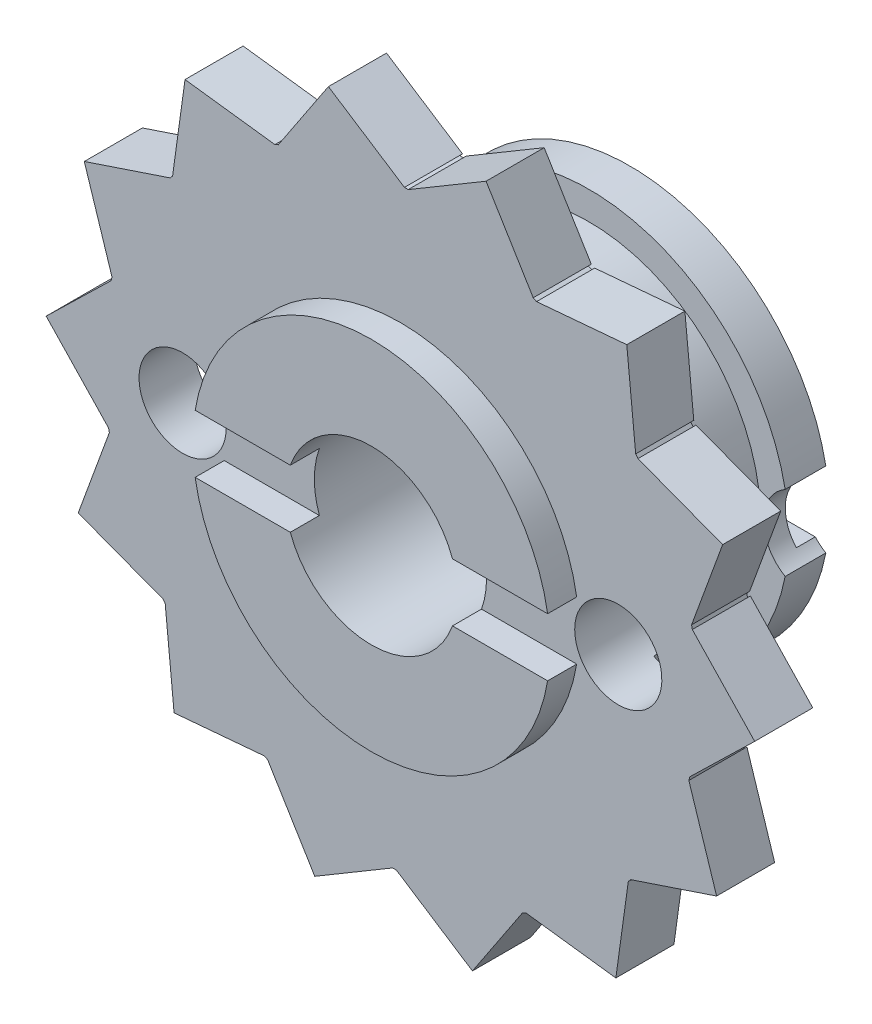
ISO-10303-21;
HEADER;
FILE_DESCRIPTION(('STEP AP214'),'2;1');
FILE_NAME('part.step','',(''),(''),'','','');
FILE_SCHEMA(('AUTOMOTIVE_DESIGN { 1 0 10303 214 1 1 1 1 }'));
ENDSEC;
DATA;
#1=APPLICATION_CONTEXT('core data for automotive mechanical design processes');
#2=APPLICATION_PROTOCOL_DEFINITION('international standard','automotive_design',2000,#1);
#3=PRODUCT_CONTEXT('',#1,'mechanical');
#4=PRODUCT('Part','Part','',(#3));
#5=PRODUCT_RELATED_PRODUCT_CATEGORY('part','',(#4));
#6=PRODUCT_DEFINITION_FORMATION('','',#4);
#7=PRODUCT_DEFINITION_CONTEXT('part definition',#1,'design');
#8=PRODUCT_DEFINITION('design','',#6,#7);
#9=PRODUCT_DEFINITION_SHAPE('','',#8);
#10=(LENGTH_UNIT() NAMED_UNIT(*) SI_UNIT(.MILLI.,.METRE.));
#11=(NAMED_UNIT(*) PLANE_ANGLE_UNIT() SI_UNIT($,.RADIAN.));
#12=(NAMED_UNIT(*) SI_UNIT($,.STERADIAN.) SOLID_ANGLE_UNIT());
#13=UNCERTAINTY_MEASURE_WITH_UNIT(LENGTH_MEASURE(1.E-05),#10,'distance_accuracy_value','');
#14=(GEOMETRIC_REPRESENTATION_CONTEXT(3) GLOBAL_UNCERTAINTY_ASSIGNED_CONTEXT((#13)) GLOBAL_UNIT_ASSIGNED_CONTEXT((#10,
#11,#12)) REPRESENTATION_CONTEXT('',''));
#15=CARTESIAN_POINT('',(0.,0.,0.));
#16=DIRECTION('',(0.,0.,1.));
#17=DIRECTION('',(1.,0.,0.));
#18=AXIS2_PLACEMENT_3D('',#15,#16,#17);
#19=CARTESIAN_POINT('',(0.,0.,1.4));
#20=DIRECTION('',(0.,0.,-1.));
#21=DIRECTION('',(-1.,0.,0.));
#22=AXIS2_PLACEMENT_3D('',#19,#20,#21);
#23=CYLINDRICAL_SURFACE('',#22,6.87);
#24=DIRECTION('',(0.,0.,1.));
#25=VECTOR('',#24,1.);
#26=CARTESIAN_POINT('',(6.74646,-1.29698784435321,2.9));
#27=LINE('',#26,#25);
#28=CARTESIAN_POINT('',(6.74646,-1.29698784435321,1.4));
#29=VERTEX_POINT('',#28);
#30=CARTESIAN_POINT('',(6.74646,-1.29698784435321,0.));
#31=VERTEX_POINT('',#30);
#32=EDGE_CURVE('E1135',#29,#31,#27,.F.);
#33=ORIENTED_EDGE('',*,*,#32,.F.);
#34=CARTESIAN_POINT('',(0.,0.,1.4));
#35=DIRECTION('',(0.,0.,-1.));
#36=DIRECTION('',(-1.,0.,0.));
#37=AXIS2_PLACEMENT_3D('',#34,#35,#36);
#38=CIRCLE('',#37,6.87);
#39=CARTESIAN_POINT('',(-6.74646,-1.29698784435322,1.4));
#40=VERTEX_POINT('',#39);
#41=EDGE_CURVE('E1403',#40,#29,#38,.F.);
#42=ORIENTED_EDGE('',*,*,#41,.F.);
#43=DIRECTION('',(0.,0.,1.));
#44=VECTOR('',#43,1.);
#45=CARTESIAN_POINT('',(-6.74646,-1.29698784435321,2.9));
#46=LINE('',#45,#44);
#47=CARTESIAN_POINT('',(-6.74646,-1.29698784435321,0.));
#48=VERTEX_POINT('',#47);
#49=EDGE_CURVE('E1143',#48,#40,#46,.T.);
#50=ORIENTED_EDGE('',*,*,#49,.F.);
#51=CARTESIAN_POINT('',(0.,0.,0.));
#52=DIRECTION('',(0.,0.,-1.));
#53=DIRECTION('',(-1.,0.,0.));
#54=AXIS2_PLACEMENT_3D('',#51,#52,#53);
#55=CIRCLE('',#54,6.87);
#56=EDGE_CURVE('E926',#31,#48,#55,.T.);
#57=ORIENTED_EDGE('',*,*,#56,.F.);
#58=EDGE_LOOP('',(#33,#42,#50,#57));
#59=FACE_BOUND('',#58,.T.);
#60=ADVANCED_FACE('F371',(#59),#23,.T.);
#61=CARTESIAN_POINT('',(0.,0.,6.));
#62=DIRECTION('',(0.,0.,-1.));
#63=DIRECTION('',(-1.,0.,0.));
#64=AXIS2_PLACEMENT_3D('',#61,#62,#63);
#65=CYLINDRICAL_SURFACE('',#64,6.95);
#66=DIRECTION('',(0.,0.,1.));
#67=VECTOR('',#66,1.);
#68=CARTESIAN_POINT('',(6.82016666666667,-1.33709634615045,2.9));
#69=LINE('',#68,#67);
#70=CARTESIAN_POINT('',(6.82016666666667,-1.33709634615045,6.));
#71=VERTEX_POINT('',#70);
#72=CARTESIAN_POINT('',(6.82016666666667,-1.33709634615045,4.55));
#73=VERTEX_POINT('',#72);
#74=EDGE_CURVE('E2459',#71,#73,#69,.F.);
#75=ORIENTED_EDGE('',*,*,#74,.F.);
#76=CARTESIAN_POINT('',(0.,0.,6.));
#77=DIRECTION('',(0.,0.,-1.));
#78=DIRECTION('',(-1.,0.,0.));
#79=AXIS2_PLACEMENT_3D('',#76,#77,#78);
#80=CIRCLE('',#79,6.95);
#81=CARTESIAN_POINT('',(-6.82016666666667,-1.33709634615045,6.));
#82=VERTEX_POINT('',#81);
#83=EDGE_CURVE('E890',#71,#82,#80,.T.);
#84=ORIENTED_EDGE('',*,*,#83,.T.);
#85=DIRECTION('',(0.,0.,1.));
#86=VECTOR('',#85,1.);
#87=CARTESIAN_POINT('',(-6.82016666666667,-1.33709634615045,2.9));
#88=LINE('',#87,#86);
#89=CARTESIAN_POINT('',(-6.82016666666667,-1.33709634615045,4.55));
#90=VERTEX_POINT('',#89);
#91=EDGE_CURVE('E1157',#90,#82,#88,.T.);
#92=ORIENTED_EDGE('',*,*,#91,.F.);
#93=CARTESIAN_POINT('',(0.,0.,4.55));
#94=DIRECTION('',(0.,0.,-1.));
#95=DIRECTION('',(-1.,0.,0.));
#96=AXIS2_PLACEMENT_3D('',#93,#94,#95);
#97=CIRCLE('',#96,6.95);
#98=EDGE_CURVE('E1176',#73,#90,#97,.T.);
#99=ORIENTED_EDGE('',*,*,#98,.F.);
#100=EDGE_LOOP('',(#75,#84,#92,#99));
#101=FACE_BOUND('',#100,.T.);
#102=ADVANCED_FACE('F1109',(#101),#65,.T.);
#103=DIRECTION('',(0.,0.,1.));
#104=VECTOR('',#103,1.);
#105=CARTESIAN_POINT('',(6.74646,1.29698784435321,2.9));
#106=LINE('',#105,#104);
#107=CARTESIAN_POINT('',(6.74646,1.29698784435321,0.));
#108=VERTEX_POINT('',#107);
#109=CARTESIAN_POINT('',(6.74646,1.29698784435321,1.4));
#110=VERTEX_POINT('',#109);
#111=EDGE_CURVE('E1130',#108,#110,#106,.T.);
#112=ORIENTED_EDGE('',*,*,#111,.F.);
#113=CARTESIAN_POINT('',(-6.74646,1.29698784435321,0.));
#114=VERTEX_POINT('',#113);
#115=EDGE_CURVE('E899',#114,#108,#55,.T.);
#116=ORIENTED_EDGE('',*,*,#115,.F.);
#117=DIRECTION('',(0.,0.,1.));
#118=VECTOR('',#117,1.);
#119=CARTESIAN_POINT('',(-6.74646,1.29698784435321,2.9));
#120=LINE('',#119,#118);
#121=CARTESIAN_POINT('',(-6.74646,1.29698784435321,1.4));
#122=VERTEX_POINT('',#121);
#123=EDGE_CURVE('E1146',#122,#114,#120,.F.);
#124=ORIENTED_EDGE('',*,*,#123,.F.);
#125=EDGE_CURVE('E1133',#110,#122,#38,.F.);
#126=ORIENTED_EDGE('',*,*,#125,.F.);
#127=EDGE_LOOP('',(#112,#116,#124,#126));
#128=FACE_BOUND('',#127,.T.);
#129=ADVANCED_FACE('F1111',(#128),#23,.T.);
#130=CARTESIAN_POINT('',(0.,0.,0.));
#131=DIRECTION('',(0.,0.,1.));
#132=DIRECTION('',(1.,0.,0.));
#133=AXIS2_PLACEMENT_3D('',#130,#131,#132);
#134=PLANE('',#133);
#135=ORIENTED_EDGE('',*,*,#115,.T.);
#136=CARTESIAN_POINT('',(7.5,0.,0.));
#137=DIRECTION('',(0.,0.,1.));
#138=DIRECTION('',(1.,0.,0.));
#139=AXIS2_PLACEMENT_3D('',#136,#137,#138);
#140=CIRCLE('',#139,1.5);
#141=CARTESIAN_POINT('',(6.38196601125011,1.,0.));
#142=VERTEX_POINT('',#141);
#143=EDGE_CURVE('E1136',#108,#142,#140,.T.);
#144=ORIENTED_EDGE('',*,*,#143,.T.);
#145=DIRECTION('',(-1.,0.,0.));
#146=VECTOR('',#145,1.);
#147=CARTESIAN_POINT('',(-15.2554213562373,1.,0.));
#148=LINE('',#147,#146);
#149=CARTESIAN_POINT('',(2.79127658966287,1.,0.));
#150=VERTEX_POINT('',#149);
#151=EDGE_CURVE('E877',#142,#150,#148,.T.);
#152=ORIENTED_EDGE('',*,*,#151,.T.);
#153=CARTESIAN_POINT('',(0.,0.,0.));
#154=DIRECTION('',(0.,0.,1.));
#155=DIRECTION('',(1.,0.,0.));
#156=AXIS2_PLACEMENT_3D('',#153,#154,#155);
#157=CIRCLE('',#156,2.965);
#158=CARTESIAN_POINT('',(-2.79127658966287,1.,0.));
#159=VERTEX_POINT('',#158);
#160=EDGE_CURVE('E898',#150,#159,#157,.T.);
#161=ORIENTED_EDGE('',*,*,#160,.T.);
#162=DIRECTION('',(-1.,0.,0.));
#163=VECTOR('',#162,1.);
#164=CARTESIAN_POINT('',(-15.2554213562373,1.,0.));
#165=LINE('',#164,#163);
#166=CARTESIAN_POINT('',(-6.38196601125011,1.,0.));
#167=VERTEX_POINT('',#166);
#168=EDGE_CURVE('E922',#159,#167,#165,.T.);
#169=ORIENTED_EDGE('',*,*,#168,.T.);
#170=CARTESIAN_POINT('',(-7.5,0.,0.));
#171=DIRECTION('',(0.,0.,1.));
#172=DIRECTION('',(1.,0.,0.));
#173=AXIS2_PLACEMENT_3D('',#170,#171,#172);
#174=CIRCLE('',#173,1.5);
#175=EDGE_CURVE('E1139',#167,#114,#174,.T.);
#176=ORIENTED_EDGE('',*,*,#175,.T.);
#177=EDGE_LOOP('',(#135,#144,#152,#161,#169,#176));
#178=FACE_BOUND('',#177,.T.);
#179=ADVANCED_FACE('F1121',(#178),#134,.F.);
#180=DIRECTION('',(-1.,0.,0.));
#181=VECTOR('',#180,1.);
#182=CARTESIAN_POINT('',(-15.2554213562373,-1.,0.));
#183=LINE('',#182,#181);
#184=CARTESIAN_POINT('',(6.38196601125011,-1.,0.));
#185=VERTEX_POINT('',#184);
#186=CARTESIAN_POINT('',(2.79127658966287,-1.,0.));
#187=VERTEX_POINT('',#186);
#188=EDGE_CURVE('E887',#185,#187,#183,.T.);
#189=ORIENTED_EDGE('',*,*,#188,.F.);
#190=CARTESIAN_POINT('',(7.5,0.,0.));
#191=DIRECTION('',(0.,0.,1.));
#192=DIRECTION('',(1.,0.,0.));
#193=AXIS2_PLACEMENT_3D('',#190,#191,#192);
#194=CIRCLE('',#193,1.5);
#195=EDGE_CURVE('E878',#185,#31,#194,.T.);
#196=ORIENTED_EDGE('',*,*,#195,.T.);
#197=ORIENTED_EDGE('',*,*,#56,.T.);
#198=CARTESIAN_POINT('',(-7.5,0.,0.));
#199=DIRECTION('',(0.,0.,1.));
#200=DIRECTION('',(1.,0.,0.));
#201=AXIS2_PLACEMENT_3D('',#198,#199,#200);
#202=CIRCLE('',#201,1.5);
#203=CARTESIAN_POINT('',(-6.38196601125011,-1.,0.));
#204=VERTEX_POINT('',#203);
#205=EDGE_CURVE('E1144',#48,#204,#202,.T.);
#206=ORIENTED_EDGE('',*,*,#205,.T.);
#207=DIRECTION('',(-1.,0.,0.));
#208=VECTOR('',#207,1.);
#209=CARTESIAN_POINT('',(-15.2554213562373,-1.,0.));
#210=LINE('',#209,#208);
#211=CARTESIAN_POINT('',(-2.79127658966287,-1.,0.));
#212=VERTEX_POINT('',#211);
#213=EDGE_CURVE('E911',#212,#204,#210,.T.);
#214=ORIENTED_EDGE('',*,*,#213,.F.);
#215=EDGE_CURVE('E928',#212,#187,#157,.T.);
#216=ORIENTED_EDGE('',*,*,#215,.T.);
#217=EDGE_LOOP('',(#189,#196,#197,#206,#214,#216));
#218=FACE_BOUND('',#217,.T.);
#219=ADVANCED_FACE('F373',(#218),#134,.F.);
#220=CARTESIAN_POINT('',(0.,0.,0.));
#221=DIRECTION('',(0.,0.,1.));
#222=DIRECTION('',(1.,0.,0.));
#223=AXIS2_PLACEMENT_3D('',#220,#221,#222);
#224=CYLINDRICAL_SURFACE('',#223,2.965);
#225=CARTESIAN_POINT('',(2.965,0.,1.825));
#226=CARTESIAN_POINT('',(2.96500229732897,0.0621266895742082,1.82499700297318));
#227=CARTESIAN_POINT('',(2.9630307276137,0.124233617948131,1.83004989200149));
#228=CARTESIAN_POINT('',(2.95536389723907,0.246583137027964,1.85003933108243));
#229=CARTESIAN_POINT('',(2.94966945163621,0.30682613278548,1.86497371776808));
#230=CARTESIAN_POINT('',(2.93516554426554,0.42366484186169,1.90411295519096));
#231=CARTESIAN_POINT('',(2.92636234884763,0.480267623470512,1.9282991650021));
#232=CARTESIAN_POINT('',(2.9065108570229,0.588605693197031,1.98515723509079));
#233=CARTESIAN_POINT('',(2.8954619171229,0.640339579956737,2.01783152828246));
#234=CARTESIAN_POINT('',(2.87169730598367,0.73979764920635,2.09226974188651));
#235=CARTESIAN_POINT('',(2.85893223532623,0.787274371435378,2.13434836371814));
#236=CARTESIAN_POINT('',(2.83340842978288,0.874699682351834,2.22573269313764));
#237=CARTESIAN_POINT('',(2.82064969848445,0.91464572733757,2.27504083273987));
#238=CARTESIAN_POINT('',(2.7959975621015,0.987504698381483,2.38196633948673));
#239=CARTESIAN_POINT('',(2.78416172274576,1.02005866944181,2.43984291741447));
#240=CARTESIAN_POINT('',(2.76346994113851,1.07485968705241,2.56077987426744));
#241=CARTESIAN_POINT('',(2.75461271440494,1.09711117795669,2.62383800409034));
#242=CARTESIAN_POINT('',(2.74141197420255,1.12968313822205,2.75049237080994));
#243=CARTESIAN_POINT('',(2.73688975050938,1.14047816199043,2.81394728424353));
#244=CARTESIAN_POINT('',(2.73235048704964,1.15131397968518,2.9419167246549));
#245=CARTESIAN_POINT('',(2.73233141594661,1.15135962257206,3.00643076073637));
#246=CARTESIAN_POINT('',(2.73664737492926,1.14105653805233,3.13023707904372));
#247=CARTESIAN_POINT('',(2.74070061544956,1.13138051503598,3.18959703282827));
#248=CARTESIAN_POINT('',(2.75223382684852,1.10302571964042,3.30577328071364));
#249=CARTESIAN_POINT('',(2.75971435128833,1.084345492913,3.36258916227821));
#250=CARTESIAN_POINT('',(2.77741924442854,1.0381651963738,3.47338477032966));
#251=CARTESIAN_POINT('',(2.78769478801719,1.01049854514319,3.52728652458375));
#252=CARTESIAN_POINT('',(2.80981639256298,0.947247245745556,3.62987188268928));
#253=CARTESIAN_POINT('',(2.82166302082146,0.911659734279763,3.67855359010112));
#254=CARTESIAN_POINT('',(2.8466358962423,0.830550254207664,3.77301993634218));
#255=CARTESIAN_POINT('',(2.85979273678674,0.784496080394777,3.81834070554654));
#256=CARTESIAN_POINT('',(2.88517146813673,0.685295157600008,3.90075898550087));
#257=CARTESIAN_POINT('',(2.89739319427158,0.632147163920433,3.93785505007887));
#258=CARTESIAN_POINT('',(2.91979871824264,0.519017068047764,4.00333105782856));
#259=CARTESIAN_POINT('',(2.92994293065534,0.45893128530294,4.03154638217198));
#260=CARTESIAN_POINT('',(2.94675405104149,0.33437357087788,4.0773115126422));
#261=CARTESIAN_POINT('',(2.95342261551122,0.269903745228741,4.09486640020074));
#262=CARTESIAN_POINT('',(2.96223442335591,0.142304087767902,4.1178971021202));
#263=CARTESIAN_POINT('',(2.96461115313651,0.0793029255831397,4.12399691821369));
#264=CARTESIAN_POINT('',(2.96530010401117,-0.0468609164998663,4.12577426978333));
#265=CARTESIAN_POINT('',(2.96361330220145,-0.110023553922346,4.1214543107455));
#266=CARTESIAN_POINT('',(2.95651824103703,-0.231954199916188,4.10298141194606));
#267=CARTESIAN_POINT('',(2.95126806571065,-0.290795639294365,4.08924592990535));
#268=CARTESIAN_POINT('',(2.93773555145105,-0.405290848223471,4.05289083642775));
#269=CARTESIAN_POINT('',(2.92945281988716,-0.460944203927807,4.03027007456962));
#270=CARTESIAN_POINT('',(2.91035630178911,-0.569362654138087,3.97605457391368));
#271=CARTESIAN_POINT('',(2.89947389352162,-0.621990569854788,3.94421043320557));
#272=CARTESIAN_POINT('',(2.8763698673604,-0.721336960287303,3.87273122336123));
#273=CARTESIAN_POINT('',(2.86414773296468,-0.768053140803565,3.83309314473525));
#274=CARTESIAN_POINT('',(2.83876119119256,-0.857289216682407,3.7442594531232));
#275=CARTESIAN_POINT('',(2.82558540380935,-0.899368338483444,3.69462316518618));
#276=CARTESIAN_POINT('',(2.80049461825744,-0.974697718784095,3.5887471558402));
#277=CARTESIAN_POINT('',(2.78857977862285,-1.00794686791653,3.53250660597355));
#278=CARTESIAN_POINT('',(2.76737733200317,-1.0647906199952,3.41436824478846));
#279=CARTESIAN_POINT('',(2.75810817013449,-1.08831792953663,3.35243451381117));
#280=CARTESIAN_POINT('',(2.74358240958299,-1.12444070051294,3.22502006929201));
#281=CARTESIAN_POINT('',(2.73832308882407,-1.1370435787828,3.1595417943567));
#282=CARTESIAN_POINT('',(2.73279037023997,-1.15027318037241,3.03170987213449));
#283=CARTESIAN_POINT('',(2.73220130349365,-1.15165827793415,2.96944780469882));
#284=CARTESIAN_POINT('',(2.735257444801,-1.14438066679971,2.84562568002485));
#285=CARTESIAN_POINT('',(2.73890218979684,-1.13571905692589,2.78406554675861));
#286=CARTESIAN_POINT('',(2.74974440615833,-1.10919946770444,2.6655893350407));
#287=CARTESIAN_POINT('',(2.75681327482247,-1.09167343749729,2.60858614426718));
#288=CARTESIAN_POINT('',(2.77362421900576,-1.0482240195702,2.4983012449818));
#289=CARTESIAN_POINT('',(2.78336699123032,-1.0222984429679,2.44502051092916));
#290=CARTESIAN_POINT('',(2.80509358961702,-0.961135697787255,2.34050556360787));
#291=CARTESIAN_POINT('',(2.81717115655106,-0.925465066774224,2.28954477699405));
#292=CARTESIAN_POINT('',(2.84190325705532,-0.846476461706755,2.1940912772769));
#293=CARTESIAN_POINT('',(2.85455797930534,-0.803155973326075,2.14960069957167));
#294=CARTESIAN_POINT('',(2.87992297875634,-0.707021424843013,2.06564355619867));
#295=CARTESIAN_POINT('',(2.89259176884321,-0.653795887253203,2.02663336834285));
#296=CARTESIAN_POINT('',(2.91577567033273,-0.541096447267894,1.95811033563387));
#297=CARTESIAN_POINT('',(2.92629035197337,-0.481621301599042,1.92859938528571));
#298=CARTESIAN_POINT('',(2.94461208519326,-0.353497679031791,1.8783656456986));
#299=CARTESIAN_POINT('',(2.95216613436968,-0.284496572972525,1.8584395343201));
#300=CARTESIAN_POINT('',(2.962357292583,-0.143653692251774,1.83176238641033));
#301=CARTESIAN_POINT('',(2.96499734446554,-0.0718136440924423,1.82500346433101));
#302=CARTESIAN_POINT('',(2.965,0.,1.825));
#303=B_SPLINE_CURVE_WITH_KNOTS('',3,(#225,#226,#227,#228,#229,#230,#231,#232,#233,#234,#235,
#236,#237,#238,#239,#240,#241,#242,#243,#244,#245,#246,#247,#248,#249,#250,#251,#252,#253,#254,
#255,#256,#257,#258,#259,#260,#261,#262,#263,#264,#265,#266,#267,#268,#269,#270,#271,#272,#273,
#274,#275,#276,#277,#278,#279,#280,#281,#282,#283,#284,#285,#286,#287,#288,#289,#290,#291,#292,
#293,#294,#295,#296,#297,#298,#299,#300,#301,#302),.UNSPECIFIED.,.T.,.F.,(4,2,2,2,2,2,2,2,2,2,2,
2,2,2,2,2,2,2,2,2,2,2,2,2,2,2,2,2,2,2,2,2,2,2,2,2,2,2,4),(0.,0.186115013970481,
0.372189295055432,0.557890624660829,0.743645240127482,0.936927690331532,1.13027531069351,
1.33161476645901,1.53286728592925,1.72541240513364,1.91787066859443,2.09786984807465,
2.27789811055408,2.46147471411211,2.64511778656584,2.84203711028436,3.03899103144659,
3.23940592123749,3.43972520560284,3.62877457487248,3.8177784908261,3.99890260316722,
4.1800501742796,4.36664504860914,4.55331211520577,4.75157172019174,4.94985622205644,
5.14949111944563,5.34899037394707,5.53487951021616,5.72074831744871,5.90012184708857,
6.07954215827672,6.26882363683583,6.45816744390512,6.6587761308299,6.85942480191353,
7.07468830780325,7.28982285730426),.UNSPECIFIED.);
#304=CARTESIAN_POINT('',(2.965,0.,1.825));
#305=VERTEX_POINT('',#304);
#306=EDGE_CURVE('E925',#305,#305,#303,.T.);
#307=ORIENTED_EDGE('',*,*,#306,.T.);
#308=EDGE_LOOP('',(#307));
#309=FACE_BOUND('',#308,.T.);
#310=CARTESIAN_POINT('',(-2.965,0.,1.825));
#311=CARTESIAN_POINT('',(-2.96500229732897,-0.0621266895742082,1.82499700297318));
#312=CARTESIAN_POINT('',(-2.9630307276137,-0.124233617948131,1.83004989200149));
#313=CARTESIAN_POINT('',(-2.95536389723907,-0.246583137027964,1.85003933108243));
#314=CARTESIAN_POINT('',(-2.94966945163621,-0.30682613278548,1.86497371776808));
#315=CARTESIAN_POINT('',(-2.93516554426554,-0.42366484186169,1.90411295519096));
#316=CARTESIAN_POINT('',(-2.92636234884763,-0.480267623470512,1.9282991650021));
#317=CARTESIAN_POINT('',(-2.9065108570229,-0.588605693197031,1.98515723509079));
#318=CARTESIAN_POINT('',(-2.8954619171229,-0.640339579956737,2.01783152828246));
#319=CARTESIAN_POINT('',(-2.87169730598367,-0.73979764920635,2.09226974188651));
#320=CARTESIAN_POINT('',(-2.85893223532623,-0.787274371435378,2.13434836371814));
#321=CARTESIAN_POINT('',(-2.83340842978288,-0.874699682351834,2.22573269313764));
#322=CARTESIAN_POINT('',(-2.82064969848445,-0.91464572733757,2.27504083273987));
#323=CARTESIAN_POINT('',(-2.7959975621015,-0.987504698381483,2.38196633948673));
#324=CARTESIAN_POINT('',(-2.78416172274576,-1.02005866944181,2.43984291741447));
#325=CARTESIAN_POINT('',(-2.76346994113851,-1.07485968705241,2.56077987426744));
#326=CARTESIAN_POINT('',(-2.75461271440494,-1.09711117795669,2.62383800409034));
#327=CARTESIAN_POINT('',(-2.74141197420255,-1.12968313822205,2.75049237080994));
#328=CARTESIAN_POINT('',(-2.73688975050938,-1.14047816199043,2.81394728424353));
#329=CARTESIAN_POINT('',(-2.73235048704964,-1.15131397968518,2.9419167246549));
#330=CARTESIAN_POINT('',(-2.73233141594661,-1.15135962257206,3.00643076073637));
#331=CARTESIAN_POINT('',(-2.73664737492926,-1.14105653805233,3.13023707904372));
#332=CARTESIAN_POINT('',(-2.74070061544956,-1.13138051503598,3.18959703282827));
#333=CARTESIAN_POINT('',(-2.75223382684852,-1.10302571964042,3.30577328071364));
#334=CARTESIAN_POINT('',(-2.75971435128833,-1.084345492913,3.36258916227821));
#335=CARTESIAN_POINT('',(-2.77741924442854,-1.0381651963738,3.47338477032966));
#336=CARTESIAN_POINT('',(-2.78769478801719,-1.01049854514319,3.52728652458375));
#337=CARTESIAN_POINT('',(-2.80981639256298,-0.947247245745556,3.62987188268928));
#338=CARTESIAN_POINT('',(-2.82166302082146,-0.911659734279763,3.67855359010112));
#339=CARTESIAN_POINT('',(-2.8466358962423,-0.830550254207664,3.77301993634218));
#340=CARTESIAN_POINT('',(-2.85979273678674,-0.784496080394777,3.81834070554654));
#341=CARTESIAN_POINT('',(-2.88517146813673,-0.685295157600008,3.90075898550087));
#342=CARTESIAN_POINT('',(-2.89739319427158,-0.632147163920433,3.93785505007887));
#343=CARTESIAN_POINT('',(-2.91979871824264,-0.519017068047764,4.00333105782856));
#344=CARTESIAN_POINT('',(-2.92994293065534,-0.45893128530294,4.03154638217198));
#345=CARTESIAN_POINT('',(-2.94675405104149,-0.33437357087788,4.0773115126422));
#346=CARTESIAN_POINT('',(-2.95342261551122,-0.269903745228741,4.09486640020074));
#347=CARTESIAN_POINT('',(-2.96223442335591,-0.142304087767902,4.1178971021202));
#348=CARTESIAN_POINT('',(-2.96461115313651,-0.0793029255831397,4.12399691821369));
#349=CARTESIAN_POINT('',(-2.96530010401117,0.0468609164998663,4.12577426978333));
#350=CARTESIAN_POINT('',(-2.96361330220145,0.110023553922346,4.1214543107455));
#351=CARTESIAN_POINT('',(-2.95651824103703,0.231954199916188,4.10298141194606));
#352=CARTESIAN_POINT('',(-2.95126806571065,0.290795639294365,4.08924592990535));
#353=CARTESIAN_POINT('',(-2.93773555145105,0.405290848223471,4.05289083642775));
#354=CARTESIAN_POINT('',(-2.92945281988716,0.460944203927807,4.03027007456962));
#355=CARTESIAN_POINT('',(-2.91035630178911,0.569362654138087,3.97605457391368));
#356=CARTESIAN_POINT('',(-2.89947389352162,0.621990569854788,3.94421043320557));
#357=CARTESIAN_POINT('',(-2.8763698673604,0.721336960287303,3.87273122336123));
#358=CARTESIAN_POINT('',(-2.86414773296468,0.768053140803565,3.83309314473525));
#359=CARTESIAN_POINT('',(-2.83876119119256,0.857289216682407,3.7442594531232));
#360=CARTESIAN_POINT('',(-2.82558540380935,0.899368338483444,3.69462316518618));
#361=CARTESIAN_POINT('',(-2.80049461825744,0.974697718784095,3.5887471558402));
#362=CARTESIAN_POINT('',(-2.78857977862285,1.00794686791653,3.53250660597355));
#363=CARTESIAN_POINT('',(-2.76737733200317,1.0647906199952,3.41436824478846));
#364=CARTESIAN_POINT('',(-2.75810817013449,1.08831792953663,3.35243451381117));
#365=CARTESIAN_POINT('',(-2.74358240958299,1.12444070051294,3.22502006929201));
#366=CARTESIAN_POINT('',(-2.73832308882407,1.1370435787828,3.1595417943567));
#367=CARTESIAN_POINT('',(-2.73279037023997,1.15027318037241,3.03170987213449));
#368=CARTESIAN_POINT('',(-2.73220130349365,1.15165827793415,2.96944780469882));
#369=CARTESIAN_POINT('',(-2.735257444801,1.14438066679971,2.84562568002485));
#370=CARTESIAN_POINT('',(-2.73890218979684,1.13571905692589,2.78406554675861));
#371=CARTESIAN_POINT('',(-2.74974440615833,1.10919946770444,2.6655893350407));
#372=CARTESIAN_POINT('',(-2.75681327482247,1.09167343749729,2.60858614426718));
#373=CARTESIAN_POINT('',(-2.77362421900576,1.0482240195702,2.4983012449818));
#374=CARTESIAN_POINT('',(-2.78336699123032,1.0222984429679,2.44502051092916));
#375=CARTESIAN_POINT('',(-2.80509358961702,0.961135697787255,2.34050556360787));
#376=CARTESIAN_POINT('',(-2.81717115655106,0.925465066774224,2.28954477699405));
#377=CARTESIAN_POINT('',(-2.84190325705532,0.846476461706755,2.1940912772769));
#378=CARTESIAN_POINT('',(-2.85455797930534,0.803155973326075,2.14960069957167));
#379=CARTESIAN_POINT('',(-2.87992297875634,0.707021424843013,2.06564355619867));
#380=CARTESIAN_POINT('',(-2.89259176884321,0.653795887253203,2.02663336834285));
#381=CARTESIAN_POINT('',(-2.91577567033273,0.541096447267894,1.95811033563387));
#382=CARTESIAN_POINT('',(-2.92629035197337,0.481621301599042,1.92859938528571));
#383=CARTESIAN_POINT('',(-2.94461208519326,0.353497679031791,1.8783656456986));
#384=CARTESIAN_POINT('',(-2.95216613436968,0.284496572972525,1.8584395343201));
#385=CARTESIAN_POINT('',(-2.962357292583,0.143653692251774,1.83176238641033));
#386=CARTESIAN_POINT('',(-2.96499734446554,0.0718136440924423,1.82500346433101));
#387=CARTESIAN_POINT('',(-2.965,0.,1.825));
#388=B_SPLINE_CURVE_WITH_KNOTS('',3,(#310,#311,#312,#313,#314,#315,#316,#317,#318,#319,#320,
#321,#322,#323,#324,#325,#326,#327,#328,#329,#330,#331,#332,#333,#334,#335,#336,#337,#338,#339,
#340,#341,#342,#343,#344,#345,#346,#347,#348,#349,#350,#351,#352,#353,#354,#355,#356,#357,#358,
#359,#360,#361,#362,#363,#364,#365,#366,#367,#368,#369,#370,#371,#372,#373,#374,#375,#376,#377,
#378,#379,#380,#381,#382,#383,#384,#385,#386,#387),.UNSPECIFIED.,.T.,.F.,(4,2,2,2,2,2,2,2,2,2,2,
2,2,2,2,2,2,2,2,2,2,2,2,2,2,2,2,2,2,2,2,2,2,2,2,2,2,2,4),(0.,0.186115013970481,
0.372189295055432,0.557890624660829,0.743645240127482,0.936927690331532,1.13027531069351,
1.33161476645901,1.53286728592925,1.72541240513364,1.91787066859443,2.09786984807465,
2.27789811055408,2.46147471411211,2.64511778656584,2.84203711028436,3.03899103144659,
3.23940592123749,3.43972520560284,3.62877457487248,3.8177784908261,3.99890260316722,
4.1800501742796,4.36664504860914,4.55331211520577,4.75157172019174,4.94985622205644,
5.14949111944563,5.34899037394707,5.53487951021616,5.72074831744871,5.90012184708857,
6.07954215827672,6.26882363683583,6.45816744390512,6.6587761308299,6.85942480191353,
7.07468830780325,7.28982285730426),.UNSPECIFIED.);
#389=CARTESIAN_POINT('',(-2.965,0.,1.825));
#390=VERTEX_POINT('',#389);
#391=EDGE_CURVE('E961',#390,#390,#388,.T.);
#392=ORIENTED_EDGE('',*,*,#391,.T.);
#393=EDGE_LOOP('',(#392));
#394=FACE_BOUND('',#393,.T.);
#395=DIRECTION('',(0.,0.,1.));
#396=VECTOR('',#395,1.);
#397=CARTESIAN_POINT('',(-2.79127658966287,1.,0.));
#398=LINE('',#397,#396);
#399=CARTESIAN_POINT('',(-2.79127658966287,1.,8.9));
#400=VERTEX_POINT('',#399);
#401=CARTESIAN_POINT('',(-2.79127658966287,1.,7.9));
#402=VERTEX_POINT('',#401);
#403=EDGE_CURVE('E1200',#400,#402,#398,.F.);
#404=ORIENTED_EDGE('',*,*,#403,.T.);
#405=CARTESIAN_POINT('',(0.,0.,7.9));
#406=DIRECTION('',(0.,0.,1.));
#407=DIRECTION('',(1.,0.,0.));
#408=AXIS2_PLACEMENT_3D('',#405,#406,#407);
#409=CIRCLE('',#408,2.965);
#410=CARTESIAN_POINT('',(-2.79127658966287,-1.,7.9));
#411=VERTEX_POINT('',#410);
#412=EDGE_CURVE('E1203',#402,#411,#409,.T.);
#413=ORIENTED_EDGE('',*,*,#412,.T.);
#414=DIRECTION('',(0.,0.,1.));
#415=VECTOR('',#414,1.);
#416=CARTESIAN_POINT('',(-2.79127658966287,-1.,0.));
#417=LINE('',#416,#415);
#418=CARTESIAN_POINT('',(-2.79127658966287,-1.,8.9));
#419=VERTEX_POINT('',#418);
#420=EDGE_CURVE('E1214',#419,#411,#417,.F.);
#421=ORIENTED_EDGE('',*,*,#420,.F.);
#422=CARTESIAN_POINT('',(0.,0.,8.9));
#423=DIRECTION('',(0.,0.,1.));
#424=DIRECTION('',(1.,0.,0.));
#425=AXIS2_PLACEMENT_3D('',#422,#423,#424);
#426=CIRCLE('',#425,2.965);
#427=CARTESIAN_POINT('',(2.79127658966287,-1.,8.9));
#428=VERTEX_POINT('',#427);
#429=EDGE_CURVE('E1208',#419,#428,#426,.T.);
#430=ORIENTED_EDGE('',*,*,#429,.T.);
#431=DIRECTION('',(0.,0.,1.));
#432=VECTOR('',#431,1.);
#433=CARTESIAN_POINT('',(2.79127658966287,-1.,0.));
#434=LINE('',#433,#432);
#435=CARTESIAN_POINT('',(2.79127658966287,-1.,7.9));
#436=VERTEX_POINT('',#435);
#437=EDGE_CURVE('E1219',#436,#428,#434,.T.);
#438=ORIENTED_EDGE('',*,*,#437,.F.);
#439=CARTESIAN_POINT('',(2.79127658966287,1.,7.9));
#440=VERTEX_POINT('',#439);
#441=EDGE_CURVE('E1209',#436,#440,#409,.T.);
#442=ORIENTED_EDGE('',*,*,#441,.T.);
#443=DIRECTION('',(0.,0.,1.));
#444=VECTOR('',#443,1.);
#445=CARTESIAN_POINT('',(2.79127658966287,1.,0.));
#446=LINE('',#445,#444);
#447=CARTESIAN_POINT('',(2.79127658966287,1.,8.9));
#448=VERTEX_POINT('',#447);
#449=EDGE_CURVE('E1224',#440,#448,#446,.T.);
#450=ORIENTED_EDGE('',*,*,#449,.T.);
#451=EDGE_CURVE('E916',#448,#400,#426,.T.);
#452=ORIENTED_EDGE('',*,*,#451,.T.);
#453=EDGE_LOOP('',(#404,#413,#421,#430,#438,#442,#450,#452));
#454=FACE_BOUND('',#453,.T.);
#455=ORIENTED_EDGE('',*,*,#215,.F.);
#456=DIRECTION('',(0.,0.,-1.));
#457=VECTOR('',#456,1.);
#458=CARTESIAN_POINT('',(-2.79127658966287,-1.,0.65));
#459=LINE('',#458,#457);
#460=CARTESIAN_POINT('',(-2.79127658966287,-1.,0.65));
#461=VERTEX_POINT('',#460);
#462=EDGE_CURVE('E917',#461,#212,#459,.T.);
#463=ORIENTED_EDGE('',*,*,#462,.F.);
#464=CARTESIAN_POINT('',(0.,0.,0.65));
#465=DIRECTION('',(0.,0.,-1.));
#466=DIRECTION('',(-1.,0.,0.));
#467=AXIS2_PLACEMENT_3D('',#464,#465,#466);
#468=CIRCLE('',#467,2.965);
#469=CARTESIAN_POINT('',(-2.79127658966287,1.,0.65));
#470=VERTEX_POINT('',#469);
#471=EDGE_CURVE('E905',#470,#461,#468,.F.);
#472=ORIENTED_EDGE('',*,*,#471,.F.);
#473=DIRECTION('',(0.,0.,-1.));
#474=VECTOR('',#473,1.);
#475=CARTESIAN_POINT('',(-2.79127658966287,1.,0.65));
#476=LINE('',#475,#474);
#477=EDGE_CURVE('E912',#470,#159,#476,.T.);
#478=ORIENTED_EDGE('',*,*,#477,.T.);
#479=ORIENTED_EDGE('',*,*,#160,.F.);
#480=DIRECTION('',(0.,0.,-1.));
#481=VECTOR('',#480,1.);
#482=CARTESIAN_POINT('',(2.79127658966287,1.,0.65));
#483=LINE('',#482,#481);
#484=CARTESIAN_POINT('',(2.79127658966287,1.,0.65));
#485=VERTEX_POINT('',#484);
#486=EDGE_CURVE('E884',#485,#150,#483,.T.);
#487=ORIENTED_EDGE('',*,*,#486,.F.);
#488=CARTESIAN_POINT('',(0.,0.,0.65));
#489=DIRECTION('',(0.,0.,-1.));
#490=DIRECTION('',(-1.,0.,0.));
#491=AXIS2_PLACEMENT_3D('',#488,#489,#490);
#492=CIRCLE('',#491,2.965);
#493=CARTESIAN_POINT('',(2.79127658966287,-1.,0.65));
#494=VERTEX_POINT('',#493);
#495=EDGE_CURVE('E882',#494,#485,#492,.F.);
#496=ORIENTED_EDGE('',*,*,#495,.F.);
#497=DIRECTION('',(0.,0.,-1.));
#498=VECTOR('',#497,1.);
#499=CARTESIAN_POINT('',(2.79127658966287,-1.,0.65));
#500=LINE('',#499,#498);
#501=EDGE_CURVE('E915',#494,#187,#500,.T.);
#502=ORIENTED_EDGE('',*,*,#501,.T.);
#503=EDGE_LOOP('',(#455,#463,#472,#478,#479,#487,#496,#502));
#504=FACE_BOUND('',#503,.T.);
#505=ADVANCED_FACE('F971',(#309,#394,#454,#504),#224,.F.);
#506=CARTESIAN_POINT('',(0.,0.,8.9));
#507=DIRECTION('',(0.,0.,-1.));
#508=DIRECTION('',(-1.,0.,0.));
#509=AXIS2_PLACEMENT_3D('',#506,#507,#508);
#510=CYLINDRICAL_SURFACE('',#509,10.25);
#511=CARTESIAN_POINT('',(0.,0.,6.));
#512=DIRECTION('',(0.,0.,-1.));
#513=DIRECTION('',(-1.,0.,0.));
#514=AXIS2_PLACEMENT_3D('',#511,#512,#513);
#515=CIRCLE('',#514,10.25);
#516=CARTESIAN_POINT('',(-9.96133155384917,2.41544481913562,6.));
#517=VERTEX_POINT('',#516);
#518=CARTESIAN_POINT('',(-9.93031489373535,2.53995002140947,6.));
#519=VERTEX_POINT('',#518);
#520=EDGE_CURVE('E1497',#517,#519,#515,.T.);
#521=ORIENTED_EDGE('',*,*,#520,.F.);
#522=DIRECTION('',(0.,0.,-1.));
#523=VECTOR('',#522,1.);
#524=CARTESIAN_POINT('',(-9.96133155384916,2.41544481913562,15.9));
#525=LINE('',#524,#523);
#526=CARTESIAN_POINT('',(-9.96133155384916,2.41544481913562,7.9));
#527=VERTEX_POINT('',#526);
#528=EDGE_CURVE('E1475',#527,#517,#525,.T.);
#529=ORIENTED_EDGE('',*,*,#528,.F.);
#530=CARTESIAN_POINT('',(0.,0.,7.9));
#531=DIRECTION('',(0.,0.,1.));
#532=DIRECTION('',(1.,0.,0.));
#533=AXIS2_PLACEMENT_3D('',#530,#531,#532);
#534=CIRCLE('',#533,10.25);
#535=CARTESIAN_POINT('',(-9.93031489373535,2.53995002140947,7.9));
#536=VERTEX_POINT('',#535);
#537=EDGE_CURVE('E1187',#527,#536,#534,.F.);
#538=ORIENTED_EDGE('',*,*,#537,.T.);
#539=DIRECTION('',(0.,0.,-1.));
#540=VECTOR('',#539,1.);
#541=CARTESIAN_POINT('',(-9.93031489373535,2.53995002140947,15.9));
#542=LINE('',#541,#540);
#543=EDGE_CURVE('E1593',#536,#519,#542,.T.);
#544=ORIENTED_EDGE('',*,*,#543,.T.);
#545=EDGE_LOOP('',(#521,#529,#538,#544));
#546=FACE_BOUND('',#545,.T.);
#547=ADVANCED_FACE('F954',(#546),#510,.T.);
#548=CARTESIAN_POINT('',(-7.92682738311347,6.49830036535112,6.));
#549=VERTEX_POINT('',#548);
#550=CARTESIAN_POINT('',(-7.84486155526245,6.59701805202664,6.));
#551=VERTEX_POINT('',#550);
#552=EDGE_CURVE('E1506',#549,#551,#515,.T.);
#553=ORIENTED_EDGE('',*,*,#552,.F.);
#554=DIRECTION('',(0.,0.,-1.));
#555=VECTOR('',#554,1.);
#556=CARTESIAN_POINT('',(-7.92682738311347,6.49830036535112,15.9));
#557=LINE('',#556,#555);
#558=CARTESIAN_POINT('',(-7.92682738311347,6.49830036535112,7.9));
#559=VERTEX_POINT('',#558);
#560=EDGE_CURVE('E1597',#559,#549,#557,.T.);
#561=ORIENTED_EDGE('',*,*,#560,.F.);
#562=CARTESIAN_POINT('',(0.,0.,7.9));
#563=DIRECTION('',(0.,0.,1.));
#564=DIRECTION('',(1.,0.,0.));
#565=AXIS2_PLACEMENT_3D('',#562,#563,#564);
#566=CIRCLE('',#565,10.25);
#567=CARTESIAN_POINT('',(-7.84486155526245,6.59701805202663,7.9));
#568=VERTEX_POINT('',#567);
#569=EDGE_CURVE('E1588',#559,#568,#566,.F.);
#570=ORIENTED_EDGE('',*,*,#569,.T.);
#571=DIRECTION('',(0.,0.,-1.));
#572=VECTOR('',#571,1.);
#573=CARTESIAN_POINT('',(-7.84486155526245,6.59701805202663,15.9));
#574=LINE('',#573,#572);
#575=EDGE_CURVE('E1583',#568,#551,#574,.T.);
#576=ORIENTED_EDGE('',*,*,#575,.T.);
#577=EDGE_LOOP('',(#553,#561,#570,#576));
#578=FACE_BOUND('',#577,.T.);
#579=ADVANCED_FACE('F1586',(#578),#510,.T.);
#580=CARTESIAN_POINT('',(-4.32231783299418,9.29408782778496,6.));
#581=VERTEX_POINT('',#580);
#582=CARTESIAN_POINT('',(-4.20563717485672,9.34746575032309,6.));
#583=VERTEX_POINT('',#582);
#584=EDGE_CURVE('E1567',#581,#583,#515,.T.);
#585=ORIENTED_EDGE('',*,*,#584,.F.);
#586=DIRECTION('',(0.,0.,-1.));
#587=VECTOR('',#586,1.);
#588=CARTESIAN_POINT('',(-4.32231783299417,9.29408782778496,15.9));
#589=LINE('',#588,#587);
#590=CARTESIAN_POINT('',(-4.32231783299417,9.29408782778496,7.9));
#591=VERTEX_POINT('',#590);
#592=EDGE_CURVE('E1488',#591,#581,#589,.T.);
#593=ORIENTED_EDGE('',*,*,#592,.F.);
#594=CARTESIAN_POINT('',(0.,0.,7.9));
#595=DIRECTION('',(0.,0.,1.));
#596=DIRECTION('',(1.,0.,0.));
#597=AXIS2_PLACEMENT_3D('',#594,#595,#596);
#598=CIRCLE('',#597,10.25);
#599=CARTESIAN_POINT('',(-4.20563717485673,9.34746575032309,7.9));
#600=VERTEX_POINT('',#599);
#601=EDGE_CURVE('E1589',#591,#600,#598,.F.);
#602=ORIENTED_EDGE('',*,*,#601,.T.);
#603=DIRECTION('',(0.,0.,-1.));
#604=VECTOR('',#603,1.);
#605=CARTESIAN_POINT('',(-4.20563717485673,9.34746575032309,15.9));
#606=LINE('',#605,#604);
#607=EDGE_CURVE('E1591',#600,#583,#606,.T.);
#608=ORIENTED_EDGE('',*,*,#607,.T.);
#609=EDGE_LOOP('',(#585,#593,#602,#608));
#610=FACE_BOUND('',#609,.T.);
#611=ADVANCED_FACE('F1794',(#610),#510,.T.);
#612=CARTESIAN_POINT('',(0.138279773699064,10.2490672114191,6.));
#613=VERTEX_POINT('',#612);
#614=CARTESIAN_POINT('',(0.266565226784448,10.2465332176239,6.));
#615=VERTEX_POINT('',#614);
#616=EDGE_CURVE('E1562',#613,#615,#515,.T.);
#617=ORIENTED_EDGE('',*,*,#616,.F.);
#618=DIRECTION('',(0.,0.,-1.));
#619=VECTOR('',#618,1.);
#620=CARTESIAN_POINT('',(0.138279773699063,10.2490672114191,15.9));
#621=LINE('',#620,#619);
#622=CARTESIAN_POINT('',(0.138279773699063,10.2490672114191,7.9));
#623=VERTEX_POINT('',#622);
#624=EDGE_CURVE('E1377',#623,#613,#621,.T.);
#625=ORIENTED_EDGE('',*,*,#624,.F.);
#626=CARTESIAN_POINT('',(0.,0.,7.9));
#627=DIRECTION('',(0.,0.,1.));
#628=DIRECTION('',(1.,0.,0.));
#629=AXIS2_PLACEMENT_3D('',#626,#627,#628);
#630=CIRCLE('',#629,10.25);
#631=CARTESIAN_POINT('',(0.266565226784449,10.2465332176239,7.9));
#632=VERTEX_POINT('',#631);
#633=EDGE_CURVE('E1611',#623,#632,#630,.F.);
#634=ORIENTED_EDGE('',*,*,#633,.T.);
#635=DIRECTION('',(0.,0.,-1.));
#636=VECTOR('',#635,1.);
#637=CARTESIAN_POINT('',(0.266565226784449,10.2465332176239,15.9));
#638=LINE('',#637,#636);
#639=EDGE_CURVE('E1386',#632,#615,#638,.T.);
#640=ORIENTED_EDGE('',*,*,#639,.T.);
#641=EDGE_LOOP('',(#617,#625,#634,#640));
#642=FACE_BOUND('',#641,.T.);
#643=ADVANCED_FACE('F2593',(#642),#510,.T.);
#644=CARTESIAN_POINT('',(4.57148937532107,9.17409313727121,6.));
#645=VERTEX_POINT('',#644);
#646=CARTESIAN_POINT('',(4.685971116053,9.11614911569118,6.));
#647=VERTEX_POINT('',#646);
#648=EDGE_CURVE('E1557',#645,#647,#515,.T.);
#649=ORIENTED_EDGE('',*,*,#648,.F.);
#650=DIRECTION('',(0.,0.,-1.));
#651=VECTOR('',#650,1.);
#652=CARTESIAN_POINT('',(4.57148937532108,9.1740931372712,15.9));
#653=LINE('',#652,#651);
#654=CARTESIAN_POINT('',(4.57148937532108,9.1740931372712,7.9));
#655=VERTEX_POINT('',#654);
#656=EDGE_CURVE('E1379',#655,#645,#653,.T.);
#657=ORIENTED_EDGE('',*,*,#656,.F.);
#658=CARTESIAN_POINT('',(0.,0.,7.9));
#659=DIRECTION('',(0.,0.,1.));
#660=DIRECTION('',(1.,0.,0.));
#661=AXIS2_PLACEMENT_3D('',#658,#659,#660);
#662=CIRCLE('',#661,10.25);
#663=CARTESIAN_POINT('',(4.685971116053,9.11614911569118,7.9));
#664=VERTEX_POINT('',#663);
#665=EDGE_CURVE('E1394',#655,#664,#662,.F.);
#666=ORIENTED_EDGE('',*,*,#665,.T.);
#667=DIRECTION('',(0.,0.,-1.));
#668=VECTOR('',#667,1.);
#669=CARTESIAN_POINT('',(4.685971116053,9.11614911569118,15.9));
#670=LINE('',#669,#668);
#671=EDGE_CURVE('E1390',#664,#647,#670,.T.);
#672=ORIENTED_EDGE('',*,*,#671,.T.);
#673=EDGE_LOOP('',(#649,#657,#666,#672));
#674=FACE_BOUND('',#673,.T.);
#675=ADVANCED_FACE('F2583',(#674),#510,.T.);
#676=CARTESIAN_POINT('',(8.09925944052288,6.28207740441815,6.));
#677=VERTEX_POINT('',#676);
#678=CARTESIAN_POINT('',(8.17726295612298,6.18019987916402,6.));
#679=VERTEX_POINT('',#678);
#680=EDGE_CURVE('E1551',#677,#679,#515,.T.);
#681=ORIENTED_EDGE('',*,*,#680,.F.);
#682=DIRECTION('',(0.,0.,-1.));
#683=VECTOR('',#682,1.);
#684=CARTESIAN_POINT('',(8.09925944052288,6.28207740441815,15.9));
#685=LINE('',#684,#683);
#686=CARTESIAN_POINT('',(8.09925944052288,6.28207740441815,7.9));
#687=VERTEX_POINT('',#686);
#688=EDGE_CURVE('E1852',#687,#677,#685,.T.);
#689=ORIENTED_EDGE('',*,*,#688,.F.);
#690=CARTESIAN_POINT('',(0.,0.,7.9));
#691=DIRECTION('',(0.,0.,1.));
#692=DIRECTION('',(1.,0.,0.));
#693=AXIS2_PLACEMENT_3D('',#690,#691,#692);
#694=CIRCLE('',#693,10.25);
#695=CARTESIAN_POINT('',(8.17726295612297,6.18019987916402,7.9));
#696=VERTEX_POINT('',#695);
#697=EDGE_CURVE('E1393',#687,#696,#694,.F.);
#698=ORIENTED_EDGE('',*,*,#697,.T.);
#699=DIRECTION('',(0.,0.,-1.));
#700=VECTOR('',#699,1.);
#701=CARTESIAN_POINT('',(8.17726295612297,6.18019987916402,15.9));
#702=LINE('',#701,#700);
#703=EDGE_CURVE('E1847',#696,#679,#702,.T.);
#704=ORIENTED_EDGE('',*,*,#703,.T.);
#705=EDGE_LOOP('',(#681,#689,#698,#704));
#706=FACE_BOUND('',#705,.T.);
#707=ADVANCED_FACE('F1868',(#706),#510,.T.);
#708=CARTESIAN_POINT('',(10.0228718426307,2.14581919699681,6.));
#709=VERTEX_POINT('',#708);
#710=CARTESIAN_POINT('',(10.0489475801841,2.020186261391,6.));
#711=VERTEX_POINT('',#710);
#712=EDGE_CURVE('E1546',#709,#711,#515,.T.);
#713=ORIENTED_EDGE('',*,*,#712,.F.);
#714=DIRECTION('',(0.,0.,-1.));
#715=VECTOR('',#714,1.);
#716=CARTESIAN_POINT('',(10.0228718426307,2.14581919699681,15.9));
#717=LINE('',#716,#715);
#718=CARTESIAN_POINT('',(10.0228718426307,2.14581919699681,7.9));
#719=VERTEX_POINT('',#718);
#720=EDGE_CURVE('E1419',#719,#709,#717,.T.);
#721=ORIENTED_EDGE('',*,*,#720,.F.);
#722=CARTESIAN_POINT('',(0.,0.,7.9));
#723=DIRECTION('',(0.,0.,1.));
#724=DIRECTION('',(1.,0.,0.));
#725=AXIS2_PLACEMENT_3D('',#722,#723,#724);
#726=CIRCLE('',#725,10.25);
#727=CARTESIAN_POINT('',(10.0489475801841,2.020186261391,7.9));
#728=VERTEX_POINT('',#727);
#729=EDGE_CURVE('E1681',#719,#728,#726,.F.);
#730=ORIENTED_EDGE('',*,*,#729,.T.);
#731=DIRECTION('',(0.,0.,-1.));
#732=VECTOR('',#731,1.);
#733=CARTESIAN_POINT('',(10.0489475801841,2.020186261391,15.9));
#734=LINE('',#733,#732);
#735=EDGE_CURVE('E1677',#728,#711,#734,.T.);
#736=ORIENTED_EDGE('',*,*,#735,.T.);
#737=EDGE_LOOP('',(#713,#721,#730,#736));
#738=FACE_BOUND('',#737,.T.);
#739=ADVANCED_FACE('F1845',(#738),#510,.T.);
#740=CARTESIAN_POINT('',(9.96133155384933,-2.41544481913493,6.));
#741=VERTEX_POINT('',#740);
#742=CARTESIAN_POINT('',(9.93031489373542,-2.53995002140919,6.));
#743=VERTEX_POINT('',#742);
#744=EDGE_CURVE('E1540',#741,#743,#515,.T.);
#745=ORIENTED_EDGE('',*,*,#744,.F.);
#746=DIRECTION('',(0.,0.,-1.));
#747=VECTOR('',#746,1.);
#748=CARTESIAN_POINT('',(9.96133155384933,-2.41544481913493,15.9));
#749=LINE('',#748,#747);
#750=CARTESIAN_POINT('',(9.96133155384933,-2.41544481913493,7.9));
#751=VERTEX_POINT('',#750);
#752=EDGE_CURVE('E1696',#751,#741,#749,.T.);
#753=ORIENTED_EDGE('',*,*,#752,.F.);
#754=CARTESIAN_POINT('',(0.,0.,7.9));
#755=DIRECTION('',(0.,0.,1.));
#756=DIRECTION('',(1.,0.,0.));
#757=AXIS2_PLACEMENT_3D('',#754,#755,#756);
#758=CIRCLE('',#757,10.25);
#759=CARTESIAN_POINT('',(9.93031489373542,-2.53995002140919,7.9));
#760=VERTEX_POINT('',#759);
#761=EDGE_CURVE('E1680',#751,#760,#758,.F.);
#762=ORIENTED_EDGE('',*,*,#761,.T.);
#763=DIRECTION('',(0.,0.,-1.));
#764=VECTOR('',#763,1.);
#765=CARTESIAN_POINT('',(9.93031489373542,-2.53995002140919,15.9));
#766=LINE('',#765,#764);
#767=EDGE_CURVE('E1685',#760,#743,#766,.T.);
#768=ORIENTED_EDGE('',*,*,#767,.T.);
#769=EDGE_LOOP('',(#745,#753,#762,#768));
#770=FACE_BOUND('',#769,.T.);
#771=ADVANCED_FACE('F1839',(#770),#510,.T.);
#772=CARTESIAN_POINT('',(7.92682738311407,-6.49830036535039,6.));
#773=VERTEX_POINT('',#772);
#774=CARTESIAN_POINT('',(7.84486155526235,-6.59701805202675,6.));
#775=VERTEX_POINT('',#774);
#776=EDGE_CURVE('E1535',#773,#775,#515,.T.);
#777=ORIENTED_EDGE('',*,*,#776,.F.);
#778=DIRECTION('',(0.,0.,-1.));
#779=VECTOR('',#778,1.);
#780=CARTESIAN_POINT('',(7.92682738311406,-6.49830036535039,15.9));
#781=LINE('',#780,#779);
#782=CARTESIAN_POINT('',(7.92682738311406,-6.49830036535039,7.9));
#783=VERTEX_POINT('',#782);
#784=EDGE_CURVE('E1433',#783,#773,#781,.T.);
#785=ORIENTED_EDGE('',*,*,#784,.F.);
#786=CARTESIAN_POINT('',(0.,0.,7.9));
#787=DIRECTION('',(0.,0.,1.));
#788=DIRECTION('',(1.,0.,0.));
#789=AXIS2_PLACEMENT_3D('',#786,#787,#788);
#790=CIRCLE('',#789,10.25);
#791=CARTESIAN_POINT('',(7.84486155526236,-6.59701805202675,7.9));
#792=VERTEX_POINT('',#791);
#793=EDGE_CURVE('E1702',#783,#792,#790,.F.);
#794=ORIENTED_EDGE('',*,*,#793,.T.);
#795=DIRECTION('',(0.,0.,-1.));
#796=VECTOR('',#795,1.);
#797=CARTESIAN_POINT('',(7.84486155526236,-6.59701805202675,15.9));
#798=LINE('',#797,#796);
#799=EDGE_CURVE('E1704',#792,#775,#798,.T.);
#800=ORIENTED_EDGE('',*,*,#799,.T.);
#801=EDGE_LOOP('',(#777,#785,#794,#800));
#802=FACE_BOUND('',#801,.T.);
#803=ADVANCED_FACE('F1832',(#802),#510,.T.);
#804=CARTESIAN_POINT('',(4.32231783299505,-9.29408782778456,6.));
#805=VERTEX_POINT('',#804);
#806=CARTESIAN_POINT('',(4.20563717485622,-9.34746575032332,6.));
#807=VERTEX_POINT('',#806);
#808=EDGE_CURVE('E1529',#805,#807,#515,.T.);
#809=ORIENTED_EDGE('',*,*,#808,.F.);
#810=DIRECTION('',(0.,0.,-1.));
#811=VECTOR('',#810,1.);
#812=CARTESIAN_POINT('',(4.32231783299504,-9.29408782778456,15.9));
#813=LINE('',#812,#811);
#814=CARTESIAN_POINT('',(4.32231783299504,-9.29408782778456,7.9));
#815=VERTEX_POINT('',#814);
#816=EDGE_CURVE('E1729',#815,#805,#813,.T.);
#817=ORIENTED_EDGE('',*,*,#816,.F.);
#818=CARTESIAN_POINT('',(0.,0.,7.9));
#819=DIRECTION('',(0.,0.,1.));
#820=DIRECTION('',(1.,0.,0.));
#821=AXIS2_PLACEMENT_3D('',#818,#819,#820);
#822=CIRCLE('',#821,10.25);
#823=CARTESIAN_POINT('',(4.20563717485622,-9.34746575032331,7.9));
#824=VERTEX_POINT('',#823);
#825=EDGE_CURVE('E1716',#815,#824,#822,.F.);
#826=ORIENTED_EDGE('',*,*,#825,.T.);
#827=DIRECTION('',(0.,0.,-1.));
#828=VECTOR('',#827,1.);
#829=CARTESIAN_POINT('',(4.20563717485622,-9.34746575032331,15.9));
#830=LINE('',#829,#828);
#831=EDGE_CURVE('E1720',#824,#807,#830,.T.);
#832=ORIENTED_EDGE('',*,*,#831,.T.);
#833=EDGE_LOOP('',(#809,#817,#826,#832));
#834=FACE_BOUND('',#833,.T.);
#835=ADVANCED_FACE('F1826',(#834),#510,.T.);
#836=CARTESIAN_POINT('',(-0.138279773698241,-10.2490672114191,6.));
#837=VERTEX_POINT('',#836);
#838=CARTESIAN_POINT('',(-0.266565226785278,-10.2465332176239,6.));
#839=VERTEX_POINT('',#838);
#840=EDGE_CURVE('E1524',#837,#839,#515,.T.);
#841=ORIENTED_EDGE('',*,*,#840,.F.);
#842=DIRECTION('',(0.,0.,-1.));
#843=VECTOR('',#842,1.);
#844=CARTESIAN_POINT('',(-0.138279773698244,-10.2490672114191,15.9));
#845=LINE('',#844,#843);
#846=CARTESIAN_POINT('',(-0.138279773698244,-10.2490672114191,7.9));
#847=VERTEX_POINT('',#846);
#848=EDGE_CURVE('E1447',#847,#837,#845,.T.);
#849=ORIENTED_EDGE('',*,*,#848,.F.);
#850=CARTESIAN_POINT('',(0.,0.,7.9));
#851=DIRECTION('',(0.,0.,1.));
#852=DIRECTION('',(1.,0.,0.));
#853=AXIS2_PLACEMENT_3D('',#850,#851,#852);
#854=CIRCLE('',#853,10.25);
#855=CARTESIAN_POINT('',(-0.266565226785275,-10.2465332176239,7.9));
#856=VERTEX_POINT('',#855);
#857=EDGE_CURVE('E1735',#847,#856,#854,.F.);
#858=ORIENTED_EDGE('',*,*,#857,.T.);
#859=DIRECTION('',(0.,0.,-1.));
#860=VECTOR('',#859,1.);
#861=CARTESIAN_POINT('',(-0.266565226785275,-10.2465332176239,15.9));
#862=LINE('',#861,#860);
#863=EDGE_CURVE('E1662',#856,#839,#862,.T.);
#864=ORIENTED_EDGE('',*,*,#863,.T.);
#865=EDGE_LOOP('',(#841,#849,#858,#864));
#866=FACE_BOUND('',#865,.T.);
#867=ADVANCED_FACE('F1805',(#866),#510,.T.);
#868=CARTESIAN_POINT('',(-4.57148937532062,-9.17409313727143,6.));
#869=VERTEX_POINT('',#868);
#870=CARTESIAN_POINT('',(-4.68597111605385,-9.11614911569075,6.));
#871=VERTEX_POINT('',#870);
#872=EDGE_CURVE('E1518',#869,#871,#515,.T.);
#873=ORIENTED_EDGE('',*,*,#872,.F.);
#874=DIRECTION('',(0.,0.,-1.));
#875=VECTOR('',#874,1.);
#876=CARTESIAN_POINT('',(-4.57148937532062,-9.17409313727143,15.9));
#877=LINE('',#876,#875);
#878=CARTESIAN_POINT('',(-4.57148937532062,-9.17409313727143,7.9));
#879=VERTEX_POINT('',#878);
#880=EDGE_CURVE('E1742',#879,#869,#877,.T.);
#881=ORIENTED_EDGE('',*,*,#880,.F.);
#882=CARTESIAN_POINT('',(0.,0.,7.9));
#883=DIRECTION('',(0.,0.,1.));
#884=DIRECTION('',(1.,0.,0.));
#885=AXIS2_PLACEMENT_3D('',#882,#883,#884);
#886=CIRCLE('',#885,10.25);
#887=CARTESIAN_POINT('',(-4.68597111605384,-9.11614911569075,7.9));
#888=VERTEX_POINT('',#887);
#889=EDGE_CURVE('E1660',#879,#888,#886,.F.);
#890=ORIENTED_EDGE('',*,*,#889,.T.);
#891=DIRECTION('',(0.,0.,-1.));
#892=VECTOR('',#891,1.);
#893=CARTESIAN_POINT('',(-4.68597111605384,-9.11614911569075,15.9));
#894=LINE('',#893,#892);
#895=EDGE_CURVE('E1659',#888,#871,#894,.T.);
#896=ORIENTED_EDGE('',*,*,#895,.T.);
#897=EDGE_LOOP('',(#873,#881,#890,#896));
#898=FACE_BOUND('',#897,.T.);
#899=ADVANCED_FACE('F1800',(#898),#510,.T.);
#900=CARTESIAN_POINT('',(-8.09925944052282,-6.28207740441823,6.));
#901=VERTEX_POINT('',#900);
#902=CARTESIAN_POINT('',(-8.17726295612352,-6.1801998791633,6.));
#903=VERTEX_POINT('',#902);
#904=EDGE_CURVE('E1513',#901,#903,#515,.T.);
#905=ORIENTED_EDGE('',*,*,#904,.F.);
#906=DIRECTION('',(0.,0.,-1.));
#907=VECTOR('',#906,1.);
#908=CARTESIAN_POINT('',(-8.09925944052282,-6.28207740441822,15.9));
#909=LINE('',#908,#907);
#910=CARTESIAN_POINT('',(-8.09925944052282,-6.28207740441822,7.9));
#911=VERTEX_POINT('',#910);
#912=EDGE_CURVE('E1461',#911,#901,#909,.T.);
#913=ORIENTED_EDGE('',*,*,#912,.F.);
#914=CARTESIAN_POINT('',(0.,0.,7.9));
#915=DIRECTION('',(0.,0.,1.));
#916=DIRECTION('',(1.,0.,0.));
#917=AXIS2_PLACEMENT_3D('',#914,#915,#916);
#918=CIRCLE('',#917,10.25);
#919=CARTESIAN_POINT('',(-8.17726295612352,-6.18019987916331,7.9));
#920=VERTEX_POINT('',#919);
#921=EDGE_CURVE('E1657',#911,#920,#918,.F.);
#922=ORIENTED_EDGE('',*,*,#921,.T.);
#923=DIRECTION('',(0.,0.,-1.));
#924=VECTOR('',#923,1.);
#925=CARTESIAN_POINT('',(-8.17726295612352,-6.18019987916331,15.9));
#926=LINE('',#925,#924);
#927=EDGE_CURVE('E1656',#920,#903,#926,.T.);
#928=ORIENTED_EDGE('',*,*,#927,.T.);
#929=EDGE_LOOP('',(#905,#913,#922,#928));
#930=FACE_BOUND('',#929,.T.);
#931=ADVANCED_FACE('F1796',(#930),#510,.T.);
#932=CARTESIAN_POINT('',(-10.0228718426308,-2.14581919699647,6.));
#933=VERTEX_POINT('',#932);
#934=CARTESIAN_POINT('',(-10.0489475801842,-2.02018626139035,6.));
#935=VERTEX_POINT('',#934);
#936=EDGE_CURVE('E1507',#933,#935,#515,.T.);
#937=ORIENTED_EDGE('',*,*,#936,.F.);
#938=DIRECTION('',(0.,0.,-1.));
#939=VECTOR('',#938,1.);
#940=CARTESIAN_POINT('',(-10.0228718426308,-2.14581919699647,15.9));
#941=LINE('',#940,#939);
#942=CARTESIAN_POINT('',(-10.0228718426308,-2.14581919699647,7.9));
#943=VERTEX_POINT('',#942);
#944=EDGE_CURVE('E1769',#943,#933,#941,.T.);
#945=ORIENTED_EDGE('',*,*,#944,.F.);
#946=CARTESIAN_POINT('',(0.,0.,7.9));
#947=DIRECTION('',(0.,0.,1.));
#948=DIRECTION('',(1.,0.,0.));
#949=AXIS2_PLACEMENT_3D('',#946,#947,#948);
#950=CIRCLE('',#949,10.25);
#951=CARTESIAN_POINT('',(-10.0489475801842,-2.02018626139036,7.9));
#952=VERTEX_POINT('',#951);
#953=EDGE_CURVE('E1654',#943,#952,#950,.F.);
#954=ORIENTED_EDGE('',*,*,#953,.T.);
#955=DIRECTION('',(0.,0.,-1.));
#956=VECTOR('',#955,1.);
#957=CARTESIAN_POINT('',(-10.0489475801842,-2.02018626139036,15.9));
#958=LINE('',#957,#956);
#959=EDGE_CURVE('E1183',#952,#935,#958,.T.);
#960=ORIENTED_EDGE('',*,*,#959,.T.);
#961=EDGE_LOOP('',(#937,#945,#954,#960));
#962=FACE_BOUND('',#961,.T.);
#963=ADVANCED_FACE('F1097',(#962),#510,.T.);
#964=CARTESIAN_POINT('',(0.,0.,4.55));
#965=DIRECTION('',(0.,0.,-1.));
#966=DIRECTION('',(-1.,0.,0.));
#967=AXIS2_PLACEMENT_3D('',#964,#965,#966);
#968=PLANE('',#967);
#969=CARTESIAN_POINT('',(7.5,0.,4.55));
#970=DIRECTION('',(0.,0.,-1.));
#971=DIRECTION('',(-1.,0.,0.));
#972=AXIS2_PLACEMENT_3D('',#969,#970,#971);
#973=CIRCLE('',#972,1.5);
#974=CARTESIAN_POINT('',(6.82016666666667,1.33709634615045,4.55));
#975=VERTEX_POINT('',#974);
#976=EDGE_CURVE('E386',#73,#975,#973,.T.);
#977=ORIENTED_EDGE('',*,*,#976,.F.);
#978=ORIENTED_EDGE('',*,*,#98,.T.);
#979=CARTESIAN_POINT('',(-7.5,0.,4.55));
#980=DIRECTION('',(0.,0.,-1.));
#981=DIRECTION('',(-1.,0.,0.));
#982=AXIS2_PLACEMENT_3D('',#979,#980,#981);
#983=CIRCLE('',#982,1.5);
#984=CARTESIAN_POINT('',(-6.82016666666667,1.33709634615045,4.55));
#985=VERTEX_POINT('',#984);
#986=EDGE_CURVE('E1161',#985,#90,#983,.T.);
#987=ORIENTED_EDGE('',*,*,#986,.F.);
#988=EDGE_CURVE('E1174',#985,#975,#97,.T.);
#989=ORIENTED_EDGE('',*,*,#988,.T.);
#990=EDGE_LOOP('',(#977,#978,#987,#989));
#991=FACE_BOUND('',#990,.T.);
#992=CARTESIAN_POINT('',(0.,0.,4.55));
#993=DIRECTION('',(0.,0.,-1.));
#994=DIRECTION('',(-1.,0.,0.));
#995=AXIS2_PLACEMENT_3D('',#992,#993,#994);
#996=CIRCLE('',#995,5.9);
#997=CARTESIAN_POINT('',(-5.9,0.,4.55));
#998=VERTEX_POINT('',#997);
#999=EDGE_CURVE('E1406',#998,#998,#996,.T.);
#1000=ORIENTED_EDGE('',*,*,#999,.F.);
#1001=EDGE_LOOP('',(#1000));
#1002=FACE_BOUND('',#1001,.T.);
#1003=ADVANCED_FACE('F1094',(#991,#1002),#968,.T.);
#1004=CARTESIAN_POINT('',(0.,0.,5.9));
#1005=DIRECTION('',(0.,0.,1.));
#1006=DIRECTION('',(1.,0.,0.));
#1007=AXIS2_PLACEMENT_3D('',#1004,#1005,#1006);
#1008=PLANE('',#1007);
#1009=DIRECTION('',(0.860011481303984,0.510274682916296,0.));
#1010=VECTOR('',#1009,1.);
#1011=CARTESIAN_POINT('',(-24.3831937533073,-4.37902495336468,5.9));
#1012=LINE('',#1011,#1010);
#1013=CARTESIAN_POINT('',(0.266565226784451,10.2465332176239,5.9));
#1014=VERTEX_POINT('',#1013);
#1015=CARTESIAN_POINT('',(2.94912201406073,11.8381873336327,5.9));
#1016=VERTEX_POINT('',#1015);
#1017=EDGE_CURVE('E1178',#1014,#1016,#1012,.T.);
#1018=ORIENTED_EDGE('',*,*,#1017,.T.);
#1019=DIRECTION('',(-0.52012116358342,0.854092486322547,0.));
#1020=VECTOR('',#1019,1.);
#1021=CARTESIAN_POINT('',(0.111027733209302,16.49863026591,5.9));
#1022=LINE('',#1021,#1020);
#1023=CARTESIAN_POINT('',(4.57148937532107,9.17409313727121,5.9));
#1024=VERTEX_POINT('',#1023);
#1025=EDGE_CURVE('E1363',#1024,#1016,#1022,.T.);
#1026=ORIENTED_EDGE('',*,*,#1025,.F.);
#1027=CARTESIAN_POINT('',(0.,0.,5.9));
#1028=DIRECTION('',(0.,0.,1.));
#1029=DIRECTION('',(1.,0.,0.));
#1030=AXIS2_PLACEMENT_3D('',#1027,#1028,#1029);
#1031=CIRCLE('',#1030,10.25);
#1032=EDGE_CURVE('E1181',#1024,#1014,#1031,.T.);
#1033=ORIENTED_EDGE('',*,*,#1032,.T.);
#1034=EDGE_LOOP('',(#1018,#1026,#1033));
#1035=FACE_BOUND('',#1034,.T.);
#1036=ADVANCED_FACE('F1096',(#1035),#1008,.F.);
#1037=DIRECTION('',(0.839189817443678,-0.543838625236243,0.));
#1038=VECTOR('',#1037,1.);
#1039=CARTESIAN_POINT('',(-14.2829777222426,19.5947917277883,5.9));
#1040=LINE('',#1039,#1038);
#1041=CARTESIAN_POINT('',(-2.47932986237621,11.9454143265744,5.9));
#1042=VERTEX_POINT('',#1041);
#1043=CARTESIAN_POINT('',(0.138279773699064,10.2490672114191,5.9));
#1044=VERTEX_POINT('',#1043);
#1045=EDGE_CURVE('E1353',#1042,#1044,#1040,.T.);
#1046=ORIENTED_EDGE('',*,*,#1045,.T.);
#1047=CARTESIAN_POINT('',(-4.20563717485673,9.34746575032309,5.9));
#1048=VERTEX_POINT('',#1047);
#1049=EDGE_CURVE('E1271',#1044,#1048,#1031,.T.);
#1050=ORIENTED_EDGE('',*,*,#1049,.T.);
#1051=DIRECTION('',(-0.55344368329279,-0.83288660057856,0.));
#1052=VECTOR('',#1051,1.);
#1053=CARTESIAN_POINT('',(-15.4906266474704,-7.63550253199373,5.9));
#1054=LINE('',#1053,#1052);
#1055=EDGE_CURVE('E1491',#1042,#1048,#1054,.T.);
#1056=ORIENTED_EDGE('',*,*,#1055,.F.);
#1057=EDGE_LOOP('',(#1046,#1050,#1056));
#1058=FACE_BOUND('',#1057,.T.);
#1059=ADVANCED_FACE('F1890',(#1058),#1008,.F.);
#1060=CARTESIAN_POINT('',(8.09925944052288,6.28207740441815,5.9));
#1061=VERTEX_POINT('',#1060);
#1062=CARTESIAN_POINT('',(4.685971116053,9.11614911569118,5.9));
#1063=VERTEX_POINT('',#1062);
#1064=EDGE_CURVE('E1260',#1061,#1063,#1031,.T.);
#1065=ORIENTED_EDGE('',*,*,#1064,.T.);
#1066=DIRECTION('',(-0.996243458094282,-0.0865966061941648,0.));
#1067=VECTOR('',#1066,1.);
#1068=CARTESIAN_POINT('',(-27.5304105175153,6.31580017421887,5.9));
#1069=LINE('',#1068,#1067);
#1070=CARTESIAN_POINT('',(7.79346410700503,9.38626215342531,5.9));
#1071=VERTEX_POINT('',#1070);
#1072=EDGE_CURVE('E1399',#1071,#1063,#1069,.T.);
#1073=ORIENTED_EDGE('',*,*,#1072,.F.);
#1074=DIRECTION('',(0.0980361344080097,-0.995182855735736,0.));
#1075=VECTOR('',#1074,1.);
#1076=CARTESIAN_POINT('',(8.37499993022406,3.48298491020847,5.9));
#1077=LINE('',#1076,#1075);
#1078=EDGE_CURVE('E1270',#1071,#1061,#1077,.T.);
#1079=ORIENTED_EDGE('',*,*,#1078,.T.);
#1080=EDGE_LOOP('',(#1065,#1073,#1079));
#1081=FACE_BOUND('',#1080,.T.);
#1082=ADVANCED_FACE('F1894',(#1081),#1008,.F.);
#1083=CARTESIAN_POINT('',(0.,-22.6914213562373,7.9));
#1084=DIRECTION('',(0.,0.,1.));
#1085=DIRECTION('',(1.,0.,0.));
#1086=AXIS2_PLACEMENT_3D('',#1083,#1084,#1085);
#1087=PLANE('',#1086);
#1088=CARTESIAN_POINT('',(7.5,0.,7.9));
#1089=DIRECTION('',(0.,0.,1.));
#1090=DIRECTION('',(-1.,0.,0.));
#1091=AXIS2_PLACEMENT_3D('',#1088,#1089,#1090);
#1092=CIRCLE('',#1091,1.5);
#1093=CARTESIAN_POINT('',(6.,0.,7.9));
#1094=VERTEX_POINT('',#1093);
#1095=EDGE_CURVE('E2461',#1094,#1094,#1092,.T.);
#1096=ORIENTED_EDGE('',*,*,#1095,.F.);
#1097=EDGE_LOOP('',(#1096));
#1098=FACE_BOUND('',#1097,.T.);
#1099=CARTESIAN_POINT('',(-7.5,0.,7.9));
#1100=DIRECTION('',(0.,0.,1.));
#1101=DIRECTION('',(1.,0.,0.));
#1102=AXIS2_PLACEMENT_3D('',#1099,#1100,#1101);
#1103=CIRCLE('',#1102,1.5);
#1104=CARTESIAN_POINT('',(-6.,0.,7.9));
#1105=VERTEX_POINT('',#1104);
#1106=EDGE_CURVE('E2476',#1105,#1105,#1103,.T.);
#1107=ORIENTED_EDGE('',*,*,#1106,.F.);
#1108=EDGE_LOOP('',(#1107));
#1109=FACE_BOUND('',#1108,.T.);
#1110=DIRECTION('',(0.52012116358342,-0.854092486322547,0.));
#1111=VECTOR('',#1110,1.);
#1112=CARTESIAN_POINT('',(17.4904503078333,-12.0401704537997,7.9));
#1113=LINE('',#1112,#1111);
#1114=CARTESIAN_POINT('',(2.94912201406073,11.8381873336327,7.9));
#1115=VERTEX_POINT('',#1114);
#1116=EDGE_CURVE('E1376',#1115,#655,#1113,.T.);
#1117=ORIENTED_EDGE('',*,*,#1116,.F.);
#1118=DIRECTION('',(-0.860011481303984,-0.510274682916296,0.));
#1119=VECTOR('',#1118,1.);
#1120=CARTESIAN_POINT('',(-14.3851523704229,1.55316026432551,7.9));
#1121=LINE('',#1120,#1119);
#1122=EDGE_CURVE('E1374',#1115,#632,#1121,.T.);
#1123=ORIENTED_EDGE('',*,*,#1122,.T.);
#1124=ORIENTED_EDGE('',*,*,#633,.F.);
#1125=DIRECTION('',(-0.839189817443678,0.543838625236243,0.));
#1126=VECTOR('',#1125,1.);
#1127=CARTESIAN_POINT('',(15.0744042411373,0.569682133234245,7.9));
#1128=LINE('',#1127,#1126);
#1129=CARTESIAN_POINT('',(-2.47932986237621,11.9454143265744,7.9));
#1130=VERTEX_POINT('',#1129);
#1131=EDGE_CURVE('E1615',#623,#1130,#1128,.T.);
#1132=ORIENTED_EDGE('',*,*,#1131,.T.);
#1133=DIRECTION('',(0.55344368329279,0.83288660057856,0.));
#1134=VECTOR('',#1133,1.);
#1135=CARTESIAN_POINT('',(-17.6859626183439,-10.9393001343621,7.9));
#1136=LINE('',#1135,#1134);
#1137=EDGE_CURVE('E1599',#600,#1130,#1136,.T.);
#1138=ORIENTED_EDGE('',*,*,#1137,.F.);
#1139=ORIENTED_EDGE('',*,*,#601,.F.);
#1140=DIRECTION('',(0.992046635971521,-0.125870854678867,0.));
#1141=VECTOR('',#1140,1.);
#1142=CARTESIAN_POINT('',(3.92554226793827,8.24759952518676,7.9));
#1143=LINE('',#1142,#1141);
#1144=CARTESIAN_POINT('',(-7.41672005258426,9.68670551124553,7.9));
#1145=VERTEX_POINT('',#1144);
#1146=EDGE_CURVE('E1603',#1145,#591,#1143,.T.);
#1147=ORIENTED_EDGE('',*,*,#1146,.F.);
#1148=DIRECTION('',(-0.137259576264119,-0.990535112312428,0.));
#1149=VECTOR('',#1148,1.);
#1150=CARTESIAN_POINT('',(-11.6791316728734,-21.0730308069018,7.9));
#1151=LINE('',#1150,#1149);
#1152=EDGE_CURVE('E1617',#1145,#568,#1151,.T.);
#1153=ORIENTED_EDGE('',*,*,#1152,.T.);
#1154=ORIENTED_EDGE('',*,*,#569,.F.);
#1155=DIRECTION('',(-0.948416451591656,-0.317027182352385,0.));
#1156=VECTOR('',#1155,1.);
#1157=CARTESIAN_POINT('',(-9.57327998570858,5.94794062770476,7.9));
#1158=LINE('',#1157,#1156);
#1159=CARTESIAN_POINT('',(-10.8851378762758,5.50942586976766,7.9));
#1160=VERTEX_POINT('',#1159);
#1161=EDGE_CURVE('E1621',#559,#1160,#1158,.T.);
#1162=ORIENTED_EDGE('',*,*,#1161,.T.);
#1163=DIRECTION('',(-0.306110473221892,0.951995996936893,0.));
#1164=VECTOR('',#1163,1.);
#1165=CARTESIAN_POINT('',(-1.64698448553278,-23.2210025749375,7.9));
#1166=LINE('',#1165,#1164);
#1167=EDGE_CURVE('E1636',#536,#1160,#1166,.T.);
#1168=ORIENTED_EDGE('',*,*,#1167,.F.);
#1169=ORIENTED_EDGE('',*,*,#537,.F.);
#1170=DIRECTION('',(0.716940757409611,0.697134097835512,0.));
#1171=VECTOR('',#1170,1.);
#1172=CARTESIAN_POINT('',(-17.3896751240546,-4.80767862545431,7.9));
#1173=LINE('',#1172,#1171);
#1174=CARTESIAN_POINT('',(-12.1976206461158,0.240936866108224,7.9));
#1175=VERTEX_POINT('',#1174);
#1176=EDGE_CURVE('E1646',#1175,#527,#1173,.T.);
#1177=ORIENTED_EDGE('',*,*,#1176,.F.);
#1178=DIRECTION('',(0.688851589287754,-0.724902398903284,0.));
#1179=VECTOR('',#1178,1.);
#1180=CARTESIAN_POINT('',(5.04162872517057,-17.9005226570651,7.9));
#1181=LINE('',#1180,#1179);
#1182=EDGE_CURVE('E1625',#1175,#952,#1181,.T.);
#1183=ORIENTED_EDGE('',*,*,#1182,.T.);
#1184=ORIENTED_EDGE('',*,*,#953,.F.);
#1185=DIRECTION('',(-0.343466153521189,-0.939165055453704,0.));
#1186=VECTOR('',#1185,1.);
#1187=CARTESIAN_POINT('',(-15.467907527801,-17.0345853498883,7.9));
#1188=LINE('',#1187,#1186);
#1189=CARTESIAN_POINT('',(-11.0942150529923,-5.07527263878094,7.9));
#1190=VERTEX_POINT('',#1189);
#1191=EDGE_CURVE('E1753',#943,#1190,#1188,.T.);
#1192=ORIENTED_EDGE('',*,*,#1191,.T.);
#1193=DIRECTION('',(-0.935157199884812,0.354232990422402,0.));
#1194=VECTOR('',#1193,1.);
#1195=CARTESIAN_POINT('',(4.44347430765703,-10.9608736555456,7.9));
#1196=LINE('',#1195,#1194);
#1197=EDGE_CURVE('E1763',#920,#1190,#1196,.T.);
#1198=ORIENTED_EDGE('',*,*,#1197,.F.);
#1199=ORIENTED_EDGE('',*,*,#921,.F.);
#1200=DIRECTION('',(-0.0980361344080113,0.995182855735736,0.));
#1201=VECTOR('',#1200,1.);
#1202=CARTESIAN_POINT('',(-6.42045751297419,-23.3239049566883,7.9));
#1203=LINE('',#1202,#1201);
#1204=CARTESIAN_POINT('',(-7.79346410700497,-9.38626215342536,7.9));
#1205=VERTEX_POINT('',#1204);
#1206=EDGE_CURVE('E1465',#1205,#911,#1203,.T.);
#1207=ORIENTED_EDGE('',*,*,#1206,.F.);
#1208=DIRECTION('',(0.996243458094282,0.0865966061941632,0.));
#1209=VECTOR('',#1208,1.);
#1210=CARTESIAN_POINT('',(-1.20629638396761,-8.81368487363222,7.9));
#1211=LINE('',#1210,#1209);
#1212=EDGE_CURVE('E1750',#1205,#888,#1211,.T.);
#1213=ORIENTED_EDGE('',*,*,#1212,.T.);
#1214=ORIENTED_EDGE('',*,*,#889,.F.);
#1215=DIRECTION('',(0.520121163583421,-0.854092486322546,0.));
#1216=VECTOR('',#1215,1.);
#1217=CARTESIAN_POINT('',(2.67004151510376,-21.0654322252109,7.9));
#1218=LINE('',#1217,#1216);
#1219=CARTESIAN_POINT('',(-2.94912201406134,-11.8381873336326,7.9));
#1220=VERTEX_POINT('',#1219);
#1221=EDGE_CURVE('E1724',#879,#1220,#1218,.T.);
#1222=ORIENTED_EDGE('',*,*,#1221,.T.);
#1223=DIRECTION('',(-0.860011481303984,-0.510274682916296,0.));
#1224=VECTOR('',#1223,1.);
#1225=CARTESIAN_POINT('',(-5.53074899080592,-13.369956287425,7.9));
#1226=LINE('',#1225,#1224);
#1227=EDGE_CURVE('E1732',#856,#1220,#1226,.T.);
#1228=ORIENTED_EDGE('',*,*,#1227,.F.);
#1229=ORIENTED_EDGE('',*,*,#857,.F.);
#1230=DIRECTION('',(-0.839189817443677,0.543838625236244,0.));
#1231=VECTOR('',#1230,1.);
#1232=CARTESIAN_POINT('',(5.63759163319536,-13.9921321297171,7.9));
#1233=LINE('',#1232,#1231);
#1234=CARTESIAN_POINT('',(2.47932986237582,-11.9454143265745,7.9));
#1235=VERTEX_POINT('',#1234);
#1236=EDGE_CURVE('E1451',#1235,#847,#1233,.T.);
#1237=ORIENTED_EDGE('',*,*,#1236,.F.);
#1238=DIRECTION('',(0.553443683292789,0.832886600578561,0.));
#1239=VECTOR('',#1238,1.);
#1240=CARTESIAN_POINT('',(-3.23352322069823,-20.5427819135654,7.9));
#1241=LINE('',#1240,#1239);
#1242=EDGE_CURVE('E1721',#1235,#824,#1241,.T.);
#1243=ORIENTED_EDGE('',*,*,#1242,.T.);
#1244=ORIENTED_EDGE('',*,*,#825,.F.);
#1245=DIRECTION('',(0.992046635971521,-0.125870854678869,0.));
#1246=VECTOR('',#1245,1.);
#1247=CARTESIAN_POINT('',(1.74140231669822,-8.96662132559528,7.9));
#1248=LINE('',#1247,#1246);
#1249=CARTESIAN_POINT('',(7.41672005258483,-9.6867055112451,7.9));
#1250=VERTEX_POINT('',#1249);
#1251=EDGE_CURVE('E1690',#815,#1250,#1248,.T.);
#1252=ORIENTED_EDGE('',*,*,#1251,.T.);
#1253=DIRECTION('',(-0.137259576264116,-0.990535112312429,0.));
#1254=VECTOR('',#1253,1.);
#1255=CARTESIAN_POINT('',(5.50886087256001,-23.4547904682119,7.9));
#1256=LINE('',#1255,#1254);
#1257=EDGE_CURVE('E1705',#792,#1250,#1256,.T.);
#1258=ORIENTED_EDGE('',*,*,#1257,.F.);
#1259=ORIENTED_EDGE('',*,*,#793,.F.);
#1260=DIRECTION('',(-0.948416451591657,-0.317027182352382,0.));
#1261=VECTOR('',#1260,1.);
#1262=CARTESIAN_POINT('',(-4.0721515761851,-10.5091992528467,7.9));
#1263=LINE('',#1262,#1261);
#1264=CARTESIAN_POINT('',(10.885137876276,-5.50942586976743,7.9));
#1265=VERTEX_POINT('',#1264);
#1266=EDGE_CURVE('E1699',#1265,#783,#1263,.T.);
#1267=ORIENTED_EDGE('',*,*,#1266,.F.);
#1268=DIRECTION('',(-0.306110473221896,0.951995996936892,0.));
#1269=VECTOR('',#1268,1.);
#1270=CARTESIAN_POINT('',(14.8722684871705,-17.9093034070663,7.9));
#1271=LINE('',#1270,#1269);
#1272=EDGE_CURVE('E1686',#1265,#760,#1271,.T.);
#1273=ORIENTED_EDGE('',*,*,#1272,.T.);
#1274=ORIENTED_EDGE('',*,*,#761,.F.);
#1275=DIRECTION('',(0.716940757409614,0.697134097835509,0.));
#1276=VECTOR('',#1275,1.);
#1277=CARTESIAN_POINT('',(-5.29284430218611,-17.2481991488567,7.9));
#1278=LINE('',#1277,#1276);
#1279=CARTESIAN_POINT('',(12.1976206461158,-0.240936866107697,7.9));
#1280=VERTEX_POINT('',#1279);
#1281=EDGE_CURVE('E1689',#751,#1280,#1278,.T.);
#1282=ORIENTED_EDGE('',*,*,#1281,.T.);
#1283=DIRECTION('',(0.688851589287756,-0.724902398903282,0.));
#1284=VECTOR('',#1283,1.);
#1285=CARTESIAN_POINT('',(17.6203014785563,-5.94741182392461,7.9));
#1286=LINE('',#1285,#1284);
#1287=EDGE_CURVE('E1664',#728,#1280,#1286,.T.);
#1288=ORIENTED_EDGE('',*,*,#1287,.F.);
#1289=ORIENTED_EDGE('',*,*,#729,.F.);
#1290=DIRECTION('',(-0.343466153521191,-0.939165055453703,0.));
#1291=VECTOR('',#1290,1.);
#1292=CARTESIAN_POINT('',(0.828700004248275,-22.9944888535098,7.9));
#1293=LINE('',#1292,#1291);
#1294=CARTESIAN_POINT('',(11.0942150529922,5.07527263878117,7.9));
#1295=VERTEX_POINT('',#1294);
#1296=EDGE_CURVE('E1676',#1295,#719,#1293,.T.);
#1297=ORIENTED_EDGE('',*,*,#1296,.F.);
#1298=DIRECTION('',(-0.935157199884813,0.354232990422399,0.));
#1299=VECTOR('',#1298,1.);
#1300=CARTESIAN_POINT('',(10.5902064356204,5.26618864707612,7.9));
#1301=LINE('',#1300,#1299);
#1302=EDGE_CURVE('E1692',#1295,#696,#1301,.T.);
#1303=ORIENTED_EDGE('',*,*,#1302,.T.);
#1304=ORIENTED_EDGE('',*,*,#697,.F.);
#1305=DIRECTION('',(-0.0980361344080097,0.995182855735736,0.));
#1306=VECTOR('',#1305,1.);
#1307=CARTESIAN_POINT('',(10.8481837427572,-21.6227594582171,7.9));
#1308=LINE('',#1307,#1306);
#1309=CARTESIAN_POINT('',(7.79346410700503,9.38626215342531,7.9));
#1310=VERTEX_POINT('',#1309);
#1311=EDGE_CURVE('E1862',#687,#1310,#1308,.T.);
#1312=ORIENTED_EDGE('',*,*,#1311,.T.);
#1313=DIRECTION('',(0.996243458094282,0.0865966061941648,0.));
#1314=VECTOR('',#1313,1.);
#1315=CARTESIAN_POINT('',(-2.70894056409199,8.47336019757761,7.9));
#1316=LINE('',#1315,#1314);
#1317=EDGE_CURVE('E1387',#664,#1310,#1316,.T.);
#1318=ORIENTED_EDGE('',*,*,#1317,.F.);
#1319=ORIENTED_EDGE('',*,*,#665,.F.);
#1320=EDGE_LOOP('',(#1117,#1123,#1124,#1132,#1138,#1139,#1147,#1153,#1154,#1162,#1168,#1169,
#1177,#1183,#1184,#1192,#1198,#1199,#1207,#1213,#1214,#1222,#1228,#1229,#1237,#1243,#1244,#1252,
#1258,#1259,#1267,#1273,#1274,#1282,#1288,#1289,#1297,#1303,#1304,#1312,#1318,#1319));
#1321=FACE_BOUND('',#1320,.T.);
#1322=ORIENTED_EDGE('',*,*,#412,.F.);
#1323=DIRECTION('',(1.,0.,0.));
#1324=VECTOR('',#1323,1.);
#1325=CARTESIAN_POINT('',(0.,1.,7.9));
#1326=LINE('',#1325,#1324);
#1327=CARTESIAN_POINT('',(-6.06815457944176,1.,7.9));
#1328=VERTEX_POINT('',#1327);
#1329=EDGE_CURVE('E1239',#1328,#402,#1326,.T.);
#1330=ORIENTED_EDGE('',*,*,#1329,.F.);
#1331=CARTESIAN_POINT('',(0.,0.,7.9));
#1332=DIRECTION('',(0.,0.,1.));
#1333=DIRECTION('',(1.,0.,0.));
#1334=AXIS2_PLACEMENT_3D('',#1331,#1332,#1333);
#1335=CIRCLE('',#1334,6.15);
#1336=CARTESIAN_POINT('',(6.06815457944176,1.,7.9));
#1337=VERTEX_POINT('',#1336);
#1338=EDGE_CURVE('E1243',#1337,#1328,#1335,.T.);
#1339=ORIENTED_EDGE('',*,*,#1338,.F.);
#1340=DIRECTION('',(1.,0.,0.));
#1341=VECTOR('',#1340,1.);
#1342=CARTESIAN_POINT('',(0.,1.,7.9));
#1343=LINE('',#1342,#1341);
#1344=EDGE_CURVE('E1255',#440,#1337,#1343,.T.);
#1345=ORIENTED_EDGE('',*,*,#1344,.F.);
#1346=ORIENTED_EDGE('',*,*,#441,.F.);
#1347=DIRECTION('',(1.,0.,0.));
#1348=VECTOR('',#1347,1.);
#1349=CARTESIAN_POINT('',(0.,-1.,7.9));
#1350=LINE('',#1349,#1348);
#1351=CARTESIAN_POINT('',(6.06815457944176,-1.,7.9));
#1352=VERTEX_POINT('',#1351);
#1353=EDGE_CURVE('E1864',#436,#1352,#1350,.T.);
#1354=ORIENTED_EDGE('',*,*,#1353,.T.);
#1355=CARTESIAN_POINT('',(-6.06815457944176,-1.,7.9));
#1356=VERTEX_POINT('',#1355);
#1357=EDGE_CURVE('E1248',#1356,#1352,#1335,.T.);
#1358=ORIENTED_EDGE('',*,*,#1357,.F.);
#1359=DIRECTION('',(1.,0.,0.));
#1360=VECTOR('',#1359,1.);
#1361=CARTESIAN_POINT('',(0.,-1.,7.9));
#1362=LINE('',#1361,#1360);
#1363=EDGE_CURVE('E1350',#1356,#411,#1362,.T.);
#1364=ORIENTED_EDGE('',*,*,#1363,.T.);
#1365=EDGE_LOOP('',(#1322,#1330,#1339,#1345,#1346,#1354,#1358,#1364));
#1366=FACE_BOUND('',#1365,.T.);
#1367=ADVANCED_FACE('F1631',(#1098,#1109,#1321,#1366),#1087,.T.);
#1368=DIRECTION('',(0.137259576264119,0.990535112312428,0.));
#1369=VECTOR('',#1368,1.);
#1370=CARTESIAN_POINT('',(-9.10233141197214,-2.47752581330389,5.9));
#1371=LINE('',#1370,#1369);
#1372=CARTESIAN_POINT('',(-7.84486155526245,6.59701805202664,5.9));
#1373=VERTEX_POINT('',#1372);
#1374=CARTESIAN_POINT('',(-7.41672005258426,9.68670551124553,5.9));
#1375=VERTEX_POINT('',#1374);
#1376=EDGE_CURVE('E1345',#1373,#1375,#1371,.T.);
#1377=ORIENTED_EDGE('',*,*,#1376,.T.);
#1378=DIRECTION('',(-0.992046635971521,0.125870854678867,0.));
#1379=VECTOR('',#1378,1.);
#1380=CARTESIAN_POINT('',(-25.4618719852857,11.9762739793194,5.9));
#1381=LINE('',#1380,#1379);
#1382=CARTESIAN_POINT('',(-4.32231783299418,9.29408782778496,5.9));
#1383=VERTEX_POINT('',#1382);
#1384=EDGE_CURVE('E1487',#1383,#1375,#1381,.T.);
#1385=ORIENTED_EDGE('',*,*,#1384,.F.);
#1386=EDGE_CURVE('E1338',#1383,#1373,#1031,.T.);
#1387=ORIENTED_EDGE('',*,*,#1386,.T.);
#1388=EDGE_LOOP('',(#1377,#1385,#1387));
#1389=FACE_BOUND('',#1388,.T.);
#1390=ADVANCED_FACE('F1899',(#1389),#1008,.F.);
#1391=DIRECTION('',(0.948416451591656,0.317027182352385,0.));
#1392=VECTOR('',#1391,1.);
#1393=CARTESIAN_POINT('',(-27.0201845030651,0.115963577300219,5.9));
#1394=LINE('',#1393,#1392);
#1395=CARTESIAN_POINT('',(-10.8851378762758,5.50942586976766,5.9));
#1396=VERTEX_POINT('',#1395);
#1397=CARTESIAN_POINT('',(-7.92682738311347,6.49830036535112,5.9));
#1398=VERTEX_POINT('',#1397);
#1399=EDGE_CURVE('E1337',#1396,#1398,#1394,.T.);
#1400=ORIENTED_EDGE('',*,*,#1399,.T.);
#1401=CARTESIAN_POINT('',(-9.93031489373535,2.53995002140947,5.9));
#1402=VERTEX_POINT('',#1401);
#1403=EDGE_CURVE('E1330',#1398,#1402,#1031,.T.);
#1404=ORIENTED_EDGE('',*,*,#1403,.T.);
#1405=DIRECTION('',(0.306110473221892,-0.951995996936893,0.));
#1406=VECTOR('',#1405,1.);
#1407=CARTESIAN_POINT('',(-10.7878833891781,5.20696682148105,5.9));
#1408=LINE('',#1407,#1406);
#1409=EDGE_CURVE('E1480',#1396,#1402,#1408,.T.);
#1410=ORIENTED_EDGE('',*,*,#1409,.F.);
#1411=EDGE_LOOP('',(#1400,#1404,#1410));
#1412=FACE_BOUND('',#1411,.T.);
#1413=ADVANCED_FACE('F1906',(#1412),#1008,.F.);
#1414=DIRECTION('',(-0.688851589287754,0.724902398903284,0.));
#1415=VECTOR('',#1414,1.);
#1416=CARTESIAN_POINT('',(-19.0924663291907,7.49662191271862,5.9));
#1417=LINE('',#1416,#1415);
#1418=CARTESIAN_POINT('',(-10.0489475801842,-2.02018626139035,5.9));
#1419=VERTEX_POINT('',#1418);
#1420=CARTESIAN_POINT('',(-12.1976206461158,0.240936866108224,5.9));
#1421=VERTEX_POINT('',#1420);
#1422=EDGE_CURVE('E1329',#1419,#1421,#1417,.T.);
#1423=ORIENTED_EDGE('',*,*,#1422,.T.);
#1424=DIRECTION('',(-0.716940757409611,-0.697134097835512,0.));
#1425=VECTOR('',#1424,1.);
#1426=CARTESIAN_POINT('',(-19.9169752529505,-7.26515795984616,5.9));
#1427=LINE('',#1426,#1425);
#1428=CARTESIAN_POINT('',(-9.96133155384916,2.41544481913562,5.9));
#1429=VERTEX_POINT('',#1428);
#1430=EDGE_CURVE('E1474',#1429,#1421,#1427,.T.);
#1431=ORIENTED_EDGE('',*,*,#1430,.F.);
#1432=EDGE_CURVE('E1322',#1429,#1419,#1031,.T.);
#1433=ORIENTED_EDGE('',*,*,#1432,.T.);
#1434=EDGE_LOOP('',(#1423,#1431,#1433));
#1435=FACE_BOUND('',#1434,.T.);
#1436=ADVANCED_FACE('F1911',(#1435),#1008,.F.);
#1437=DIRECTION('',(0.343466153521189,0.939165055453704,0.));
#1438=VECTOR('',#1437,1.);
#1439=CARTESIAN_POINT('',(-11.3312750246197,-5.72348335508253,5.9));
#1440=LINE('',#1439,#1438);
#1441=CARTESIAN_POINT('',(-11.0942150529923,-5.07527263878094,5.9));
#1442=VERTEX_POINT('',#1441);
#1443=CARTESIAN_POINT('',(-10.0228718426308,-2.14581919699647,5.9));
#1444=VERTEX_POINT('',#1443);
#1445=EDGE_CURVE('E1321',#1442,#1444,#1440,.T.);
#1446=ORIENTED_EDGE('',*,*,#1445,.T.);
#1447=CARTESIAN_POINT('',(-8.17726295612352,-6.18019987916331,5.9));
#1448=VERTEX_POINT('',#1447);
#1449=EDGE_CURVE('E1314',#1444,#1448,#1031,.T.);
#1450=ORIENTED_EDGE('',*,*,#1449,.T.);
#1451=DIRECTION('',(0.935157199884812,-0.354232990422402,0.));
#1452=VECTOR('',#1451,1.);
#1453=CARTESIAN_POINT('',(-26.6691313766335,0.824429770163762,5.9));
#1454=LINE('',#1453,#1452);
#1455=EDGE_CURVE('E1466',#1442,#1448,#1454,.T.);
#1456=ORIENTED_EDGE('',*,*,#1455,.F.);
#1457=EDGE_LOOP('',(#1446,#1450,#1456));
#1458=FACE_BOUND('',#1457,.T.);
#1459=ADVANCED_FACE('F3217',(#1458),#1008,.F.);
#1460=DIRECTION('',(-0.520121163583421,0.854092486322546,0.));
#1461=VECTOR('',#1460,1.);
#1462=CARTESIAN_POINT('',(-14.7093810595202,7.47336849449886,5.9));
#1463=LINE('',#1462,#1461);
#1464=CARTESIAN_POINT('',(-2.94912201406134,-11.8381873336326,5.9));
#1465=VERTEX_POINT('',#1464);
#1466=CARTESIAN_POINT('',(-4.57148937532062,-9.17409313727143,5.9));
#1467=VERTEX_POINT('',#1466);
#1468=EDGE_CURVE('E1307',#1465,#1467,#1463,.T.);
#1469=ORIENTED_EDGE('',*,*,#1468,.T.);
#1470=CARTESIAN_POINT('',(-0.266565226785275,-10.2465332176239,5.9));
#1471=VERTEX_POINT('',#1470);
#1472=EDGE_CURVE('E1298',#1467,#1471,#1031,.T.);
#1473=ORIENTED_EDGE('',*,*,#1472,.T.);
#1474=DIRECTION('',(0.860011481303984,0.510274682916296,0.));
#1475=VECTOR('',#1474,1.);
#1476=CARTESIAN_POINT('',(-15.5287903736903,-19.3021415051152,5.9));
#1477=LINE('',#1476,#1475);
#1478=EDGE_CURVE('E1452',#1465,#1471,#1477,.T.);
#1479=ORIENTED_EDGE('',*,*,#1478,.F.);
#1480=EDGE_LOOP('',(#1469,#1473,#1479));
#1481=FACE_BOUND('',#1480,.T.);
#1482=ADVANCED_FACE('F1888',(#1481),#1008,.F.);
#1483=DIRECTION('',(-0.996243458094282,-0.0865966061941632,0.));
#1484=VECTOR('',#1483,1.);
#1485=CARTESIAN_POINT('',(-26.027766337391,-10.9712448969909,5.9));
#1486=LINE('',#1485,#1484);
#1487=CARTESIAN_POINT('',(-4.68597111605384,-9.11614911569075,5.9));
#1488=VERTEX_POINT('',#1487);
#1489=CARTESIAN_POINT('',(-7.79346410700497,-9.38626215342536,5.9));
#1490=VERTEX_POINT('',#1489);
#1491=EDGE_CURVE('E1306',#1488,#1490,#1486,.T.);
#1492=ORIENTED_EDGE('',*,*,#1491,.T.);
#1493=DIRECTION('',(0.0980361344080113,-0.995182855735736,0.));
#1494=VECTOR('',#1493,1.);
#1495=CARTESIAN_POINT('',(-8.89364132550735,1.78183941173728,5.9));
#1496=LINE('',#1495,#1494);
#1497=CARTESIAN_POINT('',(-8.09925944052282,-6.28207740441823,5.9));
#1498=VERTEX_POINT('',#1497);
#1499=EDGE_CURVE('E1460',#1498,#1490,#1496,.T.);
#1500=ORIENTED_EDGE('',*,*,#1499,.F.);
#1501=EDGE_CURVE('E1303',#1498,#1488,#1031,.T.);
#1502=ORIENTED_EDGE('',*,*,#1501,.T.);
#1503=EDGE_LOOP('',(#1492,#1500,#1502));
#1504=FACE_BOUND('',#1503,.T.);
#1505=ADVANCED_FACE('F1883',(#1504),#1008,.F.);
#1506=DIRECTION('',(-0.553443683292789,-0.832886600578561,0.));
#1507=VECTOR('',#1506,1.);
#1508=CARTESIAN_POINT('',(-1.03818724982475,-17.2389843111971,5.9));
#1509=LINE('',#1508,#1507);
#1510=CARTESIAN_POINT('',(4.20563717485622,-9.34746575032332,5.9));
#1511=VERTEX_POINT('',#1510);
#1512=CARTESIAN_POINT('',(2.47932986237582,-11.9454143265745,5.9));
#1513=VERTEX_POINT('',#1512);
#1514=EDGE_CURVE('E1297',#1511,#1513,#1509,.T.);
#1515=ORIENTED_EDGE('',*,*,#1514,.T.);
#1516=DIRECTION('',(0.839189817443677,-0.543838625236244,0.));
#1517=VECTOR('',#1516,1.);
#1518=CARTESIAN_POINT('',(-23.7197903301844,5.03297746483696,5.9));
#1519=LINE('',#1518,#1517);
#1520=CARTESIAN_POINT('',(-0.138279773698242,-10.2490672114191,5.9));
#1521=VERTEX_POINT('',#1520);
#1522=EDGE_CURVE('E1446',#1521,#1513,#1519,.T.);
#1523=ORIENTED_EDGE('',*,*,#1522,.F.);
#1524=EDGE_CURVE('E1290',#1521,#1511,#1031,.T.);
#1525=ORIENTED_EDGE('',*,*,#1524,.T.);
#1526=EDGE_LOOP('',(#1515,#1523,#1525));
#1527=FACE_BOUND('',#1526,.T.);
#1528=ADVANCED_FACE('F977',(#1527),#1008,.F.);
#1529=DIRECTION('',(-0.992046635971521,0.125870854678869,0.));
#1530=VECTOR('',#1529,1.);
#1531=CARTESIAN_POINT('',(-27.6460119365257,-5.2379468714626,5.9));
#1532=LINE('',#1531,#1530);
#1533=CARTESIAN_POINT('',(7.41672005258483,-9.6867055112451,5.9));
#1534=VERTEX_POINT('',#1533);
#1535=CARTESIAN_POINT('',(4.32231783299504,-9.29408782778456,5.9));
#1536=VERTEX_POINT('',#1535);
#1537=EDGE_CURVE('E1289',#1534,#1536,#1532,.T.);
#1538=ORIENTED_EDGE('',*,*,#1537,.T.);
#1539=CARTESIAN_POINT('',(7.84486155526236,-6.59701805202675,5.9));
#1540=VERTEX_POINT('',#1539);
#1541=EDGE_CURVE('E1282',#1536,#1540,#1031,.T.);
#1542=ORIENTED_EDGE('',*,*,#1541,.T.);
#1543=DIRECTION('',(0.137259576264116,0.990535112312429,0.));
#1544=VECTOR('',#1543,1.);
#1545=CARTESIAN_POINT('',(8.08566113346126,-4.8592854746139,5.9));
#1546=LINE('',#1545,#1544);
#1547=EDGE_CURVE('E1438',#1534,#1540,#1546,.T.);
#1548=ORIENTED_EDGE('',*,*,#1547,.F.);
#1549=EDGE_LOOP('',(#1538,#1542,#1548));
#1550=FACE_BOUND('',#1549,.T.);
#1551=ADVANCED_FACE('F1882',(#1550),#1008,.F.);
#1552=DIRECTION('',(0.306110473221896,-0.951995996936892,0.));
#1553=VECTOR('',#1552,1.);
#1554=CARTESIAN_POINT('',(5.73136958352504,10.5186659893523,5.9));
#1555=LINE('',#1554,#1553);
#1556=CARTESIAN_POINT('',(9.93031489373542,-2.53995002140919,5.9));
#1557=VERTEX_POINT('',#1556);
#1558=CARTESIAN_POINT('',(10.885137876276,-5.50942586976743,5.9));
#1559=VERTEX_POINT('',#1558);
#1560=EDGE_CURVE('E1281',#1557,#1559,#1555,.T.);
#1561=ORIENTED_EDGE('',*,*,#1560,.T.);
#1562=DIRECTION('',(0.948416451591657,0.317027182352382,0.));
#1563=VECTOR('',#1562,1.);
#1564=CARTESIAN_POINT('',(-21.5190560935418,-16.3411763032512,5.9));
#1565=LINE('',#1564,#1563);
#1566=CARTESIAN_POINT('',(7.92682738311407,-6.49830036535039,5.9));
#1567=VERTEX_POINT('',#1566);
#1568=EDGE_CURVE('E1432',#1567,#1559,#1565,.T.);
#1569=ORIENTED_EDGE('',*,*,#1568,.F.);
#1570=EDGE_CURVE('E1274',#1567,#1557,#1031,.T.);
#1571=ORIENTED_EDGE('',*,*,#1570,.T.);
#1572=EDGE_LOOP('',(#1561,#1569,#1571));
#1573=FACE_BOUND('',#1572,.T.);
#1574=ADVANCED_FACE('F1880',(#1573),#1008,.F.);
#1575=DIRECTION('',(-0.716940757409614,-0.697134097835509,0.));
#1576=VECTOR('',#1575,1.);
#1577=CARTESIAN_POINT('',(-7.82014443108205,-19.7056784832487,5.9));
#1578=LINE('',#1577,#1576);
#1579=CARTESIAN_POINT('',(12.1976206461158,-0.240936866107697,5.9));
#1580=VERTEX_POINT('',#1579);
#1581=CARTESIAN_POINT('',(9.96133155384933,-2.41544481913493,5.9));
#1582=VERTEX_POINT('',#1581);
#1583=EDGE_CURVE('E1273',#1580,#1582,#1578,.T.);
#1584=ORIENTED_EDGE('',*,*,#1583,.T.);
#1585=CARTESIAN_POINT('',(10.0489475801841,2.020186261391,5.9));
#1586=VERTEX_POINT('',#1585);
#1587=EDGE_CURVE('E1261',#1582,#1586,#1031,.T.);
#1588=ORIENTED_EDGE('',*,*,#1587,.T.);
#1589=DIRECTION('',(-0.688851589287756,0.724902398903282,0.));
#1590=VECTOR('',#1589,1.);
#1591=CARTESIAN_POINT('',(-6.51379357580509,19.4497327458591,5.9));
#1592=LINE('',#1591,#1590);
#1593=EDGE_CURVE('E1424',#1580,#1586,#1592,.T.);
#1594=ORIENTED_EDGE('',*,*,#1593,.F.);
#1595=EDGE_LOOP('',(#1584,#1588,#1594));
#1596=FACE_BOUND('',#1595,.T.);
#1597=ADVANCED_FACE('F1874',(#1596),#1008,.F.);
#1598=DIRECTION('',(0.935157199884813,-0.354232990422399,0.));
#1599=VECTOR('',#1598,1.);
#1600=CARTESIAN_POINT('',(-20.5223992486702,17.0514920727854,5.9));
#1601=LINE('',#1600,#1599);
#1602=CARTESIAN_POINT('',(8.17726295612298,6.18019987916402,5.9));
#1603=VERTEX_POINT('',#1602);
#1604=CARTESIAN_POINT('',(11.0942150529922,5.07527263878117,5.9));
#1605=VERTEX_POINT('',#1604);
#1606=EDGE_CURVE('E1258',#1603,#1605,#1601,.T.);
#1607=ORIENTED_EDGE('',*,*,#1606,.T.);
#1608=DIRECTION('',(0.343466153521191,0.939165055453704,0.));
#1609=VECTOR('',#1608,1.);
#1610=CARTESIAN_POINT('',(4.96533250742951,-11.6833868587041,5.9));
#1611=LINE('',#1610,#1609);
#1612=CARTESIAN_POINT('',(10.0228718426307,2.14581919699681,5.9));
#1613=VERTEX_POINT('',#1612);
#1614=EDGE_CURVE('E1418',#1613,#1605,#1611,.T.);
#1615=ORIENTED_EDGE('',*,*,#1614,.F.);
#1616=EDGE_CURVE('E1256',#1613,#1603,#1031,.T.);
#1617=ORIENTED_EDGE('',*,*,#1616,.T.);
#1618=EDGE_LOOP('',(#1607,#1615,#1617));
#1619=FACE_BOUND('',#1618,.T.);
#1620=ADVANCED_FACE('F1872',(#1619),#1008,.F.);
#1621=CARTESIAN_POINT('',(0.,0.,8.9));
#1622=DIRECTION('',(0.,0.,1.));
#1623=DIRECTION('',(1.,0.,0.));
#1624=AXIS2_PLACEMENT_3D('',#1621,#1622,#1623);
#1625=PLANE('',#1624);
#1626=ORIENTED_EDGE('',*,*,#451,.F.);
#1627=DIRECTION('',(1.,0.,0.));
#1628=VECTOR('',#1627,1.);
#1629=CARTESIAN_POINT('',(0.,1.,8.9));
#1630=LINE('',#1629,#1628);
#1631=CARTESIAN_POINT('',(6.06815457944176,1.,8.9));
#1632=VERTEX_POINT('',#1631);
#1633=EDGE_CURVE('E1249',#448,#1632,#1630,.T.);
#1634=ORIENTED_EDGE('',*,*,#1633,.T.);
#1635=CARTESIAN_POINT('',(0.,0.,8.9));
#1636=DIRECTION('',(0.,0.,1.));
#1637=DIRECTION('',(1.,0.,0.));
#1638=AXIS2_PLACEMENT_3D('',#1635,#1636,#1637);
#1639=CIRCLE('',#1638,6.15);
#1640=CARTESIAN_POINT('',(-6.06815457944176,1.,8.9));
#1641=VERTEX_POINT('',#1640);
#1642=EDGE_CURVE('E1212',#1632,#1641,#1639,.T.);
#1643=ORIENTED_EDGE('',*,*,#1642,.T.);
#1644=DIRECTION('',(1.,0.,0.));
#1645=VECTOR('',#1644,1.);
#1646=CARTESIAN_POINT('',(0.,1.,8.9));
#1647=LINE('',#1646,#1645);
#1648=EDGE_CURVE('E1237',#1641,#400,#1647,.T.);
#1649=ORIENTED_EDGE('',*,*,#1648,.T.);
#1650=EDGE_LOOP('',(#1626,#1634,#1643,#1649));
#1651=FACE_BOUND('',#1650,.T.);
#1652=ADVANCED_FACE('F1241',(#1651),#1625,.T.);
#1653=CARTESIAN_POINT('',(0.,0.,7.9));
#1654=DIRECTION('',(0.,0.,1.));
#1655=DIRECTION('',(1.,0.,0.));
#1656=AXIS2_PLACEMENT_3D('',#1653,#1654,#1655);
#1657=CYLINDRICAL_SURFACE('',#1656,6.15);
#1658=ORIENTED_EDGE('',*,*,#1642,.F.);
#1659=DIRECTION('',(0.,0.,1.));
#1660=VECTOR('',#1659,1.);
#1661=CARTESIAN_POINT('',(6.06815457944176,1.,7.9));
#1662=LINE('',#1661,#1660);
#1663=EDGE_CURVE('E1858',#1337,#1632,#1662,.T.);
#1664=ORIENTED_EDGE('',*,*,#1663,.F.);
#1665=ORIENTED_EDGE('',*,*,#1338,.T.);
#1666=DIRECTION('',(0.,0.,1.));
#1667=VECTOR('',#1666,1.);
#1668=CARTESIAN_POINT('',(-6.06815457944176,1.,7.9));
#1669=LINE('',#1668,#1667);
#1670=EDGE_CURVE('E1246',#1328,#1641,#1669,.T.);
#1671=ORIENTED_EDGE('',*,*,#1670,.T.);
#1672=EDGE_LOOP('',(#1658,#1664,#1665,#1671));
#1673=FACE_BOUND('',#1672,.T.);
#1674=ADVANCED_FACE('F1879',(#1673),#1657,.T.);
#1675=CARTESIAN_POINT('',(0.,1.,7.9));
#1676=DIRECTION('',(0.,-1.,0.));
#1677=DIRECTION('',(0.,0.,-1.));
#1678=AXIS2_PLACEMENT_3D('',#1675,#1676,#1677);
#1679=PLANE('',#1678);
#1680=ORIENTED_EDGE('',*,*,#403,.F.);
#1681=ORIENTED_EDGE('',*,*,#1648,.F.);
#1682=ORIENTED_EDGE('',*,*,#1670,.F.);
#1683=ORIENTED_EDGE('',*,*,#1329,.T.);
#1684=EDGE_LOOP('',(#1680,#1681,#1682,#1683));
#1685=FACE_BOUND('',#1684,.T.);
#1686=ADVANCED_FACE('F1235',(#1685),#1679,.T.);
#1687=CARTESIAN_POINT('',(0.,-1.,7.9));
#1688=DIRECTION('',(0.,-1.,0.));
#1689=DIRECTION('',(0.,0.,-1.));
#1690=AXIS2_PLACEMENT_3D('',#1687,#1688,#1689);
#1691=PLANE('',#1690);
#1692=DIRECTION('',(1.,0.,0.));
#1693=VECTOR('',#1692,1.);
#1694=CARTESIAN_POINT('',(0.,-1.,8.9));
#1695=LINE('',#1694,#1693);
#1696=CARTESIAN_POINT('',(-6.06815457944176,-1.,8.9));
#1697=VERTEX_POINT('',#1696);
#1698=EDGE_CURVE('E1218',#1697,#419,#1695,.T.);
#1699=ORIENTED_EDGE('',*,*,#1698,.T.);
#1700=ORIENTED_EDGE('',*,*,#420,.T.);
#1701=ORIENTED_EDGE('',*,*,#1363,.F.);
#1702=DIRECTION('',(0.,0.,1.));
#1703=VECTOR('',#1702,1.);
#1704=CARTESIAN_POINT('',(-6.06815457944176,-1.,7.9));
#1705=LINE('',#1704,#1703);
#1706=EDGE_CURVE('E1217',#1356,#1697,#1705,.T.);
#1707=ORIENTED_EDGE('',*,*,#1706,.T.);
#1708=EDGE_LOOP('',(#1699,#1700,#1701,#1707));
#1709=FACE_BOUND('',#1708,.T.);
#1710=ADVANCED_FACE('F1920',(#1709),#1691,.F.);
#1711=CARTESIAN_POINT('',(6.06815457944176,-1.,8.9));
#1712=VERTEX_POINT('',#1711);
#1713=EDGE_CURVE('E1250',#1697,#1712,#1639,.T.);
#1714=ORIENTED_EDGE('',*,*,#1713,.F.);
#1715=ORIENTED_EDGE('',*,*,#1706,.F.);
#1716=ORIENTED_EDGE('',*,*,#1357,.T.);
#1717=DIRECTION('',(0.,0.,1.));
#1718=VECTOR('',#1717,1.);
#1719=CARTESIAN_POINT('',(6.06815457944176,-1.,7.9));
#1720=LINE('',#1719,#1718);
#1721=EDGE_CURVE('E1223',#1352,#1712,#1720,.T.);
#1722=ORIENTED_EDGE('',*,*,#1721,.T.);
#1723=EDGE_LOOP('',(#1714,#1715,#1716,#1722));
#1724=FACE_BOUND('',#1723,.T.);
#1725=ADVANCED_FACE('F1923',(#1724),#1657,.T.);
#1726=CARTESIAN_POINT('',(0.,-1.,7.9));
#1727=DIRECTION('',(0.,-1.,0.));
#1728=DIRECTION('',(0.,0.,-1.));
#1729=AXIS2_PLACEMENT_3D('',#1726,#1727,#1728);
#1730=PLANE('',#1729);
#1731=ORIENTED_EDGE('',*,*,#1353,.F.);
#1732=ORIENTED_EDGE('',*,*,#437,.T.);
#1733=DIRECTION('',(1.,0.,0.));
#1734=VECTOR('',#1733,1.);
#1735=CARTESIAN_POINT('',(0.,-1.,8.9));
#1736=LINE('',#1735,#1734);
#1737=EDGE_CURVE('E1222',#428,#1712,#1736,.T.);
#1738=ORIENTED_EDGE('',*,*,#1737,.T.);
#1739=ORIENTED_EDGE('',*,*,#1721,.F.);
#1740=EDGE_LOOP('',(#1731,#1732,#1738,#1739));
#1741=FACE_BOUND('',#1740,.T.);
#1742=ADVANCED_FACE('F1927',(#1741),#1730,.F.);
#1743=CARTESIAN_POINT('',(0.,1.,7.9));
#1744=DIRECTION('',(0.,-1.,0.));
#1745=DIRECTION('',(0.,0.,-1.));
#1746=AXIS2_PLACEMENT_3D('',#1743,#1744,#1745);
#1747=PLANE('',#1746);
#1748=ORIENTED_EDGE('',*,*,#449,.F.);
#1749=ORIENTED_EDGE('',*,*,#1344,.T.);
#1750=ORIENTED_EDGE('',*,*,#1663,.T.);
#1751=ORIENTED_EDGE('',*,*,#1633,.F.);
#1752=EDGE_LOOP('',(#1748,#1749,#1750,#1751));
#1753=FACE_BOUND('',#1752,.T.);
#1754=ADVANCED_FACE('F1931',(#1753),#1747,.T.);
#1755=ORIENTED_EDGE('',*,*,#429,.F.);
#1756=ORIENTED_EDGE('',*,*,#1698,.F.);
#1757=ORIENTED_EDGE('',*,*,#1713,.T.);
#1758=ORIENTED_EDGE('',*,*,#1737,.F.);
#1759=EDGE_LOOP('',(#1755,#1756,#1757,#1758));
#1760=FACE_BOUND('',#1759,.T.);
#1761=ADVANCED_FACE('F984',(#1760),#1625,.T.);
#1762=CARTESIAN_POINT('',(8.37499993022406,3.48298491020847,15.9));
#1763=DIRECTION('',(0.995182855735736,0.0980361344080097,0.));
#1764=DIRECTION('',(-0.0980361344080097,0.995182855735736,0.));
#1765=AXIS2_PLACEMENT_3D('',#1762,#1763,#1764);
#1766=PLANE('',#1765);
#1767=ORIENTED_EDGE('',*,*,#688,.T.);
#1768=DIRECTION('',(0.,0.,-1.));
#1769=VECTOR('',#1768,1.);
#1770=CARTESIAN_POINT('',(8.09925944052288,6.28207740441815,6.));
#1771=LINE('',#1770,#1769);
#1772=EDGE_CURVE('E1494',#1061,#677,#1771,.F.);
#1773=ORIENTED_EDGE('',*,*,#1772,.F.);
#1774=ORIENTED_EDGE('',*,*,#1078,.F.);
#1775=DIRECTION('',(0.,0.,1.));
#1776=VECTOR('',#1775,1.);
#1777=CARTESIAN_POINT('',(7.79346410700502,9.38626215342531,5.9));
#1778=LINE('',#1777,#1776);
#1779=EDGE_CURVE('E1388',#1310,#1071,#1778,.F.);
#1780=ORIENTED_EDGE('',*,*,#1779,.F.);
#1781=ORIENTED_EDGE('',*,*,#1311,.F.);
#1782=EDGE_LOOP('',(#1767,#1773,#1774,#1780,#1781));
#1783=FACE_BOUND('',#1782,.T.);
#1784=ADVANCED_FACE('F979',(#1783),#1766,.T.);
#1785=CARTESIAN_POINT('',(-20.5223992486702,17.0514920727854,15.9));
#1786=DIRECTION('',(0.354232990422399,0.935157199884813,0.));
#1787=DIRECTION('',(-0.935157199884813,0.354232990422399,0.));
#1788=AXIS2_PLACEMENT_3D('',#1785,#1786,#1787);
#1789=PLANE('',#1788);
#1790=DIRECTION('',(0.,0.,1.));
#1791=VECTOR('',#1790,1.);
#1792=CARTESIAN_POINT('',(11.0942150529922,5.07527263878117,5.9));
#1793=LINE('',#1792,#1791);
#1794=EDGE_CURVE('E1663',#1605,#1295,#1793,.T.);
#1795=ORIENTED_EDGE('',*,*,#1794,.F.);
#1796=ORIENTED_EDGE('',*,*,#1606,.F.);
#1797=DIRECTION('',(0.,0.,-1.));
#1798=VECTOR('',#1797,1.);
#1799=CARTESIAN_POINT('',(8.17726295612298,6.18019987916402,6.));
#1800=LINE('',#1799,#1798);
#1801=EDGE_CURVE('E1412',#679,#1603,#1800,.T.);
#1802=ORIENTED_EDGE('',*,*,#1801,.F.);
#1803=ORIENTED_EDGE('',*,*,#703,.F.);
#1804=ORIENTED_EDGE('',*,*,#1302,.F.);
#1805=EDGE_LOOP('',(#1795,#1796,#1802,#1803,#1804));
#1806=FACE_BOUND('',#1805,.T.);
#1807=ADVANCED_FACE('F983',(#1806),#1789,.T.);
#1808=CARTESIAN_POINT('',(4.96533250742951,-11.6833868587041,15.9));
#1809=DIRECTION('',(-0.939165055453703,0.343466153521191,0.));
#1810=DIRECTION('',(-0.343466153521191,-0.939165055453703,0.));
#1811=AXIS2_PLACEMENT_3D('',#1808,#1809,#1810);
#1812=PLANE('',#1811);
#1813=ORIENTED_EDGE('',*,*,#1296,.T.);
#1814=ORIENTED_EDGE('',*,*,#720,.T.);
#1815=DIRECTION('',(0.,0.,-1.));
#1816=VECTOR('',#1815,1.);
#1817=CARTESIAN_POINT('',(10.0228718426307,2.14581919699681,6.));
#1818=LINE('',#1817,#1816);
#1819=EDGE_CURVE('E1415',#709,#1613,#1818,.T.);
#1820=ORIENTED_EDGE('',*,*,#1819,.T.);
#1821=ORIENTED_EDGE('',*,*,#1614,.T.);
#1822=ORIENTED_EDGE('',*,*,#1794,.T.);
#1823=EDGE_LOOP('',(#1813,#1814,#1820,#1821,#1822));
#1824=FACE_BOUND('',#1823,.T.);
#1825=ADVANCED_FACE('F988',(#1824),#1812,.F.);
#1826=CARTESIAN_POINT('',(-6.51379357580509,19.4497327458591,15.9));
#1827=DIRECTION('',(-0.724902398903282,-0.688851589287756,0.));
#1828=DIRECTION('',(0.688851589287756,-0.724902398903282,0.));
#1829=AXIS2_PLACEMENT_3D('',#1826,#1827,#1828);
#1830=PLANE('',#1829);
#1831=ORIENTED_EDGE('',*,*,#1287,.T.);
#1832=DIRECTION('',(0.,0.,-1.));
#1833=VECTOR('',#1832,1.);
#1834=CARTESIAN_POINT('',(12.1976206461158,-0.240936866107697,15.9));
#1835=LINE('',#1834,#1833);
#1836=EDGE_CURVE('E1668',#1280,#1580,#1835,.T.);
#1837=ORIENTED_EDGE('',*,*,#1836,.T.);
#1838=ORIENTED_EDGE('',*,*,#1593,.T.);
#1839=DIRECTION('',(0.,0.,-1.));
#1840=VECTOR('',#1839,1.);
#1841=CARTESIAN_POINT('',(10.0489475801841,2.020186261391,6.));
#1842=LINE('',#1841,#1840);
#1843=EDGE_CURVE('E1420',#1586,#711,#1842,.F.);
#1844=ORIENTED_EDGE('',*,*,#1843,.T.);
#1845=ORIENTED_EDGE('',*,*,#735,.F.);
#1846=EDGE_LOOP('',(#1831,#1837,#1838,#1844,#1845));
#1847=FACE_BOUND('',#1846,.T.);
#1848=ADVANCED_FACE('F992',(#1847),#1830,.F.);
#1849=CARTESIAN_POINT('',(5.73136958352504,10.5186659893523,15.9));
#1850=DIRECTION('',(0.951995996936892,0.306110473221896,0.));
#1851=DIRECTION('',(-0.306110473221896,0.951995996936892,0.));
#1852=AXIS2_PLACEMENT_3D('',#1849,#1850,#1851);
#1853=PLANE('',#1852);
#1854=DIRECTION('',(0.,0.,-1.));
#1855=VECTOR('',#1854,1.);
#1856=CARTESIAN_POINT('',(10.885137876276,-5.50942586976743,15.9));
#1857=LINE('',#1856,#1855);
#1858=EDGE_CURVE('E1423',#1265,#1559,#1857,.T.);
#1859=ORIENTED_EDGE('',*,*,#1858,.T.);
#1860=ORIENTED_EDGE('',*,*,#1560,.F.);
#1861=DIRECTION('',(0.,0.,-1.));
#1862=VECTOR('',#1861,1.);
#1863=CARTESIAN_POINT('',(9.93031489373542,-2.53995002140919,6.));
#1864=LINE('',#1863,#1862);
#1865=EDGE_CURVE('E1426',#743,#1557,#1864,.T.);
#1866=ORIENTED_EDGE('',*,*,#1865,.F.);
#1867=ORIENTED_EDGE('',*,*,#767,.F.);
#1868=ORIENTED_EDGE('',*,*,#1272,.F.);
#1869=EDGE_LOOP('',(#1859,#1860,#1866,#1867,#1868));
#1870=FACE_BOUND('',#1869,.T.);
#1871=ADVANCED_FACE('F996',(#1870),#1853,.T.);
#1872=CARTESIAN_POINT('',(-7.82014443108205,-19.7056784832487,15.9));
#1873=DIRECTION('',(0.697134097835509,-0.716940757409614,0.));
#1874=DIRECTION('',(0.716940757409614,0.697134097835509,0.));
#1875=AXIS2_PLACEMENT_3D('',#1872,#1873,#1874);
#1876=PLANE('',#1875);
#1877=ORIENTED_EDGE('',*,*,#752,.T.);
#1878=DIRECTION('',(0.,0.,-1.));
#1879=VECTOR('',#1878,1.);
#1880=CARTESIAN_POINT('',(9.96133155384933,-2.41544481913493,6.));
#1881=LINE('',#1880,#1879);
#1882=EDGE_CURVE('E1409',#1582,#741,#1881,.F.);
#1883=ORIENTED_EDGE('',*,*,#1882,.F.);
#1884=ORIENTED_EDGE('',*,*,#1583,.F.);
#1885=ORIENTED_EDGE('',*,*,#1836,.F.);
#1886=ORIENTED_EDGE('',*,*,#1281,.F.);
#1887=EDGE_LOOP('',(#1877,#1883,#1884,#1885,#1886));
#1888=FACE_BOUND('',#1887,.T.);
#1889=ADVANCED_FACE('F998',(#1888),#1876,.T.);
#1890=CARTESIAN_POINT('',(-21.5190560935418,-16.3411763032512,15.9));
#1891=DIRECTION('',(-0.317027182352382,0.948416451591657,0.));
#1892=DIRECTION('',(-0.948416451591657,-0.317027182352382,0.));
#1893=AXIS2_PLACEMENT_3D('',#1890,#1891,#1892);
#1894=PLANE('',#1893);
#1895=ORIENTED_EDGE('',*,*,#1266,.T.);
#1896=ORIENTED_EDGE('',*,*,#784,.T.);
#1897=DIRECTION('',(0.,0.,-1.));
#1898=VECTOR('',#1897,1.);
#1899=CARTESIAN_POINT('',(7.92682738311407,-6.49830036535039,6.));
#1900=LINE('',#1899,#1898);
#1901=EDGE_CURVE('E1429',#773,#1567,#1900,.T.);
#1902=ORIENTED_EDGE('',*,*,#1901,.T.);
#1903=ORIENTED_EDGE('',*,*,#1568,.T.);
#1904=ORIENTED_EDGE('',*,*,#1858,.F.);
#1905=EDGE_LOOP('',(#1895,#1896,#1902,#1903,#1904));
#1906=FACE_BOUND('',#1905,.T.);
#1907=ADVANCED_FACE('F1001',(#1906),#1894,.F.);
#1908=CARTESIAN_POINT('',(8.08566113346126,-4.8592854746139,15.9));
#1909=DIRECTION('',(-0.990535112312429,0.137259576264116,0.));
#1910=DIRECTION('',(-0.137259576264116,-0.990535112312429,0.));
#1911=AXIS2_PLACEMENT_3D('',#1908,#1909,#1910);
#1912=PLANE('',#1911);
#1913=ORIENTED_EDGE('',*,*,#1257,.T.);
#1914=DIRECTION('',(0.,0.,-1.));
#1915=VECTOR('',#1914,1.);
#1916=CARTESIAN_POINT('',(7.41672005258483,-9.6867055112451,15.9));
#1917=LINE('',#1916,#1915);
#1918=EDGE_CURVE('E1708',#1250,#1534,#1917,.T.);
#1919=ORIENTED_EDGE('',*,*,#1918,.T.);
#1920=ORIENTED_EDGE('',*,*,#1547,.T.);
#1921=DIRECTION('',(0.,0.,-1.));
#1922=VECTOR('',#1921,1.);
#1923=CARTESIAN_POINT('',(7.84486155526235,-6.59701805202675,6.));
#1924=LINE('',#1923,#1922);
#1925=EDGE_CURVE('E1434',#1540,#775,#1924,.F.);
#1926=ORIENTED_EDGE('',*,*,#1925,.T.);
#1927=ORIENTED_EDGE('',*,*,#799,.F.);
#1928=EDGE_LOOP('',(#1913,#1919,#1920,#1926,#1927));
#1929=FACE_BOUND('',#1928,.T.);
#1930=ADVANCED_FACE('F1008',(#1929),#1912,.F.);
#1931=CARTESIAN_POINT('',(-1.03818724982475,-17.2389843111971,15.9));
#1932=DIRECTION('',(0.832886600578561,-0.553443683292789,0.));
#1933=DIRECTION('',(0.553443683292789,0.832886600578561,0.));
#1934=AXIS2_PLACEMENT_3D('',#1931,#1932,#1933);
#1935=PLANE('',#1934);
#1936=DIRECTION('',(0.,0.,-1.));
#1937=VECTOR('',#1936,1.);
#1938=CARTESIAN_POINT('',(2.47932986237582,-11.9454143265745,15.9));
#1939=LINE('',#1938,#1937);
#1940=EDGE_CURVE('E1437',#1235,#1513,#1939,.T.);
#1941=ORIENTED_EDGE('',*,*,#1940,.T.);
#1942=ORIENTED_EDGE('',*,*,#1514,.F.);
#1943=DIRECTION('',(0.,0.,-1.));
#1944=VECTOR('',#1943,1.);
#1945=CARTESIAN_POINT('',(4.20563717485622,-9.34746575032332,6.));
#1946=LINE('',#1945,#1944);
#1947=EDGE_CURVE('E1440',#807,#1511,#1946,.T.);
#1948=ORIENTED_EDGE('',*,*,#1947,.F.);
#1949=ORIENTED_EDGE('',*,*,#831,.F.);
#1950=ORIENTED_EDGE('',*,*,#1242,.F.);
#1951=EDGE_LOOP('',(#1941,#1942,#1948,#1949,#1950));
#1952=FACE_BOUND('',#1951,.T.);
#1953=ADVANCED_FACE('F1012',(#1952),#1935,.T.);
#1954=CARTESIAN_POINT('',(-27.6460119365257,-5.2379468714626,15.9));
#1955=DIRECTION('',(-0.125870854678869,-0.992046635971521,0.));
#1956=DIRECTION('',(0.992046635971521,-0.125870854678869,0.));
#1957=AXIS2_PLACEMENT_3D('',#1954,#1955,#1956);
#1958=PLANE('',#1957);
#1959=ORIENTED_EDGE('',*,*,#816,.T.);
#1960=DIRECTION('',(0.,0.,-1.));
#1961=VECTOR('',#1960,1.);
#1962=CARTESIAN_POINT('',(4.32231783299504,-9.29408782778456,6.));
#1963=LINE('',#1962,#1961);
#1964=EDGE_CURVE('E1414',#1536,#805,#1963,.F.);
#1965=ORIENTED_EDGE('',*,*,#1964,.F.);
#1966=ORIENTED_EDGE('',*,*,#1537,.F.);
#1967=ORIENTED_EDGE('',*,*,#1918,.F.);
#1968=ORIENTED_EDGE('',*,*,#1251,.F.);
#1969=EDGE_LOOP('',(#1959,#1965,#1966,#1967,#1968));
#1970=FACE_BOUND('',#1969,.T.);
#1971=ADVANCED_FACE('F1014',(#1970),#1958,.T.);
#1972=CARTESIAN_POINT('',(-15.5287903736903,-19.3021415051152,15.9));
#1973=DIRECTION('',(-0.510274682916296,0.860011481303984,0.));
#1974=DIRECTION('',(-0.860011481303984,-0.510274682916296,0.));
#1975=AXIS2_PLACEMENT_3D('',#1972,#1973,#1974);
#1976=PLANE('',#1975);
#1977=ORIENTED_EDGE('',*,*,#1227,.T.);
#1978=DIRECTION('',(0.,0.,-1.));
#1979=VECTOR('',#1978,1.);
#1980=CARTESIAN_POINT('',(-2.94912201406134,-11.8381873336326,15.9));
#1981=LINE('',#1980,#1979);
#1982=EDGE_CURVE('E1739',#1220,#1465,#1981,.T.);
#1983=ORIENTED_EDGE('',*,*,#1982,.T.);
#1984=ORIENTED_EDGE('',*,*,#1478,.T.);
#1985=DIRECTION('',(0.,0.,-1.));
#1986=VECTOR('',#1985,1.);
#1987=CARTESIAN_POINT('',(-0.266565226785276,-10.2465332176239,6.));
#1988=LINE('',#1987,#1986);
#1989=EDGE_CURVE('E1448',#1471,#839,#1988,.F.);
#1990=ORIENTED_EDGE('',*,*,#1989,.T.);
#1991=ORIENTED_EDGE('',*,*,#863,.F.);
#1992=EDGE_LOOP('',(#1977,#1983,#1984,#1990,#1991));
#1993=FACE_BOUND('',#1992,.T.);
#1994=ADVANCED_FACE('F1017',(#1993),#1976,.F.);
#1995=CARTESIAN_POINT('',(-23.7197903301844,5.03297746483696,15.9));
#1996=DIRECTION('',(0.543838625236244,0.839189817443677,0.));
#1997=DIRECTION('',(-0.839189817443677,0.543838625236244,0.));
#1998=AXIS2_PLACEMENT_3D('',#1995,#1996,#1997);
#1999=PLANE('',#1998);
#2000=ORIENTED_EDGE('',*,*,#1236,.T.);
#2001=ORIENTED_EDGE('',*,*,#848,.T.);
#2002=DIRECTION('',(0.,0.,-1.));
#2003=VECTOR('',#2002,1.);
#2004=CARTESIAN_POINT('',(-0.138279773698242,-10.2490672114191,6.));
#2005=LINE('',#2004,#2003);
#2006=EDGE_CURVE('E1443',#837,#1521,#2005,.T.);
#2007=ORIENTED_EDGE('',*,*,#2006,.T.);
#2008=ORIENTED_EDGE('',*,*,#1522,.T.);
#2009=ORIENTED_EDGE('',*,*,#1940,.F.);
#2010=EDGE_LOOP('',(#2000,#2001,#2007,#2008,#2009));
#2011=FACE_BOUND('',#2010,.T.);
#2012=ADVANCED_FACE('F1024',(#2011),#1999,.F.);
#2013=CARTESIAN_POINT('',(-14.7093810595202,7.47336849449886,15.9));
#2014=DIRECTION('',(-0.854092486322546,-0.520121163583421,0.));
#2015=DIRECTION('',(0.520121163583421,-0.854092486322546,0.));
#2016=AXIS2_PLACEMENT_3D('',#2013,#2014,#2015);
#2017=PLANE('',#2016);
#2018=ORIENTED_EDGE('',*,*,#880,.T.);
#2019=DIRECTION('',(0.,0.,-1.));
#2020=VECTOR('',#2019,1.);
#2021=CARTESIAN_POINT('',(-4.57148937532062,-9.17409313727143,6.));
#2022=LINE('',#2021,#2020);
#2023=EDGE_CURVE('E1428',#1467,#869,#2022,.F.);
#2024=ORIENTED_EDGE('',*,*,#2023,.F.);
#2025=ORIENTED_EDGE('',*,*,#1468,.F.);
#2026=ORIENTED_EDGE('',*,*,#1982,.F.);
#2027=ORIENTED_EDGE('',*,*,#1221,.F.);
#2028=EDGE_LOOP('',(#2018,#2024,#2025,#2026,#2027));
#2029=FACE_BOUND('',#2028,.T.);
#2030=ADVANCED_FACE('F1028',(#2029),#2017,.T.);
#2031=CARTESIAN_POINT('',(-26.027766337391,-10.9712448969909,15.9));
#2032=DIRECTION('',(0.0865966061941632,-0.996243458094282,0.));
#2033=DIRECTION('',(0.996243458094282,0.0865966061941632,0.));
#2034=AXIS2_PLACEMENT_3D('',#2031,#2032,#2033);
#2035=PLANE('',#2034);
#2036=DIRECTION('',(0.,0.,-1.));
#2037=VECTOR('',#2036,1.);
#2038=CARTESIAN_POINT('',(-7.79346410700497,-9.38626215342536,15.9));
#2039=LINE('',#2038,#2037);
#2040=EDGE_CURVE('E1758',#1205,#1490,#2039,.T.);
#2041=ORIENTED_EDGE('',*,*,#2040,.T.);
#2042=ORIENTED_EDGE('',*,*,#1491,.F.);
#2043=DIRECTION('',(0.,0.,-1.));
#2044=VECTOR('',#2043,1.);
#2045=CARTESIAN_POINT('',(-4.68597111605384,-9.11614911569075,6.));
#2046=LINE('',#2045,#2044);
#2047=EDGE_CURVE('E1454',#871,#1488,#2046,.T.);
#2048=ORIENTED_EDGE('',*,*,#2047,.F.);
#2049=ORIENTED_EDGE('',*,*,#895,.F.);
#2050=ORIENTED_EDGE('',*,*,#1212,.F.);
#2051=EDGE_LOOP('',(#2041,#2042,#2048,#2049,#2050));
#2052=FACE_BOUND('',#2051,.T.);
#2053=ADVANCED_FACE('F1030',(#2052),#2035,.T.);
#2054=CARTESIAN_POINT('',(-26.6691313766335,0.824429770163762,15.9));
#2055=DIRECTION('',(0.354232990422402,0.935157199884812,0.));
#2056=DIRECTION('',(-0.935157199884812,0.354232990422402,0.));
#2057=AXIS2_PLACEMENT_3D('',#2054,#2055,#2056);
#2058=PLANE('',#2057);
#2059=ORIENTED_EDGE('',*,*,#1197,.T.);
#2060=DIRECTION('',(0.,0.,-1.));
#2061=VECTOR('',#2060,1.);
#2062=CARTESIAN_POINT('',(-11.0942150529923,-5.07527263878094,15.9));
#2063=LINE('',#2062,#2061);
#2064=EDGE_CURVE('E1766',#1190,#1442,#2063,.T.);
#2065=ORIENTED_EDGE('',*,*,#2064,.T.);
#2066=ORIENTED_EDGE('',*,*,#1455,.T.);
#2067=DIRECTION('',(0.,0.,-1.));
#2068=VECTOR('',#2067,1.);
#2069=CARTESIAN_POINT('',(-8.17726295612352,-6.18019987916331,6.));
#2070=LINE('',#2069,#2068);
#2071=EDGE_CURVE('E1462',#1448,#903,#2070,.F.);
#2072=ORIENTED_EDGE('',*,*,#2071,.T.);
#2073=ORIENTED_EDGE('',*,*,#927,.F.);
#2074=EDGE_LOOP('',(#2059,#2065,#2066,#2072,#2073));
#2075=FACE_BOUND('',#2074,.T.);
#2076=ADVANCED_FACE('F1033',(#2075),#2058,.F.);
#2077=CARTESIAN_POINT('',(-8.89364132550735,1.78183941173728,15.9));
#2078=DIRECTION('',(0.995182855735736,0.0980361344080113,0.));
#2079=DIRECTION('',(-0.0980361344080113,0.995182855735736,0.));
#2080=AXIS2_PLACEMENT_3D('',#2077,#2078,#2079);
#2081=PLANE('',#2080);
#2082=ORIENTED_EDGE('',*,*,#1206,.T.);
#2083=ORIENTED_EDGE('',*,*,#912,.T.);
#2084=DIRECTION('',(0.,0.,-1.));
#2085=VECTOR('',#2084,1.);
#2086=CARTESIAN_POINT('',(-8.09925944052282,-6.28207740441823,6.));
#2087=LINE('',#2086,#2085);
#2088=EDGE_CURVE('E1457',#901,#1498,#2087,.T.);
#2089=ORIENTED_EDGE('',*,*,#2088,.T.);
#2090=ORIENTED_EDGE('',*,*,#1499,.T.);
#2091=ORIENTED_EDGE('',*,*,#2040,.F.);
#2092=EDGE_LOOP('',(#2082,#2083,#2089,#2090,#2091));
#2093=FACE_BOUND('',#2092,.T.);
#2094=ADVANCED_FACE('F1040',(#2093),#2081,.F.);
#2095=CARTESIAN_POINT('',(-11.3312750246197,-5.72348335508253,15.9));
#2096=DIRECTION('',(-0.939165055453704,0.343466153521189,0.));
#2097=DIRECTION('',(-0.343466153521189,-0.939165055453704,0.));
#2098=AXIS2_PLACEMENT_3D('',#2095,#2096,#2097);
#2099=PLANE('',#2098);
#2100=ORIENTED_EDGE('',*,*,#944,.T.);
#2101=DIRECTION('',(0.,0.,-1.));
#2102=VECTOR('',#2101,1.);
#2103=CARTESIAN_POINT('',(-10.0228718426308,-2.14581919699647,6.));
#2104=LINE('',#2103,#2102);
#2105=EDGE_CURVE('E1442',#1444,#933,#2104,.F.);
#2106=ORIENTED_EDGE('',*,*,#2105,.F.);
#2107=ORIENTED_EDGE('',*,*,#1445,.F.);
#2108=ORIENTED_EDGE('',*,*,#2064,.F.);
#2109=ORIENTED_EDGE('',*,*,#1191,.F.);
#2110=EDGE_LOOP('',(#2100,#2106,#2107,#2108,#2109));
#2111=FACE_BOUND('',#2110,.T.);
#2112=ADVANCED_FACE('F1044',(#2111),#2099,.T.);
#2113=CARTESIAN_POINT('',(-19.0924663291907,7.49662191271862,15.9));
#2114=DIRECTION('',(-0.724902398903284,-0.688851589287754,0.));
#2115=DIRECTION('',(0.688851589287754,-0.724902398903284,0.));
#2116=AXIS2_PLACEMENT_3D('',#2113,#2114,#2115);
#2117=PLANE('',#2116);
#2118=DIRECTION('',(0.,0.,-1.));
#2119=VECTOR('',#2118,1.);
#2120=CARTESIAN_POINT('',(-12.1976206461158,0.240936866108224,15.9));
#2121=LINE('',#2120,#2119);
#2122=EDGE_CURVE('E1644',#1175,#1421,#2121,.T.);
#2123=ORIENTED_EDGE('',*,*,#2122,.T.);
#2124=ORIENTED_EDGE('',*,*,#1422,.F.);
#2125=DIRECTION('',(0.,0.,-1.));
#2126=VECTOR('',#2125,1.);
#2127=CARTESIAN_POINT('',(-10.0489475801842,-2.02018626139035,6.));
#2128=LINE('',#2127,#2126);
#2129=EDGE_CURVE('E1468',#935,#1419,#2128,.T.);
#2130=ORIENTED_EDGE('',*,*,#2129,.F.);
#2131=ORIENTED_EDGE('',*,*,#959,.F.);
#2132=ORIENTED_EDGE('',*,*,#1182,.F.);
#2133=EDGE_LOOP('',(#2123,#2124,#2130,#2131,#2132));
#2134=FACE_BOUND('',#2133,.T.);
#2135=ADVANCED_FACE('F1046',(#2134),#2117,.T.);
#2136=CARTESIAN_POINT('',(-19.9169752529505,-7.26515795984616,15.9));
#2137=DIRECTION('',(0.697134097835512,-0.716940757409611,0.));
#2138=DIRECTION('',(0.716940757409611,0.697134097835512,0.));
#2139=AXIS2_PLACEMENT_3D('',#2136,#2137,#2138);
#2140=PLANE('',#2139);
#2141=ORIENTED_EDGE('',*,*,#1176,.T.);
#2142=ORIENTED_EDGE('',*,*,#528,.T.);
#2143=DIRECTION('',(0.,0.,-1.));
#2144=VECTOR('',#2143,1.);
#2145=CARTESIAN_POINT('',(-9.96133155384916,2.41544481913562,6.));
#2146=LINE('',#2145,#2144);
#2147=EDGE_CURVE('E1471',#517,#1429,#2146,.T.);
#2148=ORIENTED_EDGE('',*,*,#2147,.T.);
#2149=ORIENTED_EDGE('',*,*,#1430,.T.);
#2150=ORIENTED_EDGE('',*,*,#2122,.F.);
#2151=EDGE_LOOP('',(#2141,#2142,#2148,#2149,#2150));
#2152=FACE_BOUND('',#2151,.T.);
#2153=ADVANCED_FACE('F1049',(#2152),#2140,.F.);
#2154=CARTESIAN_POINT('',(-10.7878833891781,5.20696682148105,15.9));
#2155=DIRECTION('',(0.951995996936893,0.306110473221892,0.));
#2156=DIRECTION('',(-0.306110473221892,0.951995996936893,0.));
#2157=AXIS2_PLACEMENT_3D('',#2154,#2155,#2156);
#2158=PLANE('',#2157);
#2159=ORIENTED_EDGE('',*,*,#1167,.T.);
#2160=DIRECTION('',(0.,0.,-1.));
#2161=VECTOR('',#2160,1.);
#2162=CARTESIAN_POINT('',(-10.8851378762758,5.50942586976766,15.9));
#2163=LINE('',#2162,#2161);
#2164=EDGE_CURVE('E1628',#1160,#1396,#2163,.T.);
#2165=ORIENTED_EDGE('',*,*,#2164,.T.);
#2166=ORIENTED_EDGE('',*,*,#1409,.T.);
#2167=DIRECTION('',(0.,0.,-1.));
#2168=VECTOR('',#2167,1.);
#2169=CARTESIAN_POINT('',(-9.93031489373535,2.53995002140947,6.));
#2170=LINE('',#2169,#2168);
#2171=EDGE_CURVE('E1476',#1402,#519,#2170,.F.);
#2172=ORIENTED_EDGE('',*,*,#2171,.T.);
#2173=ORIENTED_EDGE('',*,*,#543,.F.);
#2174=EDGE_LOOP('',(#2159,#2165,#2166,#2172,#2173));
#2175=FACE_BOUND('',#2174,.T.);
#2176=ADVANCED_FACE('F1056',(#2175),#2158,.F.);
#2177=CARTESIAN_POINT('',(-9.10233141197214,-2.47752581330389,15.9));
#2178=DIRECTION('',(-0.990535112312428,0.137259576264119,0.));
#2179=DIRECTION('',(-0.137259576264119,-0.990535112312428,0.));
#2180=AXIS2_PLACEMENT_3D('',#2177,#2178,#2179);
#2181=PLANE('',#2180);
#2182=DIRECTION('',(0.,0.,-1.));
#2183=VECTOR('',#2182,1.);
#2184=CARTESIAN_POINT('',(-7.41672005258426,9.68670551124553,15.9));
#2185=LINE('',#2184,#2183);
#2186=EDGE_CURVE('E1479',#1145,#1375,#2185,.T.);
#2187=ORIENTED_EDGE('',*,*,#2186,.T.);
#2188=ORIENTED_EDGE('',*,*,#1376,.F.);
#2189=DIRECTION('',(0.,0.,-1.));
#2190=VECTOR('',#2189,1.);
#2191=CARTESIAN_POINT('',(-7.84486155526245,6.59701805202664,6.));
#2192=LINE('',#2191,#2190);
#2193=EDGE_CURVE('E1482',#551,#1373,#2192,.T.);
#2194=ORIENTED_EDGE('',*,*,#2193,.F.);
#2195=ORIENTED_EDGE('',*,*,#575,.F.);
#2196=ORIENTED_EDGE('',*,*,#1152,.F.);
#2197=EDGE_LOOP('',(#2187,#2188,#2194,#2195,#2196));
#2198=FACE_BOUND('',#2197,.T.);
#2199=ADVANCED_FACE('F1060',(#2198),#2181,.T.);
#2200=CARTESIAN_POINT('',(-27.0201845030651,0.115963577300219,15.9));
#2201=DIRECTION('',(-0.317027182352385,0.948416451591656,0.));
#2202=DIRECTION('',(-0.948416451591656,-0.317027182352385,0.));
#2203=AXIS2_PLACEMENT_3D('',#2200,#2201,#2202);
#2204=PLANE('',#2203);
#2205=ORIENTED_EDGE('',*,*,#560,.T.);
#2206=DIRECTION('',(0.,0.,-1.));
#2207=VECTOR('',#2206,1.);
#2208=CARTESIAN_POINT('',(-7.92682738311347,6.49830036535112,6.));
#2209=LINE('',#2208,#2207);
#2210=EDGE_CURVE('E1456',#1398,#549,#2209,.F.);
#2211=ORIENTED_EDGE('',*,*,#2210,.F.);
#2212=ORIENTED_EDGE('',*,*,#1399,.F.);
#2213=ORIENTED_EDGE('',*,*,#2164,.F.);
#2214=ORIENTED_EDGE('',*,*,#1161,.F.);
#2215=EDGE_LOOP('',(#2205,#2211,#2212,#2213,#2214));
#2216=FACE_BOUND('',#2215,.T.);
#2217=ADVANCED_FACE('F1062',(#2216),#2204,.T.);
#2218=CARTESIAN_POINT('',(-25.4618719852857,11.9762739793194,15.9));
#2219=DIRECTION('',(-0.125870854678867,-0.992046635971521,0.));
#2220=DIRECTION('',(0.992046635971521,-0.125870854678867,0.));
#2221=AXIS2_PLACEMENT_3D('',#2218,#2219,#2220);
#2222=PLANE('',#2221);
#2223=ORIENTED_EDGE('',*,*,#1146,.T.);
#2224=ORIENTED_EDGE('',*,*,#592,.T.);
#2225=DIRECTION('',(0.,0.,-1.));
#2226=VECTOR('',#2225,1.);
#2227=CARTESIAN_POINT('',(-4.32231783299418,9.29408782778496,6.));
#2228=LINE('',#2227,#2226);
#2229=EDGE_CURVE('E1484',#581,#1383,#2228,.T.);
#2230=ORIENTED_EDGE('',*,*,#2229,.T.);
#2231=ORIENTED_EDGE('',*,*,#1384,.T.);
#2232=ORIENTED_EDGE('',*,*,#2186,.F.);
#2233=EDGE_LOOP('',(#2223,#2224,#2230,#2231,#2232));
#2234=FACE_BOUND('',#2233,.T.);
#2235=ADVANCED_FACE('F1065',(#2234),#2222,.F.);
#2236=CARTESIAN_POINT('',(-15.4906266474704,-7.63550253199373,15.9));
#2237=DIRECTION('',(0.83288660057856,-0.55344368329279,0.));
#2238=DIRECTION('',(0.55344368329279,0.83288660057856,0.));
#2239=AXIS2_PLACEMENT_3D('',#2236,#2237,#2238);
#2240=PLANE('',#2239);
#2241=ORIENTED_EDGE('',*,*,#1137,.T.);
#2242=DIRECTION('',(0.,0.,-1.));
#2243=VECTOR('',#2242,1.);
#2244=CARTESIAN_POINT('',(-2.47932986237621,11.9454143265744,15.9));
#2245=LINE('',#2244,#2243);
#2246=EDGE_CURVE('E1602',#1130,#1042,#2245,.T.);
#2247=ORIENTED_EDGE('',*,*,#2246,.T.);
#2248=ORIENTED_EDGE('',*,*,#1055,.T.);
#2249=DIRECTION('',(0.,0.,-1.));
#2250=VECTOR('',#2249,1.);
#2251=CARTESIAN_POINT('',(-4.20563717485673,9.34746575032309,6.));
#2252=LINE('',#2251,#2250);
#2253=EDGE_CURVE('E1382',#1048,#583,#2252,.F.);
#2254=ORIENTED_EDGE('',*,*,#2253,.T.);
#2255=ORIENTED_EDGE('',*,*,#607,.F.);
#2256=EDGE_LOOP('',(#2241,#2247,#2248,#2254,#2255));
#2257=FACE_BOUND('',#2256,.T.);
#2258=ADVANCED_FACE('F1072',(#2257),#2240,.F.);
#2259=CARTESIAN_POINT('',(-14.2829777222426,19.5947917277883,15.9));
#2260=DIRECTION('',(0.543838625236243,0.839189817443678,0.));
#2261=DIRECTION('',(-0.839189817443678,0.543838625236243,0.));
#2262=AXIS2_PLACEMENT_3D('',#2259,#2260,#2261);
#2263=PLANE('',#2262);
#2264=ORIENTED_EDGE('',*,*,#624,.T.);
#2265=DIRECTION('',(0.,0.,-1.));
#2266=VECTOR('',#2265,1.);
#2267=CARTESIAN_POINT('',(0.138279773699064,10.2490672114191,6.));
#2268=LINE('',#2267,#2266);
#2269=EDGE_CURVE('E1470',#1044,#613,#2268,.F.);
#2270=ORIENTED_EDGE('',*,*,#2269,.F.);
#2271=ORIENTED_EDGE('',*,*,#1045,.F.);
#2272=ORIENTED_EDGE('',*,*,#2246,.F.);
#2273=ORIENTED_EDGE('',*,*,#1131,.F.);
#2274=EDGE_LOOP('',(#2264,#2270,#2271,#2272,#2273));
#2275=FACE_BOUND('',#2274,.T.);
#2276=ADVANCED_FACE('F1076',(#2275),#2263,.T.);
#2277=CARTESIAN_POINT('',(-24.3831937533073,-4.37902495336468,15.9));
#2278=DIRECTION('',(-0.510274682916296,0.860011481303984,0.));
#2279=DIRECTION('',(-0.860011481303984,-0.510274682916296,0.));
#2280=AXIS2_PLACEMENT_3D('',#2277,#2278,#2279);
#2281=PLANE('',#2280);
#2282=DIRECTION('',(0.,0.,-1.));
#2283=VECTOR('',#2282,1.);
#2284=CARTESIAN_POINT('',(2.94912201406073,11.8381873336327,15.9));
#2285=LINE('',#2284,#2283);
#2286=EDGE_CURVE('E1372',#1115,#1016,#2285,.T.);
#2287=ORIENTED_EDGE('',*,*,#2286,.T.);
#2288=ORIENTED_EDGE('',*,*,#1017,.F.);
#2289=DIRECTION('',(0.,0.,-1.));
#2290=VECTOR('',#2289,1.);
#2291=CARTESIAN_POINT('',(0.266565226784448,10.2465332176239,6.));
#2292=LINE('',#2291,#2290);
#2293=EDGE_CURVE('E1369',#615,#1014,#2292,.T.);
#2294=ORIENTED_EDGE('',*,*,#2293,.F.);
#2295=ORIENTED_EDGE('',*,*,#639,.F.);
#2296=ORIENTED_EDGE('',*,*,#1122,.F.);
#2297=EDGE_LOOP('',(#2287,#2288,#2294,#2295,#2296));
#2298=FACE_BOUND('',#2297,.T.);
#2299=ADVANCED_FACE('F1078',(#2298),#2281,.T.);
#2300=CARTESIAN_POINT('',(0.111027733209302,16.49863026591,15.9));
#2301=DIRECTION('',(-0.854092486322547,-0.52012116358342,0.));
#2302=DIRECTION('',(0.52012116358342,-0.854092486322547,0.));
#2303=AXIS2_PLACEMENT_3D('',#2300,#2301,#2302);
#2304=PLANE('',#2303);
#2305=ORIENTED_EDGE('',*,*,#1116,.T.);
#2306=ORIENTED_EDGE('',*,*,#656,.T.);
#2307=DIRECTION('',(0.,0.,-1.));
#2308=VECTOR('',#2307,1.);
#2309=CARTESIAN_POINT('',(4.57148937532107,9.17409313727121,6.));
#2310=LINE('',#2309,#2308);
#2311=EDGE_CURVE('E1397',#645,#1024,#2310,.T.);
#2312=ORIENTED_EDGE('',*,*,#2311,.T.);
#2313=ORIENTED_EDGE('',*,*,#1025,.T.);
#2314=ORIENTED_EDGE('',*,*,#2286,.F.);
#2315=EDGE_LOOP('',(#2305,#2306,#2312,#2313,#2314));
#2316=FACE_BOUND('',#2315,.T.);
#2317=ADVANCED_FACE('F1081',(#2316),#2304,.F.);
#2318=CARTESIAN_POINT('',(-27.5304105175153,6.31580017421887,15.9));
#2319=DIRECTION('',(0.0865966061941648,-0.996243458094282,0.));
#2320=DIRECTION('',(0.996243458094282,0.0865966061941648,0.));
#2321=AXIS2_PLACEMENT_3D('',#2318,#2319,#2320);
#2322=PLANE('',#2321);
#2323=ORIENTED_EDGE('',*,*,#1317,.T.);
#2324=ORIENTED_EDGE('',*,*,#1779,.T.);
#2325=ORIENTED_EDGE('',*,*,#1072,.T.);
#2326=DIRECTION('',(0.,0.,-1.));
#2327=VECTOR('',#2326,1.);
#2328=CARTESIAN_POINT('',(4.685971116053,9.11614911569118,6.));
#2329=LINE('',#2328,#2327);
#2330=EDGE_CURVE('E1402',#1063,#647,#2329,.F.);
#2331=ORIENTED_EDGE('',*,*,#2330,.T.);
#2332=ORIENTED_EDGE('',*,*,#671,.F.);
#2333=EDGE_LOOP('',(#2323,#2324,#2325,#2331,#2332));
#2334=FACE_BOUND('',#2333,.T.);
#2335=ADVANCED_FACE('F1086',(#2334),#2322,.F.);
#2336=CARTESIAN_POINT('',(0.,0.,1.4));
#2337=DIRECTION('',(0.,0.,-1.));
#2338=DIRECTION('',(-1.,0.,0.));
#2339=AXIS2_PLACEMENT_3D('',#2336,#2337,#2338);
#2340=PLANE('',#2339);
#2341=ORIENTED_EDGE('',*,*,#41,.T.);
#2342=CARTESIAN_POINT('',(7.5,0.,1.4));
#2343=DIRECTION('',(0.,0.,-1.));
#2344=DIRECTION('',(-1.,0.,0.));
#2345=AXIS2_PLACEMENT_3D('',#2342,#2343,#2344);
#2346=CIRCLE('',#2345,1.5);
#2347=EDGE_CURVE('E2469',#29,#110,#2346,.T.);
#2348=ORIENTED_EDGE('',*,*,#2347,.T.);
#2349=ORIENTED_EDGE('',*,*,#125,.T.);
#2350=CARTESIAN_POINT('',(-7.5,0.,1.4));
#2351=DIRECTION('',(0.,0.,-1.));
#2352=DIRECTION('',(-1.,0.,0.));
#2353=AXIS2_PLACEMENT_3D('',#2350,#2351,#2352);
#2354=CIRCLE('',#2353,1.5);
#2355=EDGE_CURVE('E1154',#122,#40,#2354,.T.);
#2356=ORIENTED_EDGE('',*,*,#2355,.T.);
#2357=EDGE_LOOP('',(#2341,#2348,#2349,#2356));
#2358=FACE_BOUND('',#2357,.T.);
#2359=CARTESIAN_POINT('',(0.,0.,1.4));
#2360=DIRECTION('',(0.,0.,-1.));
#2361=DIRECTION('',(-1.,0.,0.));
#2362=AXIS2_PLACEMENT_3D('',#2359,#2360,#2361);
#2363=CIRCLE('',#2362,5.9);
#2364=CARTESIAN_POINT('',(-5.9,0.,1.4));
#2365=VERTEX_POINT('',#2364);
#2366=EDGE_CURVE('E1405',#2365,#2365,#2363,.T.);
#2367=ORIENTED_EDGE('',*,*,#2366,.T.);
#2368=EDGE_LOOP('',(#2367));
#2369=FACE_BOUND('',#2368,.T.);
#2370=ADVANCED_FACE('F1089',(#2358,#2369),#2340,.F.);
#2371=CARTESIAN_POINT('',(0.,0.,4.55));
#2372=DIRECTION('',(0.,0.,-1.));
#2373=DIRECTION('',(-1.,0.,0.));
#2374=AXIS2_PLACEMENT_3D('',#2371,#2372,#2373);
#2375=CYLINDRICAL_SURFACE('',#2374,5.9);
#2376=CARTESIAN_POINT('',(-5.9,0.,4.125));
#2377=CARTESIAN_POINT('',(-5.89999882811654,0.0639472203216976,4.12499760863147));
#2378=CARTESIAN_POINT('',(-5.89894966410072,0.127925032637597,4.11964817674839));
#2379=CARTESIAN_POINT('',(-5.89486550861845,0.254074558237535,4.09840744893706));
#2380=CARTESIAN_POINT('',(-5.89182889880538,0.316244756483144,4.08250756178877));
#2381=CARTESIAN_POINT('',(-5.88410918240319,0.436936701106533,4.04067390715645));
#2382=CARTESIAN_POINT('',(-5.87942761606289,0.495461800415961,4.01474952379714));
#2383=CARTESIAN_POINT('',(-5.86892786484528,0.607327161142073,3.95363014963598));
#2384=CARTESIAN_POINT('',(-5.86310975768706,0.660667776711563,3.91843579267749));
#2385=CARTESIAN_POINT('',(-5.85089414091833,0.761342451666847,3.83929412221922));
#2386=CARTESIAN_POINT('',(-5.84449071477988,0.808600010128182,3.79525039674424));
#2387=CARTESIAN_POINT('',(-5.8318695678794,0.895104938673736,3.69986754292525));
#2388=CARTESIAN_POINT('',(-5.82565186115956,0.934351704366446,3.64852786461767));
#2389=CARTESIAN_POINT('',(-5.81404848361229,1.00404352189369,3.53946415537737));
#2390=CARTESIAN_POINT('',(-5.80867043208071,1.03440993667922,3.48168899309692));
#2391=CARTESIAN_POINT('',(-5.79943904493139,1.08497544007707,3.36173454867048));
#2392=CARTESIAN_POINT('',(-5.79558556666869,1.10517547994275,3.29955567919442));
#2393=CARTESIAN_POINT('',(-5.78989936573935,1.13458764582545,3.17338007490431));
#2394=CARTESIAN_POINT('',(-5.78804204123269,1.14393366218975,3.10941568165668));
#2395=CARTESIAN_POINT('',(-5.78648434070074,1.15178823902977,2.98080183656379));
#2396=CARTESIAN_POINT('',(-5.78678375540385,1.15029785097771,2.91615245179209));
#2397=CARTESIAN_POINT('',(-5.78948333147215,1.13663030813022,2.78897938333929));
#2398=CARTESIAN_POINT('',(-5.79185342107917,1.12460612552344,2.72643852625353));
#2399=CARTESIAN_POINT('',(-5.79837999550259,1.09045354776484,2.60427911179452));
#2400=CARTESIAN_POINT('',(-5.80253656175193,1.06832469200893,2.54466068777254));
#2401=CARTESIAN_POINT('',(-5.81219878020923,1.01444339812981,2.42959485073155));
#2402=CARTESIAN_POINT('',(-5.81771295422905,0.982629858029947,2.37417679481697));
#2403=CARTESIAN_POINT('',(-5.82946354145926,0.910325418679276,2.26940814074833));
#2404=CARTESIAN_POINT('',(-5.83570003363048,0.869833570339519,2.22005820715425));
#2405=CARTESIAN_POINT('',(-5.84832315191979,0.78050052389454,2.12794349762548));
#2406=CARTESIAN_POINT('',(-5.85471052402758,0.731528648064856,2.08530545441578));
#2407=CARTESIAN_POINT('',(-5.86681811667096,0.627061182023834,2.00882987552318));
#2408=CARTESIAN_POINT('',(-5.87253832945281,0.571565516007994,1.97499244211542));
#2409=CARTESIAN_POINT('',(-5.88268008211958,0.455488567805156,1.91705714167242));
#2410=CARTESIAN_POINT('',(-5.88709976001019,0.394900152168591,1.89297322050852));
#2411=CARTESIAN_POINT('',(-5.89412823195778,0.270432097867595,1.85536081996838));
#2412=CARTESIAN_POINT('',(-5.89673723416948,0.206552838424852,1.84183112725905));
#2413=CARTESIAN_POINT('',(-5.89982156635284,0.0784059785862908,1.82588941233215));
#2414=CARTESIAN_POINT('',(-5.90033019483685,0.0141607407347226,1.82330386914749));
#2415=CARTESIAN_POINT('',(-5.89924874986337,-0.113843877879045,1.82885730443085));
#2416=CARTESIAN_POINT('',(-5.89765878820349,-0.177603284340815,1.83699571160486));
#2417=CARTESIAN_POINT('',(-5.8925796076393,-0.302270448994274,1.86362182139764));
#2418=CARTESIAN_POINT('',(-5.88910664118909,-0.363197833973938,1.88202100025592));
#2419=CARTESIAN_POINT('',(-5.88064936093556,-0.481102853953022,1.92855002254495));
#2420=CARTESIAN_POINT('',(-5.87566493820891,-0.538080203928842,1.95668056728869));
#2421=CARTESIAN_POINT('',(-5.86465463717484,-0.647203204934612,2.02225276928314));
#2422=CARTESIAN_POINT('',(-5.85861725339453,-0.699284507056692,2.0597995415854));
#2423=CARTESIAN_POINT('',(-5.84619884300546,-0.796469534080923,2.14299702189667));
#2424=CARTESIAN_POINT('',(-5.83981778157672,-0.841572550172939,2.18864855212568));
#2425=CARTESIAN_POINT('',(-5.82731969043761,-0.924186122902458,2.28754781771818));
#2426=CARTESIAN_POINT('',(-5.82120779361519,-0.961577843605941,2.34089557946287));
#2427=CARTESIAN_POINT('',(-5.81004648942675,-1.02686974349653,2.45321679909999));
#2428=CARTESIAN_POINT('',(-5.80499704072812,-1.05477029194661,2.51219003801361));
#2429=CARTESIAN_POINT('',(-5.79657331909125,-1.100123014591,2.63379817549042));
#2430=CARTESIAN_POINT('',(-5.79319061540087,-1.11762786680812,2.69641281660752));
#2431=CARTESIAN_POINT('',(-5.7884649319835,-1.14185322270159,2.82376721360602));
#2432=CARTESIAN_POINT('',(-5.78712170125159,-1.14857505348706,2.88850670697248));
#2433=CARTESIAN_POINT('',(-5.78664048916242,-1.15099638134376,3.01708113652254));
#2434=CARTESIAN_POINT('',(-5.78746496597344,-1.14688351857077,3.0809124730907));
#2435=CARTESIAN_POINT('',(-5.7911426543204,-1.1281649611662,3.20695497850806));
#2436=CARTESIAN_POINT('',(-5.79399585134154,-1.11355934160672,3.26916615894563));
#2437=CARTESIAN_POINT('',(-5.80139311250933,-1.0743517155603,3.39009065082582));
#2438=CARTESIAN_POINT('',(-5.80593347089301,-1.04977160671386,3.44881130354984));
#2439=CARTESIAN_POINT('',(-5.8161957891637,-0.991333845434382,3.56132478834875));
#2440=CARTESIAN_POINT('',(-5.82191784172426,-0.957475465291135,3.61511723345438));
#2441=CARTESIAN_POINT('',(-5.83401437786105,-0.880796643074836,3.71718400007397));
#2442=CARTESIAN_POINT('',(-5.84039790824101,-0.83784025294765,3.76535513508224));
#2443=CARTESIAN_POINT('',(-5.85303207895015,-0.74446664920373,3.85386769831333));
#2444=CARTESIAN_POINT('',(-5.85928268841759,-0.694047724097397,3.8942073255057));
#2445=CARTESIAN_POINT('',(-5.87101919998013,-0.586584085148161,3.96628543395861));
#2446=CARTESIAN_POINT('',(-5.87649696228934,-0.529478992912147,3.99793526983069));
#2447=CARTESIAN_POINT('',(-5.8859907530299,-0.410671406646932,4.05114005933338));
#2448=CARTESIAN_POINT('',(-5.8900081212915,-0.348973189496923,4.07270427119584));
#2449=CARTESIAN_POINT('',(-5.89533198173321,-0.239265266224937,4.10086532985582));
#2450=CARTESIAN_POINT('',(-5.89707239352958,-0.191887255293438,4.10989997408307));
#2451=CARTESIAN_POINT('',(-5.89940682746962,-0.0963452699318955,4.12196812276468));
#2452=CARTESIAN_POINT('',(-5.90000088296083,-0.048181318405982,4.12500180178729));
#2453=CARTESIAN_POINT('',(-5.9,0.,4.125));
#2454=B_SPLINE_CURVE_WITH_KNOTS('',3,(#2376,#2377,#2378,#2379,#2380,#2381,#2382,#2383,#2384,
#2385,#2386,#2387,#2388,#2389,#2390,#2391,#2392,#2393,#2394,#2395,#2396,#2397,#2398,#2399,#2400,
#2401,#2402,#2403,#2404,#2405,#2406,#2407,#2408,#2409,#2410,#2411,#2412,#2413,#2414,#2415,#2416,
#2417,#2418,#2419,#2420,#2421,#2422,#2423,#2424,#2425,#2426,#2427,#2428,#2429,#2430,#2431,#2432,
#2433,#2434,#2435,#2436,#2437,#2438,#2439,#2440,#2441,#2442,#2443,#2444,#2445,#2446,#2447,#2448,
#2449,#2450,#2451,#2452,#2453),.UNSPECIFIED.,.T.,.F.,(4,2,2,2,2,2,2,2,2,2,2,2,2,2,2,2,2,2,2,2,2,
2,2,2,2,2,2,2,2,2,2,2,2,2,2,2,2,2,4),(0.,0.19166542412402,0.383487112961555,0.575129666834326,
0.766759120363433,0.960602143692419,1.15445978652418,1.34998541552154,1.54549274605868,
1.73856187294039,1.93161226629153,2.12190479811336,2.31220600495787,2.50373364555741,
2.6952822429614,2.89009928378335,3.08491858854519,3.28001547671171,3.47508993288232,
3.66705959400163,3.85901902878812,4.04934741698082,4.23968952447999,4.43225920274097,
4.62484842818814,4.82021422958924,5.01557242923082,5.20993205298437,5.40426775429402,
5.59526007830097,5.78625103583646,5.97682494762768,6.167413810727,6.3610816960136,
6.55479406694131,6.75041471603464,6.94585543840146,7.0902708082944,7.23468197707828),.UNSPECIFIED.);
#2455=CARTESIAN_POINT('',(-5.9,0.,4.125));
#2456=VERTEX_POINT('',#2455);
#2457=EDGE_CURVE('E936',#2456,#2456,#2454,.T.);
#2458=ORIENTED_EDGE('',*,*,#2457,.F.);
#2459=EDGE_LOOP('',(#2458));
#2460=FACE_BOUND('',#2459,.T.);
#2461=CARTESIAN_POINT('',(5.9,0.,1.825));
#2462=CARTESIAN_POINT('',(5.89999882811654,0.0639472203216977,1.82500239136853));
#2463=CARTESIAN_POINT('',(5.89894966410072,0.127925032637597,1.83035182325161));
#2464=CARTESIAN_POINT('',(5.89486550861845,0.254074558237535,1.85159255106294));
#2465=CARTESIAN_POINT('',(5.89182889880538,0.316244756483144,1.86749243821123));
#2466=CARTESIAN_POINT('',(5.88410918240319,0.436936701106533,1.90932609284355));
#2467=CARTESIAN_POINT('',(5.87942761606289,0.495461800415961,1.93525047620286));
#2468=CARTESIAN_POINT('',(5.86892786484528,0.607327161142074,1.99636985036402));
#2469=CARTESIAN_POINT('',(5.86310975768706,0.660667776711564,2.03156420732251));
#2470=CARTESIAN_POINT('',(5.85089414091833,0.761342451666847,2.11070587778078));
#2471=CARTESIAN_POINT('',(5.84449071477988,0.808600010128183,2.15474960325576));
#2472=CARTESIAN_POINT('',(5.8318695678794,0.895104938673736,2.25013245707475));
#2473=CARTESIAN_POINT('',(5.82565186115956,0.934351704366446,2.30147213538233));
#2474=CARTESIAN_POINT('',(5.81404848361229,1.00404352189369,2.41053584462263));
#2475=CARTESIAN_POINT('',(5.80867043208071,1.03440993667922,2.46831100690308));
#2476=CARTESIAN_POINT('',(5.79943904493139,1.08497544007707,2.58826545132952));
#2477=CARTESIAN_POINT('',(5.79558556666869,1.10517547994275,2.65044432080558));
#2478=CARTESIAN_POINT('',(5.78989936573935,1.13458764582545,2.77661992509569));
#2479=CARTESIAN_POINT('',(5.78804204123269,1.14393366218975,2.84058431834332));
#2480=CARTESIAN_POINT('',(5.78648434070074,1.15178823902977,2.96919816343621));
#2481=CARTESIAN_POINT('',(5.78678375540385,1.15029785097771,3.03384754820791));
#2482=CARTESIAN_POINT('',(5.78948333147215,1.13663030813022,3.16102061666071));
#2483=CARTESIAN_POINT('',(5.79185342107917,1.12460612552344,3.22356147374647));
#2484=CARTESIAN_POINT('',(5.79837999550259,1.09045354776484,3.34572088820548));
#2485=CARTESIAN_POINT('',(5.80253656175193,1.06832469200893,3.40533931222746));
#2486=CARTESIAN_POINT('',(5.81219878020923,1.01444339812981,3.52040514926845));
#2487=CARTESIAN_POINT('',(5.81771295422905,0.982629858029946,3.57582320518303));
#2488=CARTESIAN_POINT('',(5.82946354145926,0.910325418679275,3.68059185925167));
#2489=CARTESIAN_POINT('',(5.83570003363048,0.869833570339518,3.72994179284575));
#2490=CARTESIAN_POINT('',(5.84832315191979,0.78050052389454,3.82205650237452));
#2491=CARTESIAN_POINT('',(5.85471052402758,0.731528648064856,3.86469454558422));
#2492=CARTESIAN_POINT('',(5.86681811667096,0.627061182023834,3.94117012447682));
#2493=CARTESIAN_POINT('',(5.87253832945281,0.571565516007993,3.97500755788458));
#2494=CARTESIAN_POINT('',(5.88268008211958,0.455488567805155,4.03294285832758));
#2495=CARTESIAN_POINT('',(5.88709976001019,0.39490015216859,4.05702677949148));
#2496=CARTESIAN_POINT('',(5.89412823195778,0.270432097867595,4.09463918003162));
#2497=CARTESIAN_POINT('',(5.89673723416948,0.206552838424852,4.10816887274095));
#2498=CARTESIAN_POINT('',(5.89982156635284,0.0784059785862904,4.12411058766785));
#2499=CARTESIAN_POINT('',(5.90033019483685,0.0141607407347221,4.12669613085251));
#2500=CARTESIAN_POINT('',(5.89924874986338,-0.113843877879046,4.12114269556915));
#2501=CARTESIAN_POINT('',(5.89765878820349,-0.177603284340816,4.11300428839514));
#2502=CARTESIAN_POINT('',(5.8925796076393,-0.302270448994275,4.08637817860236));
#2503=CARTESIAN_POINT('',(5.88910664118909,-0.363197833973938,4.06797899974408));
#2504=CARTESIAN_POINT('',(5.88064936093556,-0.481102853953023,4.02144997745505));
#2505=CARTESIAN_POINT('',(5.87566493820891,-0.538080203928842,3.99331943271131));
#2506=CARTESIAN_POINT('',(5.86465463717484,-0.647203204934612,3.92774723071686));
#2507=CARTESIAN_POINT('',(5.85861725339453,-0.699284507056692,3.8902004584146));
#2508=CARTESIAN_POINT('',(5.84619884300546,-0.796469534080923,3.80700297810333));
#2509=CARTESIAN_POINT('',(5.83981778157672,-0.841572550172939,3.76135144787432));
#2510=CARTESIAN_POINT('',(5.82731969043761,-0.924186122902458,3.66245218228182));
#2511=CARTESIAN_POINT('',(5.82120779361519,-0.961577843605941,3.60910442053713));
#2512=CARTESIAN_POINT('',(5.81004648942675,-1.02686974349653,3.49678320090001));
#2513=CARTESIAN_POINT('',(5.80499704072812,-1.05477029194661,3.43780996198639));
#2514=CARTESIAN_POINT('',(5.79657331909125,-1.100123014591,3.31620182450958));
#2515=CARTESIAN_POINT('',(5.79319061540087,-1.11762786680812,3.25358718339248));
#2516=CARTESIAN_POINT('',(5.7884649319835,-1.14185322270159,3.12623278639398));
#2517=CARTESIAN_POINT('',(5.78712170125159,-1.14857505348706,3.06149329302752));
#2518=CARTESIAN_POINT('',(5.78664048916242,-1.15099638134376,2.93291886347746));
#2519=CARTESIAN_POINT('',(5.78746496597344,-1.14688351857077,2.8690875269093));
#2520=CARTESIAN_POINT('',(5.7911426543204,-1.1281649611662,2.74304502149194));
#2521=CARTESIAN_POINT('',(5.79399585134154,-1.11355934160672,2.68083384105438));
#2522=CARTESIAN_POINT('',(5.80139311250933,-1.0743517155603,2.55990934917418));
#2523=CARTESIAN_POINT('',(5.80593347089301,-1.04977160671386,2.50118869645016));
#2524=CARTESIAN_POINT('',(5.8161957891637,-0.991333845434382,2.38867521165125));
#2525=CARTESIAN_POINT('',(5.82191784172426,-0.957475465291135,2.33488276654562));
#2526=CARTESIAN_POINT('',(5.83401437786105,-0.880796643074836,2.23281599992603));
#2527=CARTESIAN_POINT('',(5.84039790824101,-0.83784025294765,2.18464486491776));
#2528=CARTESIAN_POINT('',(5.85303207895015,-0.74446664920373,2.09613230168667));
#2529=CARTESIAN_POINT('',(5.85928268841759,-0.694047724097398,2.0557926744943));
#2530=CARTESIAN_POINT('',(5.87101919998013,-0.586584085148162,1.98371456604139));
#2531=CARTESIAN_POINT('',(5.87649696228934,-0.529478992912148,1.95206473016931));
#2532=CARTESIAN_POINT('',(5.8859907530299,-0.410671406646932,1.89885994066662));
#2533=CARTESIAN_POINT('',(5.8900081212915,-0.348973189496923,1.87729572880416));
#2534=CARTESIAN_POINT('',(5.89533198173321,-0.239265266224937,1.84913467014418));
#2535=CARTESIAN_POINT('',(5.89707239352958,-0.191887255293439,1.84010002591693));
#2536=CARTESIAN_POINT('',(5.89940682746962,-0.0963452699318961,1.82803187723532));
#2537=CARTESIAN_POINT('',(5.90000088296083,-0.0481813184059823,1.82499819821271));
#2538=CARTESIAN_POINT('',(5.9,0.,1.825));
#2539=B_SPLINE_CURVE_WITH_KNOTS('',3,(#2461,#2462,#2463,#2464,#2465,#2466,#2467,#2468,#2469,
#2470,#2471,#2472,#2473,#2474,#2475,#2476,#2477,#2478,#2479,#2480,#2481,#2482,#2483,#2484,#2485,
#2486,#2487,#2488,#2489,#2490,#2491,#2492,#2493,#2494,#2495,#2496,#2497,#2498,#2499,#2500,#2501,
#2502,#2503,#2504,#2505,#2506,#2507,#2508,#2509,#2510,#2511,#2512,#2513,#2514,#2515,#2516,#2517,
#2518,#2519,#2520,#2521,#2522,#2523,#2524,#2525,#2526,#2527,#2528,#2529,#2530,#2531,#2532,#2533,
#2534,#2535,#2536,#2537,#2538),.UNSPECIFIED.,.T.,.F.,(4,2,2,2,2,2,2,2,2,2,2,2,2,2,2,2,2,2,2,2,2,
2,2,2,2,2,2,2,2,2,2,2,2,2,2,2,2,2,4),(0.,0.19166542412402,0.383487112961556,0.575129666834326,
0.766759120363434,0.960602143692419,1.15445978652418,1.34998541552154,1.54549274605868,
1.73856187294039,1.93161226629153,2.12190479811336,2.31220600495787,2.50373364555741,
2.69528224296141,2.89009928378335,3.0849185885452,3.28001547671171,3.47508993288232,
3.66705959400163,3.85901902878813,4.04934741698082,4.23968952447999,4.43225920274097,
4.62484842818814,4.82021422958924,5.01557242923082,5.20993205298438,5.40426775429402,
5.59526007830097,5.78625103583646,5.97682494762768,6.167413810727,6.3610816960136,
6.55479406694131,6.75041471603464,6.94585543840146,7.0902708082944,7.23468197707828),.UNSPECIFIED.);
#2540=CARTESIAN_POINT('',(5.9,0.,1.825));
#2541=VERTEX_POINT('',#2540);
#2542=EDGE_CURVE('E929',#2541,#2541,#2539,.T.);
#2543=ORIENTED_EDGE('',*,*,#2542,.F.);
#2544=EDGE_LOOP('',(#2543));
#2545=FACE_BOUND('',#2544,.T.);
#2546=ORIENTED_EDGE('',*,*,#999,.T.);
#2547=EDGE_LOOP('',(#2546));
#2548=FACE_BOUND('',#2547,.T.);
#2549=ORIENTED_EDGE('',*,*,#2366,.F.);
#2550=EDGE_LOOP('',(#2549));
#2551=FACE_BOUND('',#2550,.T.);
#2552=ADVANCED_FACE('F940',(#2460,#2545,#2548,#2551),#2375,.T.);
#2553=CARTESIAN_POINT('',(0.,0.,6.));
#2554=DIRECTION('',(0.,0.,-1.));
#2555=DIRECTION('',(-1.,0.,0.));
#2556=AXIS2_PLACEMENT_3D('',#2553,#2554,#2555);
#2557=CYLINDRICAL_SURFACE('',#2556,10.25);
#2558=ORIENTED_EDGE('',*,*,#1587,.F.);
#2559=ORIENTED_EDGE('',*,*,#1882,.T.);
#2560=EDGE_CURVE('E1542',#711,#741,#515,.T.);
#2561=ORIENTED_EDGE('',*,*,#2560,.F.);
#2562=ORIENTED_EDGE('',*,*,#1843,.F.);
#2563=EDGE_LOOP('',(#2558,#2559,#2561,#2562));
#2564=FACE_BOUND('',#2563,.T.);
#2565=ADVANCED_FACE('F1104',(#2564),#2557,.F.);
#2566=ORIENTED_EDGE('',*,*,#1801,.T.);
#2567=ORIENTED_EDGE('',*,*,#1616,.F.);
#2568=ORIENTED_EDGE('',*,*,#1819,.F.);
#2569=EDGE_CURVE('E1548',#679,#709,#515,.T.);
#2570=ORIENTED_EDGE('',*,*,#2569,.F.);
#2571=EDGE_LOOP('',(#2566,#2567,#2568,#2570));
#2572=FACE_BOUND('',#2571,.T.);
#2573=ADVANCED_FACE('F1871',(#2572),#2557,.F.);
#2574=ORIENTED_EDGE('',*,*,#1541,.F.);
#2575=ORIENTED_EDGE('',*,*,#1964,.T.);
#2576=EDGE_CURVE('E1531',#775,#805,#515,.T.);
#2577=ORIENTED_EDGE('',*,*,#2576,.F.);
#2578=ORIENTED_EDGE('',*,*,#1925,.F.);
#2579=EDGE_LOOP('',(#2574,#2575,#2577,#2578));
#2580=FACE_BOUND('',#2579,.T.);
#2581=ADVANCED_FACE('F2177',(#2580),#2557,.F.);
#2582=ORIENTED_EDGE('',*,*,#1865,.T.);
#2583=ORIENTED_EDGE('',*,*,#1570,.F.);
#2584=ORIENTED_EDGE('',*,*,#1901,.F.);
#2585=EDGE_CURVE('E1537',#743,#773,#515,.T.);
#2586=ORIENTED_EDGE('',*,*,#2585,.F.);
#2587=EDGE_LOOP('',(#2582,#2583,#2584,#2586));
#2588=FACE_BOUND('',#2587,.T.);
#2589=ADVANCED_FACE('F2185',(#2588),#2557,.F.);
#2590=ORIENTED_EDGE('',*,*,#1472,.F.);
#2591=ORIENTED_EDGE('',*,*,#2023,.T.);
#2592=EDGE_CURVE('E1520',#839,#869,#515,.T.);
#2593=ORIENTED_EDGE('',*,*,#2592,.F.);
#2594=ORIENTED_EDGE('',*,*,#1989,.F.);
#2595=EDGE_LOOP('',(#2590,#2591,#2593,#2594));
#2596=FACE_BOUND('',#2595,.T.);
#2597=ADVANCED_FACE('F2194',(#2596),#2557,.F.);
#2598=ORIENTED_EDGE('',*,*,#1947,.T.);
#2599=ORIENTED_EDGE('',*,*,#1524,.F.);
#2600=ORIENTED_EDGE('',*,*,#2006,.F.);
#2601=EDGE_CURVE('E1526',#807,#837,#515,.T.);
#2602=ORIENTED_EDGE('',*,*,#2601,.F.);
#2603=EDGE_LOOP('',(#2598,#2599,#2600,#2602));
#2604=FACE_BOUND('',#2603,.T.);
#2605=ADVANCED_FACE('F2203',(#2604),#2557,.F.);
#2606=ORIENTED_EDGE('',*,*,#1449,.F.);
#2607=ORIENTED_EDGE('',*,*,#2105,.T.);
#2608=EDGE_CURVE('E1509',#903,#933,#515,.T.);
#2609=ORIENTED_EDGE('',*,*,#2608,.F.);
#2610=ORIENTED_EDGE('',*,*,#2071,.F.);
#2611=EDGE_LOOP('',(#2606,#2607,#2609,#2610));
#2612=FACE_BOUND('',#2611,.T.);
#2613=ADVANCED_FACE('F2212',(#2612),#2557,.F.);
#2614=ORIENTED_EDGE('',*,*,#2047,.T.);
#2615=ORIENTED_EDGE('',*,*,#1501,.F.);
#2616=ORIENTED_EDGE('',*,*,#2088,.F.);
#2617=EDGE_CURVE('E1515',#871,#901,#515,.T.);
#2618=ORIENTED_EDGE('',*,*,#2617,.F.);
#2619=EDGE_LOOP('',(#2614,#2615,#2616,#2618));
#2620=FACE_BOUND('',#2619,.T.);
#2621=ADVANCED_FACE('F2221',(#2620),#2557,.F.);
#2622=ORIENTED_EDGE('',*,*,#1403,.F.);
#2623=ORIENTED_EDGE('',*,*,#2210,.T.);
#2624=EDGE_CURVE('E1500',#519,#549,#515,.T.);
#2625=ORIENTED_EDGE('',*,*,#2624,.F.);
#2626=ORIENTED_EDGE('',*,*,#2171,.F.);
#2627=EDGE_LOOP('',(#2622,#2623,#2625,#2626));
#2628=FACE_BOUND('',#2627,.T.);
#2629=ADVANCED_FACE('F2230',(#2628),#2557,.F.);
#2630=ORIENTED_EDGE('',*,*,#2129,.T.);
#2631=ORIENTED_EDGE('',*,*,#1432,.F.);
#2632=ORIENTED_EDGE('',*,*,#2147,.F.);
#2633=EDGE_CURVE('E1501',#935,#517,#515,.T.);
#2634=ORIENTED_EDGE('',*,*,#2633,.F.);
#2635=EDGE_LOOP('',(#2630,#2631,#2632,#2634));
#2636=FACE_BOUND('',#2635,.T.);
#2637=ADVANCED_FACE('F2239',(#2636),#2557,.F.);
#2638=ORIENTED_EDGE('',*,*,#1049,.F.);
#2639=ORIENTED_EDGE('',*,*,#2269,.T.);
#2640=EDGE_CURVE('E1564',#583,#613,#515,.T.);
#2641=ORIENTED_EDGE('',*,*,#2640,.F.);
#2642=ORIENTED_EDGE('',*,*,#2253,.F.);
#2643=EDGE_LOOP('',(#2638,#2639,#2641,#2642));
#2644=FACE_BOUND('',#2643,.T.);
#2645=ADVANCED_FACE('F2248',(#2644),#2557,.F.);
#2646=ORIENTED_EDGE('',*,*,#2193,.T.);
#2647=ORIENTED_EDGE('',*,*,#1386,.F.);
#2648=ORIENTED_EDGE('',*,*,#2229,.F.);
#2649=EDGE_CURVE('E1569',#551,#581,#515,.T.);
#2650=ORIENTED_EDGE('',*,*,#2649,.F.);
#2651=EDGE_LOOP('',(#2646,#2647,#2648,#2650));
#2652=FACE_BOUND('',#2651,.T.);
#2653=ADVANCED_FACE('F2257',(#2652),#2557,.F.);
#2654=ORIENTED_EDGE('',*,*,#2293,.T.);
#2655=ORIENTED_EDGE('',*,*,#1032,.F.);
#2656=ORIENTED_EDGE('',*,*,#2311,.F.);
#2657=EDGE_CURVE('E1559',#615,#645,#515,.T.);
#2658=ORIENTED_EDGE('',*,*,#2657,.F.);
#2659=EDGE_LOOP('',(#2654,#2655,#2656,#2658));
#2660=FACE_BOUND('',#2659,.T.);
#2661=ADVANCED_FACE('F2266',(#2660),#2557,.F.);
#2662=ORIENTED_EDGE('',*,*,#1772,.T.);
#2663=EDGE_CURVE('E1553',#647,#677,#515,.T.);
#2664=ORIENTED_EDGE('',*,*,#2663,.F.);
#2665=ORIENTED_EDGE('',*,*,#2330,.F.);
#2666=ORIENTED_EDGE('',*,*,#1064,.F.);
#2667=EDGE_LOOP('',(#2662,#2664,#2665,#2666));
#2668=FACE_BOUND('',#2667,.T.);
#2669=ADVANCED_FACE('F2168',(#2668),#2557,.F.);
#2670=CARTESIAN_POINT('',(0.,0.,6.));
#2671=DIRECTION('',(0.,0.,-1.));
#2672=DIRECTION('',(-1.,0.,0.));
#2673=AXIS2_PLACEMENT_3D('',#2670,#2671,#2672);
#2674=PLANE('',#2673);
#2675=CARTESIAN_POINT('',(7.5,0.,6.));
#2676=DIRECTION('',(0.,0.,-1.));
#2677=DIRECTION('',(-1.,0.,0.));
#2678=AXIS2_PLACEMENT_3D('',#2675,#2676,#2677);
#2679=CIRCLE('',#2678,1.5);
#2680=CARTESIAN_POINT('',(6.82016666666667,1.33709634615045,6.));
#2681=VERTEX_POINT('',#2680);
#2682=EDGE_CURVE('E2472',#2681,#71,#2679,.T.);
#2683=ORIENTED_EDGE('',*,*,#2682,.F.);
#2684=CARTESIAN_POINT('',(-6.82016666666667,1.33709634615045,6.));
#2685=VERTEX_POINT('',#2684);
#2686=EDGE_CURVE('E885',#2685,#2681,#80,.T.);
#2687=ORIENTED_EDGE('',*,*,#2686,.F.);
#2688=CARTESIAN_POINT('',(-7.5,0.,6.));
#2689=DIRECTION('',(0.,0.,-1.));
#2690=DIRECTION('',(-1.,0.,0.));
#2691=AXIS2_PLACEMENT_3D('',#2688,#2689,#2690);
#2692=CIRCLE('',#2691,1.5);
#2693=EDGE_CURVE('E1160',#82,#2685,#2692,.T.);
#2694=ORIENTED_EDGE('',*,*,#2693,.F.);
#2695=ORIENTED_EDGE('',*,*,#83,.F.);
#2696=EDGE_LOOP('',(#2683,#2687,#2694,#2695));
#2697=FACE_BOUND('',#2696,.T.);
#2698=ORIENTED_EDGE('',*,*,#520,.T.);
#2699=ORIENTED_EDGE('',*,*,#2624,.T.);
#2700=ORIENTED_EDGE('',*,*,#552,.T.);
#2701=ORIENTED_EDGE('',*,*,#2649,.T.);
#2702=ORIENTED_EDGE('',*,*,#584,.T.);
#2703=ORIENTED_EDGE('',*,*,#2640,.T.);
#2704=ORIENTED_EDGE('',*,*,#616,.T.);
#2705=ORIENTED_EDGE('',*,*,#2657,.T.);
#2706=ORIENTED_EDGE('',*,*,#648,.T.);
#2707=ORIENTED_EDGE('',*,*,#2663,.T.);
#2708=ORIENTED_EDGE('',*,*,#680,.T.);
#2709=ORIENTED_EDGE('',*,*,#2569,.T.);
#2710=ORIENTED_EDGE('',*,*,#712,.T.);
#2711=ORIENTED_EDGE('',*,*,#2560,.T.);
#2712=ORIENTED_EDGE('',*,*,#744,.T.);
#2713=ORIENTED_EDGE('',*,*,#2585,.T.);
#2714=ORIENTED_EDGE('',*,*,#776,.T.);
#2715=ORIENTED_EDGE('',*,*,#2576,.T.);
#2716=ORIENTED_EDGE('',*,*,#808,.T.);
#2717=ORIENTED_EDGE('',*,*,#2601,.T.);
#2718=ORIENTED_EDGE('',*,*,#840,.T.);
#2719=ORIENTED_EDGE('',*,*,#2592,.T.);
#2720=ORIENTED_EDGE('',*,*,#872,.T.);
#2721=ORIENTED_EDGE('',*,*,#2617,.T.);
#2722=ORIENTED_EDGE('',*,*,#904,.T.);
#2723=ORIENTED_EDGE('',*,*,#2608,.T.);
#2724=ORIENTED_EDGE('',*,*,#936,.T.);
#2725=ORIENTED_EDGE('',*,*,#2633,.T.);
#2726=EDGE_LOOP('',(#2698,#2699,#2700,#2701,#2702,#2703,#2704,#2705,#2706,#2707,#2708,#2709,
#2710,#2711,#2712,#2713,#2714,#2715,#2716,#2717,#2718,#2719,#2720,#2721,#2722,#2723,#2724,#2725));
#2727=FACE_BOUND('',#2726,.T.);
#2728=ADVANCED_FACE('F1575',(#2697,#2727),#2674,.T.);
#2729=DIRECTION('',(0.,0.,1.));
#2730=VECTOR('',#2729,1.);
#2731=CARTESIAN_POINT('',(6.82016666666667,1.33709634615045,2.9));
#2732=LINE('',#2731,#2730);
#2733=EDGE_CURVE('E1177',#975,#2681,#2732,.T.);
#2734=ORIENTED_EDGE('',*,*,#2733,.F.);
#2735=ORIENTED_EDGE('',*,*,#988,.F.);
#2736=DIRECTION('',(0.,0.,1.));
#2737=VECTOR('',#2736,1.);
#2738=CARTESIAN_POINT('',(-6.82016666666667,1.33709634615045,2.9));
#2739=LINE('',#2738,#2737);
#2740=EDGE_CURVE('E937',#2685,#985,#2739,.F.);
#2741=ORIENTED_EDGE('',*,*,#2740,.F.);
#2742=ORIENTED_EDGE('',*,*,#2686,.T.);
#2743=EDGE_LOOP('',(#2734,#2735,#2741,#2742));
#2744=FACE_BOUND('',#2743,.T.);
#2745=ADVANCED_FACE('F1117',(#2744),#65,.T.);
#2746=CARTESIAN_POINT('',(-15.2554213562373,1.,0.65));
#2747=DIRECTION('',(0.,-1.,0.));
#2748=DIRECTION('',(0.,0.,-1.));
#2749=AXIS2_PLACEMENT_3D('',#2746,#2747,#2748);
#2750=PLANE('',#2749);
#2751=DIRECTION('',(0.,0.,1.));
#2752=VECTOR('',#2751,1.);
#2753=CARTESIAN_POINT('',(6.38196601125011,1.,-2.1));
#2754=LINE('',#2753,#2752);
#2755=CARTESIAN_POINT('',(6.38196601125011,1.,0.65));
#2756=VERTEX_POINT('',#2755);
#2757=EDGE_CURVE('E866',#2756,#142,#2754,.F.);
#2758=ORIENTED_EDGE('',*,*,#2757,.F.);
#2759=DIRECTION('',(-1.,0.,0.));
#2760=VECTOR('',#2759,1.);
#2761=CARTESIAN_POINT('',(-15.2554213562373,1.,0.65));
#2762=LINE('',#2761,#2760);
#2763=EDGE_CURVE('E875',#2756,#485,#2762,.T.);
#2764=ORIENTED_EDGE('',*,*,#2763,.T.);
#2765=ORIENTED_EDGE('',*,*,#486,.T.);
#2766=ORIENTED_EDGE('',*,*,#151,.F.);
#2767=EDGE_LOOP('',(#2758,#2764,#2765,#2766));
#2768=FACE_BOUND('',#2767,.T.);
#2769=ADVANCED_FACE('F873',(#2768),#2750,.T.);
#2770=CARTESIAN_POINT('',(-15.2554213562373,-1.,0.65));
#2771=DIRECTION('',(0.,-1.,0.));
#2772=DIRECTION('',(0.,0.,-1.));
#2773=AXIS2_PLACEMENT_3D('',#2770,#2771,#2772);
#2774=PLANE('',#2773);
#2775=DIRECTION('',(-1.,0.,0.));
#2776=VECTOR('',#2775,1.);
#2777=CARTESIAN_POINT('',(-15.2554213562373,-1.,0.65));
#2778=LINE('',#2777,#2776);
#2779=CARTESIAN_POINT('',(6.38196601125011,-1.,0.65));
#2780=VERTEX_POINT('',#2779);
#2781=EDGE_CURVE('E894',#2780,#494,#2778,.T.);
#2782=ORIENTED_EDGE('',*,*,#2781,.F.);
#2783=DIRECTION('',(0.,0.,1.));
#2784=VECTOR('',#2783,1.);
#2785=CARTESIAN_POINT('',(6.38196601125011,-1.,-2.1));
#2786=LINE('',#2785,#2784);
#2787=EDGE_CURVE('E393',#2780,#185,#2786,.F.);
#2788=ORIENTED_EDGE('',*,*,#2787,.T.);
#2789=ORIENTED_EDGE('',*,*,#188,.T.);
#2790=ORIENTED_EDGE('',*,*,#501,.F.);
#2791=EDGE_LOOP('',(#2782,#2788,#2789,#2790));
#2792=FACE_BOUND('',#2791,.T.);
#2793=ADVANCED_FACE('F1190',(#2792),#2774,.F.);
#2794=CARTESIAN_POINT('',(-15.2554213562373,0.,0.65));
#2795=DIRECTION('',(0.,0.,-1.));
#2796=DIRECTION('',(-1.,0.,0.));
#2797=AXIS2_PLACEMENT_3D('',#2794,#2795,#2796);
#2798=PLANE('',#2797);
#2799=CARTESIAN_POINT('',(7.5,0.,0.65));
#2800=DIRECTION('',(0.,0.,-1.));
#2801=DIRECTION('',(-1.,0.,0.));
#2802=AXIS2_PLACEMENT_3D('',#2799,#2800,#2801);
#2803=CIRCLE('',#2802,1.5);
#2804=EDGE_CURVE('E12',#2780,#2756,#2803,.T.);
#2805=ORIENTED_EDGE('',*,*,#2804,.F.);
#2806=ORIENTED_EDGE('',*,*,#2781,.T.);
#2807=ORIENTED_EDGE('',*,*,#495,.T.);
#2808=ORIENTED_EDGE('',*,*,#2763,.F.);
#2809=EDGE_LOOP('',(#2805,#2806,#2807,#2808));
#2810=FACE_BOUND('',#2809,.T.);
#2811=ADVANCED_FACE('F880',(#2810),#2798,.T.);
#2812=CARTESIAN_POINT('',(-15.2554213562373,1.,0.65));
#2813=DIRECTION('',(0.,-1.,0.));
#2814=DIRECTION('',(0.,0.,-1.));
#2815=AXIS2_PLACEMENT_3D('',#2812,#2813,#2814);
#2816=PLANE('',#2815);
#2817=DIRECTION('',(0.,0.,1.));
#2818=VECTOR('',#2817,1.);
#2819=CARTESIAN_POINT('',(-6.38196601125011,1.,-2.1));
#2820=LINE('',#2819,#2818);
#2821=CARTESIAN_POINT('',(-6.38196601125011,1.,0.65));
#2822=VERTEX_POINT('',#2821);
#2823=EDGE_CURVE('E1149',#167,#2822,#2820,.T.);
#2824=ORIENTED_EDGE('',*,*,#2823,.F.);
#2825=ORIENTED_EDGE('',*,*,#168,.F.);
#2826=ORIENTED_EDGE('',*,*,#477,.F.);
#2827=DIRECTION('',(-1.,0.,0.));
#2828=VECTOR('',#2827,1.);
#2829=CARTESIAN_POINT('',(-15.2554213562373,1.,0.65));
#2830=LINE('',#2829,#2828);
#2831=EDGE_CURVE('E908',#470,#2822,#2830,.T.);
#2832=ORIENTED_EDGE('',*,*,#2831,.T.);
#2833=EDGE_LOOP('',(#2824,#2825,#2826,#2832));
#2834=FACE_BOUND('',#2833,.T.);
#2835=ADVANCED_FACE('F2399',(#2834),#2816,.T.);
#2836=CARTESIAN_POINT('',(-15.2554213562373,-1.,0.65));
#2837=DIRECTION('',(0.,-1.,0.));
#2838=DIRECTION('',(0.,0.,-1.));
#2839=AXIS2_PLACEMENT_3D('',#2836,#2837,#2838);
#2840=PLANE('',#2839);
#2841=ORIENTED_EDGE('',*,*,#213,.T.);
#2842=DIRECTION('',(0.,0.,1.));
#2843=VECTOR('',#2842,1.);
#2844=CARTESIAN_POINT('',(-6.38196601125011,-1.,-2.1));
#2845=LINE('',#2844,#2843);
#2846=CARTESIAN_POINT('',(-6.38196601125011,-1.,0.65));
#2847=VERTEX_POINT('',#2846);
#2848=EDGE_CURVE('E2479',#204,#2847,#2845,.T.);
#2849=ORIENTED_EDGE('',*,*,#2848,.T.);
#2850=DIRECTION('',(-1.,0.,0.));
#2851=VECTOR('',#2850,1.);
#2852=CARTESIAN_POINT('',(-15.2554213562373,-1.,0.65));
#2853=LINE('',#2852,#2851);
#2854=EDGE_CURVE('E902',#461,#2847,#2853,.T.);
#2855=ORIENTED_EDGE('',*,*,#2854,.F.);
#2856=ORIENTED_EDGE('',*,*,#462,.T.);
#2857=EDGE_LOOP('',(#2841,#2849,#2855,#2856));
#2858=FACE_BOUND('',#2857,.T.);
#2859=ADVANCED_FACE('F2408',(#2858),#2840,.F.);
#2860=CARTESIAN_POINT('',(-15.2554213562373,0.,0.65));
#2861=DIRECTION('',(0.,0.,-1.));
#2862=DIRECTION('',(-1.,0.,0.));
#2863=AXIS2_PLACEMENT_3D('',#2860,#2861,#2862);
#2864=PLANE('',#2863);
#2865=CARTESIAN_POINT('',(-7.5,0.,0.65));
#2866=DIRECTION('',(0.,0.,-1.));
#2867=DIRECTION('',(-1.,0.,0.));
#2868=AXIS2_PLACEMENT_3D('',#2865,#2866,#2867);
#2869=CIRCLE('',#2868,1.5);
#2870=EDGE_CURVE('E379',#2822,#2847,#2869,.T.);
#2871=ORIENTED_EDGE('',*,*,#2870,.F.);
#2872=ORIENTED_EDGE('',*,*,#2831,.F.);
#2873=ORIENTED_EDGE('',*,*,#471,.T.);
#2874=ORIENTED_EDGE('',*,*,#2854,.T.);
#2875=EDGE_LOOP('',(#2871,#2872,#2873,#2874));
#2876=FACE_BOUND('',#2875,.T.);
#2877=ADVANCED_FACE('F950',(#2876),#2864,.T.);
#2878=CARTESIAN_POINT('',(-12.1976206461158,0.,2.975));
#2879=DIRECTION('',(1.,0.,0.));
#2880=DIRECTION('',(0.,0.,-1.));
#2881=AXIS2_PLACEMENT_3D('',#2878,#2879,#2880);
#2882=CYLINDRICAL_SURFACE('',#2881,1.15);
#2883=ORIENTED_EDGE('',*,*,#2542,.T.);
#2884=EDGE_LOOP('',(#2883));
#2885=FACE_BOUND('',#2884,.T.);
#2886=ORIENTED_EDGE('',*,*,#306,.F.);
#2887=EDGE_LOOP('',(#2886));
#2888=FACE_BOUND('',#2887,.T.);
#2889=ADVANCED_FACE('F944',(#2885,#2888),#2882,.F.);
#2890=ORIENTED_EDGE('',*,*,#2457,.T.);
#2891=EDGE_LOOP('',(#2890));
#2892=FACE_BOUND('',#2891,.T.);
#2893=ORIENTED_EDGE('',*,*,#391,.F.);
#2894=EDGE_LOOP('',(#2893));
#2895=FACE_BOUND('',#2894,.T.);
#2896=ADVANCED_FACE('F949',(#2892,#2895),#2882,.F.);
#2897=CARTESIAN_POINT('',(-7.5,0.,-2.1));
#2898=DIRECTION('',(0.,0.,1.));
#2899=DIRECTION('',(1.,0.,0.));
#2900=AXIS2_PLACEMENT_3D('',#2897,#2898,#2899);
#2901=CYLINDRICAL_SURFACE('',#2900,1.5);
#2902=ORIENTED_EDGE('',*,*,#123,.T.);
#2903=ORIENTED_EDGE('',*,*,#175,.F.);
#2904=ORIENTED_EDGE('',*,*,#2823,.T.);
#2905=ORIENTED_EDGE('',*,*,#2870,.T.);
#2906=ORIENTED_EDGE('',*,*,#2848,.F.);
#2907=ORIENTED_EDGE('',*,*,#205,.F.);
#2908=ORIENTED_EDGE('',*,*,#49,.T.);
#2909=ORIENTED_EDGE('',*,*,#2355,.F.);
#2910=EDGE_LOOP('',(#2902,#2903,#2904,#2905,#2906,#2907,#2908,#2909));
#2911=FACE_BOUND('',#2910,.T.);
#2912=ADVANCED_FACE('F2314',(#2911),#2901,.F.);
#2913=ORIENTED_EDGE('',*,*,#2740,.T.);
#2914=ORIENTED_EDGE('',*,*,#986,.T.);
#2915=ORIENTED_EDGE('',*,*,#91,.T.);
#2916=ORIENTED_EDGE('',*,*,#2693,.T.);
#2917=EDGE_LOOP('',(#2913,#2914,#2915,#2916));
#2918=FACE_BOUND('',#2917,.T.);
#2919=ORIENTED_EDGE('',*,*,#1106,.T.);
#2920=EDGE_LOOP('',(#2919));
#2921=FACE_BOUND('',#2920,.T.);
#2922=ADVANCED_FACE('F952',(#2918,#2921),#2901,.F.);
#2923=CARTESIAN_POINT('',(7.5,0.,-2.1));
#2924=DIRECTION('',(0.,0.,1.));
#2925=DIRECTION('',(1.,0.,0.));
#2926=AXIS2_PLACEMENT_3D('',#2923,#2924,#2925);
#2927=CYLINDRICAL_SURFACE('',#2926,1.5);
#2928=ORIENTED_EDGE('',*,*,#32,.T.);
#2929=ORIENTED_EDGE('',*,*,#195,.F.);
#2930=ORIENTED_EDGE('',*,*,#2787,.F.);
#2931=ORIENTED_EDGE('',*,*,#2804,.T.);
#2932=ORIENTED_EDGE('',*,*,#2757,.T.);
#2933=ORIENTED_EDGE('',*,*,#143,.F.);
#2934=ORIENTED_EDGE('',*,*,#111,.T.);
#2935=ORIENTED_EDGE('',*,*,#2347,.F.);
#2936=EDGE_LOOP('',(#2928,#2929,#2930,#2931,#2932,#2933,#2934,#2935));
#2937=FACE_BOUND('',#2936,.T.);
#2938=ADVANCED_FACE('F865',(#2937),#2927,.F.);
#2939=ORIENTED_EDGE('',*,*,#74,.T.);
#2940=ORIENTED_EDGE('',*,*,#976,.T.);
#2941=ORIENTED_EDGE('',*,*,#2733,.T.);
#2942=ORIENTED_EDGE('',*,*,#2682,.T.);
#2943=EDGE_LOOP('',(#2939,#2940,#2941,#2942));
#2944=FACE_BOUND('',#2943,.T.);
#2945=ORIENTED_EDGE('',*,*,#1095,.T.);
#2946=EDGE_LOOP('',(#2945));
#2947=FACE_BOUND('',#2946,.T.);
#2948=ADVANCED_FACE('F2447',(#2944,#2947),#2927,.F.);
#2949=CLOSED_SHELL('',(#60,#102,#129,#179,#219,#505,#547,#579,#611,#643,#675,#707,#739,#771,
#803,#835,#867,#899,#931,#963,#1003,#1036,#1059,#1082,#1367,#1390,#1413,#1436,#1459,#1482,#1505,
#1528,#1551,#1574,#1597,#1620,#1652,#1674,#1686,#1710,#1725,#1742,#1754,#1761,#1784,#1807,#1825,
#1848,#1871,#1889,#1907,#1930,#1953,#1971,#1994,#2012,#2030,#2053,#2076,#2094,#2112,#2135,#2153,
#2176,#2199,#2217,#2235,#2258,#2276,#2299,#2317,#2335,#2370,#2552,#2565,#2573,#2581,#2589,#2597,
#2605,#2613,#2621,#2629,#2637,#2645,#2653,#2661,#2669,#2728,#2745,#2769,#2793,#2811,#2835,#2859,
#2877,#2889,#2896,#2912,#2922,#2938,#2948));
#2950=MANIFOLD_SOLID_BREP('B2',#2949);
#2951=ADVANCED_BREP_SHAPE_REPRESENTATION('',(#18,#2950),#14);
#2952=SHAPE_DEFINITION_REPRESENTATION(#9,#2951);
ENDSEC;
END-ISO-10303-21;
